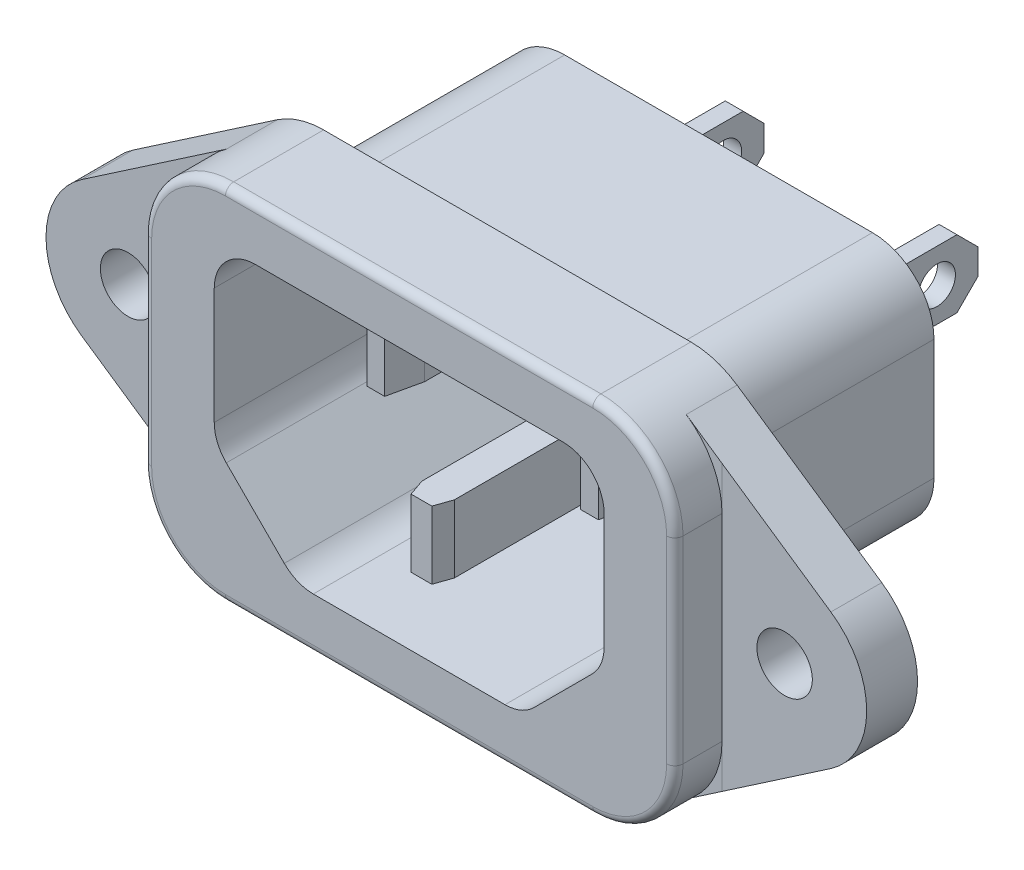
ISO-10303-21;
HEADER;
FILE_DESCRIPTION(('STEP AP214'),'2;1');
FILE_NAME('part.step','',(''),(''),'','','');
FILE_SCHEMA(('AUTOMOTIVE_DESIGN { 1 0 10303 214 1 1 1 1 }'));
ENDSEC;
DATA;
#1=APPLICATION_CONTEXT('core data for automotive mechanical design processes');
#2=APPLICATION_PROTOCOL_DEFINITION('international standard','automotive_design',2000,#1);
#3=PRODUCT_CONTEXT('',#1,'mechanical');
#4=PRODUCT('Part','Part','',(#3));
#5=PRODUCT_RELATED_PRODUCT_CATEGORY('part','',(#4));
#6=PRODUCT_DEFINITION_FORMATION('','',#4);
#7=PRODUCT_DEFINITION_CONTEXT('part definition',#1,'design');
#8=PRODUCT_DEFINITION('design','',#6,#7);
#9=PRODUCT_DEFINITION_SHAPE('','',#8);
#10=(LENGTH_UNIT() NAMED_UNIT(*) SI_UNIT(.MILLI.,.METRE.));
#11=(NAMED_UNIT(*) PLANE_ANGLE_UNIT() SI_UNIT($,.RADIAN.));
#12=(NAMED_UNIT(*) SI_UNIT($,.STERADIAN.) SOLID_ANGLE_UNIT());
#13=UNCERTAINTY_MEASURE_WITH_UNIT(LENGTH_MEASURE(1.E-05),#10,'distance_accuracy_value','');
#14=(GEOMETRIC_REPRESENTATION_CONTEXT(3) GLOBAL_UNCERTAINTY_ASSIGNED_CONTEXT((#13)) GLOBAL_UNIT_ASSIGNED_CONTEXT((#10,
#11,#12)) REPRESENTATION_CONTEXT('',''));
#15=CARTESIAN_POINT('',(0.,0.,0.));
#16=DIRECTION('',(0.,0.,1.));
#17=DIRECTION('',(1.,0.,0.));
#18=AXIS2_PLACEMENT_3D('',#15,#16,#17);
#19=CARTESIAN_POINT('',(-9.525,5.7785,-13.081));
#20=DIRECTION('',(0.,0.,-1.));
#21=DIRECTION('',(-1.,0.,0.));
#22=AXIS2_PLACEMENT_3D('',#19,#20,#21);
#23=PLANE('',#22);
#24=DIRECTION('',(0.,1.,0.));
#25=VECTOR('',#24,1.);
#26=CARTESIAN_POINT('',(-4.5974,-0.698499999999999,-13.081));
#27=LINE('',#26,#25);
#28=CARTESIAN_POINT('',(-4.5974,-0.698499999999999,-13.081));
#29=VERTEX_POINT('',#28);
#30=CARTESIAN_POINT('',(-4.5974,5.5245,-13.081));
#31=VERTEX_POINT('',#30);
#32=EDGE_CURVE('E1444',#29,#31,#27,.T.);
#33=ORIENTED_EDGE('',*,*,#32,.T.);
#34=DIRECTION('',(1.,0.,0.));
#35=VECTOR('',#34,1.);
#36=CARTESIAN_POINT('',(-8.636,5.5245,-13.081));
#37=LINE('',#36,#35);
#38=CARTESIAN_POINT('',(-8.636,5.5245,-13.081));
#39=VERTEX_POINT('',#38);
#40=EDGE_CURVE('E1450',#39,#31,#37,.T.);
#41=ORIENTED_EDGE('',*,*,#40,.F.);
#42=DIRECTION('',(0.,-1.,0.));
#43=VECTOR('',#42,1.);
#44=CARTESIAN_POINT('',(-8.636,5.5245,-13.081));
#45=LINE('',#44,#43);
#46=CARTESIAN_POINT('',(-8.636,-0.698499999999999,-13.081));
#47=VERTEX_POINT('',#46);
#48=EDGE_CURVE('E52',#39,#47,#45,.T.);
#49=ORIENTED_EDGE('',*,*,#48,.T.);
#50=DIRECTION('',(-1.,0.,0.));
#51=VECTOR('',#50,1.);
#52=CARTESIAN_POINT('',(-4.5974,-0.698499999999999,-13.081));
#53=LINE('',#52,#51);
#54=EDGE_CURVE('E1913',#29,#47,#53,.T.);
#55=ORIENTED_EDGE('',*,*,#54,.F.);
#56=EDGE_LOOP('',(#33,#41,#49,#55));
#57=FACE_BOUND('',#56,.T.);
#58=DIRECTION('',(1.,0.,0.));
#59=VECTOR('',#58,1.);
#60=CARTESIAN_POINT('',(4.5974,-0.698499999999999,-13.081));
#61=LINE('',#60,#59);
#62=CARTESIAN_POINT('',(4.5974,-0.698499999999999,-13.081));
#63=VERTEX_POINT('',#62);
#64=CARTESIAN_POINT('',(8.636,-0.698499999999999,-13.081));
#65=VERTEX_POINT('',#64);
#66=EDGE_CURVE('E1931',#63,#65,#61,.T.);
#67=ORIENTED_EDGE('',*,*,#66,.T.);
#68=DIRECTION('',(0.,-1.,0.));
#69=VECTOR('',#68,1.);
#70=CARTESIAN_POINT('',(8.636,5.5245,-13.081));
#71=LINE('',#70,#69);
#72=CARTESIAN_POINT('',(8.636,5.5245,-13.081));
#73=VERTEX_POINT('',#72);
#74=EDGE_CURVE('E3525',#73,#65,#71,.T.);
#75=ORIENTED_EDGE('',*,*,#74,.F.);
#76=DIRECTION('',(-1.,0.,0.));
#77=VECTOR('',#76,1.);
#78=CARTESIAN_POINT('',(8.636,5.5245,-13.081));
#79=LINE('',#78,#77);
#80=CARTESIAN_POINT('',(4.5974,5.5245,-13.081));
#81=VERTEX_POINT('',#80);
#82=EDGE_CURVE('E3521',#73,#81,#79,.T.);
#83=ORIENTED_EDGE('',*,*,#82,.T.);
#84=DIRECTION('',(0.,1.,0.));
#85=VECTOR('',#84,1.);
#86=CARTESIAN_POINT('',(4.5974,-0.698499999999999,-13.081));
#87=LINE('',#86,#85);
#88=EDGE_CURVE('E1812',#63,#81,#87,.T.);
#89=ORIENTED_EDGE('',*,*,#88,.F.);
#90=EDGE_LOOP('',(#67,#75,#83,#89));
#91=FACE_BOUND('',#90,.T.);
#92=CARTESIAN_POINT('',(-9.525,5.7785,-13.081));
#93=DIRECTION('',(0.,0.,-1.));
#94=DIRECTION('',(-1.,0.,0.));
#95=AXIS2_PLACEMENT_3D('',#92,#93,#94);
#96=CIRCLE('',#95,3.81);
#97=CARTESIAN_POINT('',(-13.335,5.77849999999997,-13.081));
#98=VERTEX_POINT('',#97);
#99=CARTESIAN_POINT('',(-9.52499999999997,9.5885,-13.081));
#100=VERTEX_POINT('',#99);
#101=EDGE_CURVE('E1374',#98,#100,#96,.T.);
#102=ORIENTED_EDGE('',*,*,#101,.T.);
#103=DIRECTION('',(1.,0.,0.));
#104=VECTOR('',#103,1.);
#105=CARTESIAN_POINT('',(-9.52499999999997,9.5885,-13.081));
#106=LINE('',#105,#104);
#107=CARTESIAN_POINT('',(9.52499999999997,9.5885,-13.081));
#108=VERTEX_POINT('',#107);
#109=EDGE_CURVE('E3334',#100,#108,#106,.T.);
#110=ORIENTED_EDGE('',*,*,#109,.T.);
#111=CARTESIAN_POINT('',(9.525,5.7785,-13.081));
#112=DIRECTION('',(0.,0.,1.));
#113=DIRECTION('',(1.,0.,0.));
#114=AXIS2_PLACEMENT_3D('',#111,#112,#113);
#115=CIRCLE('',#114,3.81);
#116=CARTESIAN_POINT('',(13.335,5.77849999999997,-13.081));
#117=VERTEX_POINT('',#116);
#118=EDGE_CURVE('E3512',#117,#108,#115,.T.);
#119=ORIENTED_EDGE('',*,*,#118,.F.);
#120=DIRECTION('',(0.,1.,0.));
#121=VECTOR('',#120,1.);
#122=CARTESIAN_POINT('',(13.335,-1.66034632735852,-13.081));
#123=LINE('',#122,#121);
#124=CARTESIAN_POINT('',(13.335,-1.66034632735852,-13.081));
#125=VERTEX_POINT('',#124);
#126=EDGE_CURVE('E3508',#125,#117,#123,.T.);
#127=ORIENTED_EDGE('',*,*,#126,.F.);
#128=CARTESIAN_POINT('',(9.525,-1.66034632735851,-13.081));
#129=DIRECTION('',(0.,0.,-1.));
#130=DIRECTION('',(-1.,0.,0.));
#131=AXIS2_PLACEMENT_3D('',#128,#129,#130);
#132=CIRCLE('',#131,3.81);
#133=CARTESIAN_POINT('',(12.2190768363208,-4.35442316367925,-13.081));
#134=VERTEX_POINT('',#133);
#135=EDGE_CURVE('E3505',#125,#134,#132,.T.);
#136=ORIENTED_EDGE('',*,*,#135,.T.);
#137=DIRECTION('',(-0.707106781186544,-0.707106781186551,0.));
#138=VECTOR('',#137,1.);
#139=CARTESIAN_POINT('',(12.2190768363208,-4.35442316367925,-13.081));
#140=LINE('',#139,#138);
#141=CARTESIAN_POINT('',(8.10092316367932,-8.47257683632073,-13.081));
#142=VERTEX_POINT('',#141);
#143=EDGE_CURVE('E3387',#134,#142,#140,.T.);
#144=ORIENTED_EDGE('',*,*,#143,.T.);
#145=CARTESIAN_POINT('',(5.40684632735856,-5.7785,-13.081));
#146=DIRECTION('',(0.,0.,1.));
#147=DIRECTION('',(1.,0.,0.));
#148=AXIS2_PLACEMENT_3D('',#145,#146,#147);
#149=CIRCLE('',#148,3.81000000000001);
#150=CARTESIAN_POINT('',(5.40684632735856,-9.5885,-13.081));
#151=VERTEX_POINT('',#150);
#152=EDGE_CURVE('E3500',#151,#142,#149,.T.);
#153=ORIENTED_EDGE('',*,*,#152,.F.);
#154=DIRECTION('',(-1.,0.,0.));
#155=VECTOR('',#154,1.);
#156=CARTESIAN_POINT('',(5.40684632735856,-9.5885,-13.081));
#157=LINE('',#156,#155);
#158=CARTESIAN_POINT('',(-5.40684632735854,-9.5885,-13.081));
#159=VERTEX_POINT('',#158);
#160=EDGE_CURVE('E3371',#151,#159,#157,.T.);
#161=ORIENTED_EDGE('',*,*,#160,.T.);
#162=CARTESIAN_POINT('',(-5.40684632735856,-5.7785,-13.081));
#163=DIRECTION('',(0.,0.,-1.));
#164=DIRECTION('',(-1.,0.,0.));
#165=AXIS2_PLACEMENT_3D('',#162,#163,#164);
#166=CIRCLE('',#165,3.81);
#167=CARTESIAN_POINT('',(-8.10092316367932,-8.47257683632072,-13.081));
#168=VERTEX_POINT('',#167);
#169=EDGE_CURVE('E3495',#159,#168,#166,.T.);
#170=ORIENTED_EDGE('',*,*,#169,.T.);
#171=DIRECTION('',(0.707106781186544,-0.707106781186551,0.));
#172=VECTOR('',#171,1.);
#173=CARTESIAN_POINT('',(-12.2190768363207,-4.35442316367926,-13.081));
#174=LINE('',#173,#172);
#175=CARTESIAN_POINT('',(-12.2190768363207,-4.35442316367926,-13.081));
#176=VERTEX_POINT('',#175);
#177=EDGE_CURVE('E3360',#176,#168,#174,.T.);
#178=ORIENTED_EDGE('',*,*,#177,.F.);
#179=CARTESIAN_POINT('',(-9.525,-1.66034632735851,-13.081));
#180=DIRECTION('',(0.,0.,1.));
#181=DIRECTION('',(1.,0.,0.));
#182=AXIS2_PLACEMENT_3D('',#179,#180,#181);
#183=CIRCLE('',#182,3.81);
#184=CARTESIAN_POINT('',(-13.335,-1.6603463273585,-13.081));
#185=VERTEX_POINT('',#184);
#186=EDGE_CURVE('E3353',#185,#176,#183,.T.);
#187=ORIENTED_EDGE('',*,*,#186,.F.);
#188=DIRECTION('',(0.,-1.,0.));
#189=VECTOR('',#188,1.);
#190=CARTESIAN_POINT('',(-13.335,5.77849999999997,-13.081));
#191=LINE('',#190,#189);
#192=EDGE_CURVE('E3343',#98,#185,#191,.T.);
#193=ORIENTED_EDGE('',*,*,#192,.F.);
#194=EDGE_LOOP('',(#102,#110,#119,#127,#136,#144,#153,#161,#170,#178,#187,#193));
#195=FACE_BOUND('',#194,.T.);
#196=DIRECTION('',(0.,1.,0.));
#197=VECTOR('',#196,1.);
#198=CARTESIAN_POINT('',(2.0193,-5.5245,-13.081));
#199=LINE('',#198,#197);
#200=CARTESIAN_POINT('',(2.0193,-5.5245,-13.081));
#201=VERTEX_POINT('',#200);
#202=CARTESIAN_POINT('',(2.0193,0.698499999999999,-13.081));
#203=VERTEX_POINT('',#202);
#204=EDGE_CURVE('E3450',#201,#203,#199,.T.);
#205=ORIENTED_EDGE('',*,*,#204,.T.);
#206=DIRECTION('',(1.,0.,0.));
#207=VECTOR('',#206,1.);
#208=CARTESIAN_POINT('',(-2.0193,0.698499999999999,-13.081));
#209=LINE('',#208,#207);
#210=CARTESIAN_POINT('',(-2.0193,0.698499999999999,-13.081));
#211=VERTEX_POINT('',#210);
#212=EDGE_CURVE('E1839',#211,#203,#209,.T.);
#213=ORIENTED_EDGE('',*,*,#212,.F.);
#214=DIRECTION('',(0.,-1.,0.));
#215=VECTOR('',#214,1.);
#216=CARTESIAN_POINT('',(-2.0193,0.698499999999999,-13.081));
#217=LINE('',#216,#215);
#218=CARTESIAN_POINT('',(-2.0193,-5.5245,-13.081));
#219=VERTEX_POINT('',#218);
#220=EDGE_CURVE('E1693',#211,#219,#217,.T.);
#221=ORIENTED_EDGE('',*,*,#220,.T.);
#222=DIRECTION('',(-1.,0.,0.));
#223=VECTOR('',#222,1.);
#224=CARTESIAN_POINT('',(2.0193,-5.5245,-13.081));
#225=LINE('',#224,#223);
#226=EDGE_CURVE('E3461',#201,#219,#225,.T.);
#227=ORIENTED_EDGE('',*,*,#226,.F.);
#228=EDGE_LOOP('',(#205,#213,#221,#227));
#229=FACE_BOUND('',#228,.T.);
#230=ADVANCED_FACE('F20',(#57,#91,#195,#229),#23,.T.);
#231=CARTESIAN_POINT('',(-1.0033,-0.317500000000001,1.524));
#232=DIRECTION('',(1.,0.,0.));
#233=DIRECTION('',(0.,1.,0.));
#234=AXIS2_PLACEMENT_3D('',#231,#232,#233);
#235=PLANE('',#234);
#236=DIRECTION('',(0.,-1.,0.));
#237=VECTOR('',#236,1.);
#238=CARTESIAN_POINT('',(-1.0033,-0.3175,4.2728430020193));
#239=LINE('',#238,#237);
#240=CARTESIAN_POINT('',(-1.0033,-0.317500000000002,4.2728430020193));
#241=VERTEX_POINT('',#240);
#242=CARTESIAN_POINT('',(-1.0033,-4.5085,4.27284300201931));
#243=VERTEX_POINT('',#242);
#244=EDGE_CURVE('E1679',#241,#243,#239,.T.);
#245=ORIENTED_EDGE('',*,*,#244,.F.);
#246=DIRECTION('',(0.,0.,-1.));
#247=VECTOR('',#246,1.);
#248=CARTESIAN_POINT('',(-1.0033,-0.317500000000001,1.524));
#249=LINE('',#248,#247);
#250=CARTESIAN_POINT('',(-1.0033,-0.317500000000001,-10.795));
#251=VERTEX_POINT('',#250);
#252=EDGE_CURVE('E1200',#241,#251,#249,.T.);
#253=ORIENTED_EDGE('',*,*,#252,.T.);
#254=DIRECTION('',(0.,-1.,0.));
#255=VECTOR('',#254,1.);
#256=CARTESIAN_POINT('',(-1.0033,-5.3975,-10.795));
#257=LINE('',#256,#255);
#258=CARTESIAN_POINT('',(-1.0033,-4.5085,-10.795));
#259=VERTEX_POINT('',#258);
#260=EDGE_CURVE('E1152',#251,#259,#257,.T.);
#261=ORIENTED_EDGE('',*,*,#260,.T.);
#262=DIRECTION('',(0.,0.,-1.));
#263=VECTOR('',#262,1.);
#264=CARTESIAN_POINT('',(-1.0033,-4.5085,1.524));
#265=LINE('',#264,#263);
#266=EDGE_CURVE('E1167',#243,#259,#265,.T.);
#267=ORIENTED_EDGE('',*,*,#266,.F.);
#268=EDGE_LOOP('',(#245,#253,#261,#267));
#269=FACE_BOUND('',#268,.T.);
#270=ADVANCED_FACE('F2321',(#269),#235,.F.);
#271=CARTESIAN_POINT('',(1.0033,-4.5085,1.524));
#272=DIRECTION('',(0.,-1.,0.));
#273=DIRECTION('',(0.,0.,-1.));
#274=AXIS2_PLACEMENT_3D('',#271,#272,#273);
#275=PLANE('',#274);
#276=DIRECTION('',(0.327110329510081,0.,-0.94498615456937));
#277=VECTOR('',#276,1.);
#278=CARTESIAN_POINT('',(0.381,-4.5085,6.0706));
#279=LINE('',#278,#277);
#280=CARTESIAN_POINT('',(0.64476901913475,-4.5085,5.3086));
#281=VERTEX_POINT('',#280);
#282=CARTESIAN_POINT('',(1.0033,-4.5085,4.27284300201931));
#283=VERTEX_POINT('',#282);
#284=EDGE_CURVE('E2135',#281,#283,#279,.T.);
#285=ORIENTED_EDGE('',*,*,#284,.F.);
#286=DIRECTION('',(-1.,0.,0.));
#287=VECTOR('',#286,1.);
#288=CARTESIAN_POINT('',(-1.0033,-4.5085,5.3086));
#289=LINE('',#288,#287);
#290=CARTESIAN_POINT('',(-0.644769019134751,-4.5085,5.3086));
#291=VERTEX_POINT('',#290);
#292=EDGE_CURVE('E1105',#281,#291,#289,.T.);
#293=ORIENTED_EDGE('',*,*,#292,.T.);
#294=DIRECTION('',(-0.327110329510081,0.,-0.94498615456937));
#295=VECTOR('',#294,1.);
#296=CARTESIAN_POINT('',(-0.381,-4.5085,6.0706));
#297=LINE('',#296,#295);
#298=EDGE_CURVE('E2122',#291,#243,#297,.T.);
#299=ORIENTED_EDGE('',*,*,#298,.T.);
#300=ORIENTED_EDGE('',*,*,#266,.T.);
#301=DIRECTION('',(-1.,0.,0.));
#302=VECTOR('',#301,1.);
#303=CARTESIAN_POINT('',(-5.93289755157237,-4.5085,-10.795));
#304=LINE('',#303,#302);
#305=CARTESIAN_POINT('',(1.0033,-4.5085,-10.795));
#306=VERTEX_POINT('',#305);
#307=EDGE_CURVE('E1147',#306,#259,#304,.T.);
#308=ORIENTED_EDGE('',*,*,#307,.F.);
#309=DIRECTION('',(0.,0.,-1.));
#310=VECTOR('',#309,1.);
#311=CARTESIAN_POINT('',(1.0033,-4.5085,1.524));
#312=LINE('',#311,#310);
#313=EDGE_CURVE('E1172',#283,#306,#312,.T.);
#314=ORIENTED_EDGE('',*,*,#313,.F.);
#315=EDGE_LOOP('',(#285,#293,#299,#300,#308,#314));
#316=FACE_BOUND('',#315,.T.);
#317=ADVANCED_FACE('F1225',(#316),#275,.T.);
#318=CARTESIAN_POINT('',(-1.0033,-0.317500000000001,1.524));
#319=DIRECTION('',(0.,1.,0.));
#320=DIRECTION('',(0.,0.,1.));
#321=AXIS2_PLACEMENT_3D('',#318,#319,#320);
#322=PLANE('',#321);
#323=DIRECTION('',(0.327110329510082,0.,-0.944986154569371));
#324=VECTOR('',#323,1.);
#325=CARTESIAN_POINT('',(0.381,-0.317500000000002,6.0706));
#326=LINE('',#325,#324);
#327=CARTESIAN_POINT('',(0.644769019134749,-0.317500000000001,5.3086));
#328=VERTEX_POINT('',#327);
#329=CARTESIAN_POINT('',(1.0033,-0.317500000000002,4.27284300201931));
#330=VERTEX_POINT('',#329);
#331=EDGE_CURVE('E2133',#328,#330,#326,.T.);
#332=ORIENTED_EDGE('',*,*,#331,.T.);
#333=DIRECTION('',(0.,0.,-1.));
#334=VECTOR('',#333,1.);
#335=CARTESIAN_POINT('',(1.0033,-0.317500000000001,1.524));
#336=LINE('',#335,#334);
#337=CARTESIAN_POINT('',(1.0033,-0.317500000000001,-10.795));
#338=VERTEX_POINT('',#337);
#339=EDGE_CURVE('E1206',#330,#338,#336,.T.);
#340=ORIENTED_EDGE('',*,*,#339,.T.);
#341=DIRECTION('',(1.,0.,0.));
#342=VECTOR('',#341,1.);
#343=CARTESIAN_POINT('',(-5.93289755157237,-0.317500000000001,-10.795));
#344=LINE('',#343,#342);
#345=EDGE_CURVE('E1081',#251,#338,#344,.T.);
#346=ORIENTED_EDGE('',*,*,#345,.F.);
#347=ORIENTED_EDGE('',*,*,#252,.F.);
#348=DIRECTION('',(-0.327110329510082,0.,-0.944986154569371));
#349=VECTOR('',#348,1.);
#350=CARTESIAN_POINT('',(-0.381,-0.317500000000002,6.0706));
#351=LINE('',#350,#349);
#352=CARTESIAN_POINT('',(-0.64476901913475,-0.317500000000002,5.3086));
#353=VERTEX_POINT('',#352);
#354=EDGE_CURVE('E1801',#353,#241,#351,.T.);
#355=ORIENTED_EDGE('',*,*,#354,.F.);
#356=DIRECTION('',(1.,0.,0.));
#357=VECTOR('',#356,1.);
#358=CARTESIAN_POINT('',(1.0033,-0.317500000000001,5.3086));
#359=LINE('',#358,#357);
#360=EDGE_CURVE('E1098',#353,#328,#359,.T.);
#361=ORIENTED_EDGE('',*,*,#360,.T.);
#362=EDGE_LOOP('',(#332,#340,#346,#347,#355,#361));
#363=FACE_BOUND('',#362,.T.);
#364=ADVANCED_FACE('F2616',(#363),#322,.T.);
#365=CARTESIAN_POINT('',(11.3665,-6.1087,5.3086));
#366=DIRECTION('',(0.,0.,-1.));
#367=DIRECTION('',(-1.,0.,0.));
#368=AXIS2_PLACEMENT_3D('',#365,#366,#367);
#369=PLANE('',#368);
#370=ORIENTED_EDGE('',*,*,#292,.F.);
#371=DIRECTION('',(0.,1.,0.));
#372=VECTOR('',#371,1.);
#373=CARTESIAN_POINT('',(0.644769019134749,-6.1087,5.3086));
#374=LINE('',#373,#372);
#375=EDGE_CURVE('E1960',#281,#328,#374,.T.);
#376=ORIENTED_EDGE('',*,*,#375,.T.);
#377=ORIENTED_EDGE('',*,*,#360,.F.);
#378=DIRECTION('',(0.,1.,0.));
#379=VECTOR('',#378,1.);
#380=CARTESIAN_POINT('',(-0.644769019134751,-6.1087,5.3086));
#381=LINE('',#380,#379);
#382=EDGE_CURVE('E2107',#291,#353,#381,.T.);
#383=ORIENTED_EDGE('',*,*,#382,.F.);
#384=EDGE_LOOP('',(#370,#376,#377,#383));
#385=FACE_BOUND('',#384,.T.);
#386=ADVANCED_FACE('F2609',(#385),#369,.F.);
#387=CARTESIAN_POINT('',(7.62,4.5085,1.524));
#388=DIRECTION('',(0.,-1.,0.));
#389=DIRECTION('',(0.,0.,-1.));
#390=AXIS2_PLACEMENT_3D('',#387,#388,#389);
#391=PLANE('',#390);
#392=DIRECTION('',(-0.216439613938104,0.,-0.976296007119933));
#393=VECTOR('',#392,1.);
#394=CARTESIAN_POINT('',(6.13620679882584,4.5085,1.85294903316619));
#395=LINE('',#394,#393);
#396=CARTESIAN_POINT('',(6.06328055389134,4.5085,1.524));
#397=VERTEX_POINT('',#396);
#398=CARTESIAN_POINT('',(5.6134,4.5085,-0.505280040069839));
#399=VERTEX_POINT('',#398);
#400=EDGE_CURVE('E1688',#397,#399,#395,.T.);
#401=ORIENTED_EDGE('',*,*,#400,.F.);
#402=DIRECTION('',(-1.,0.,0.));
#403=VECTOR('',#402,1.);
#404=CARTESIAN_POINT('',(7.62,4.5085,1.524));
#405=LINE('',#404,#403);
#406=CARTESIAN_POINT('',(7.17011944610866,4.5085,1.524));
#407=VERTEX_POINT('',#406);
#408=EDGE_CURVE('E1128',#407,#397,#405,.T.);
#409=ORIENTED_EDGE('',*,*,#408,.F.);
#410=DIRECTION('',(0.216439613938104,0.,-0.976296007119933));
#411=VECTOR('',#410,1.);
#412=CARTESIAN_POINT('',(7.19119459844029,4.5085,1.42893613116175));
#413=LINE('',#412,#411);
#414=CARTESIAN_POINT('',(7.62,4.5085,-0.505280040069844));
#415=VERTEX_POINT('',#414);
#416=EDGE_CURVE('E1689',#407,#415,#413,.T.);
#417=ORIENTED_EDGE('',*,*,#416,.T.);
#418=DIRECTION('',(0.,0.,-1.));
#419=VECTOR('',#418,1.);
#420=CARTESIAN_POINT('',(7.62,4.5085,1.524));
#421=LINE('',#420,#419);
#422=CARTESIAN_POINT('',(7.62,4.5085,-10.795));
#423=VERTEX_POINT('',#422);
#424=EDGE_CURVE('E1137',#415,#423,#421,.T.);
#425=ORIENTED_EDGE('',*,*,#424,.T.);
#426=DIRECTION('',(-1.,0.,0.));
#427=VECTOR('',#426,1.);
#428=CARTESIAN_POINT('',(-5.93289755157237,4.5085,-10.795));
#429=LINE('',#428,#427);
#430=CARTESIAN_POINT('',(5.6134,4.5085,-10.795));
#431=VERTEX_POINT('',#430);
#432=EDGE_CURVE('E2252',#423,#431,#429,.T.);
#433=ORIENTED_EDGE('',*,*,#432,.T.);
#434=DIRECTION('',(0.,0.,-1.));
#435=VECTOR('',#434,1.);
#436=CARTESIAN_POINT('',(5.6134,4.5085,1.524));
#437=LINE('',#436,#435);
#438=EDGE_CURVE('E2244',#399,#431,#437,.T.);
#439=ORIENTED_EDGE('',*,*,#438,.F.);
#440=EDGE_LOOP('',(#401,#409,#417,#425,#433,#439));
#441=FACE_BOUND('',#440,.T.);
#442=ADVANCED_FACE('F2249',(#441),#391,.F.);
#443=CARTESIAN_POINT('',(5.6134,0.317500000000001,1.524));
#444=DIRECTION('',(-1.,0.,0.));
#445=DIRECTION('',(0.,-1.,0.));
#446=AXIS2_PLACEMENT_3D('',#443,#444,#445);
#447=PLANE('',#446);
#448=DIRECTION('',(0.,0.,-1.));
#449=VECTOR('',#448,1.);
#450=CARTESIAN_POINT('',(5.6134,0.317500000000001,1.524));
#451=LINE('',#450,#449);
#452=CARTESIAN_POINT('',(5.6134,0.317500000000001,-0.505280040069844));
#453=VERTEX_POINT('',#452);
#454=CARTESIAN_POINT('',(5.6134,0.317500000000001,-10.795));
#455=VERTEX_POINT('',#454);
#456=EDGE_CURVE('E1127',#453,#455,#451,.T.);
#457=ORIENTED_EDGE('',*,*,#456,.F.);
#458=DIRECTION('',(0.,1.,0.));
#459=VECTOR('',#458,1.);
#460=CARTESIAN_POINT('',(5.6134,0.317500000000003,-0.505280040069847));
#461=LINE('',#460,#459);
#462=EDGE_CURVE('E2187',#453,#399,#461,.T.);
#463=ORIENTED_EDGE('',*,*,#462,.T.);
#464=ORIENTED_EDGE('',*,*,#438,.T.);
#465=DIRECTION('',(0.,1.,0.));
#466=VECTOR('',#465,1.);
#467=CARTESIAN_POINT('',(5.6134,-5.3975,-10.795));
#468=LINE('',#467,#466);
#469=EDGE_CURVE('E1136',#455,#431,#468,.T.);
#470=ORIENTED_EDGE('',*,*,#469,.F.);
#471=EDGE_LOOP('',(#457,#463,#464,#470));
#472=FACE_BOUND('',#471,.T.);
#473=ADVANCED_FACE('F2242',(#472),#447,.T.);
#474=CARTESIAN_POINT('',(5.6134,0.317500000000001,1.524));
#475=DIRECTION('',(0.,1.,0.));
#476=DIRECTION('',(0.,0.,1.));
#477=AXIS2_PLACEMENT_3D('',#474,#475,#476);
#478=PLANE('',#477);
#479=DIRECTION('',(-0.216439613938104,0.,-0.976296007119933));
#480=VECTOR('',#479,1.);
#481=CARTESIAN_POINT('',(6.23262134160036,0.317500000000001,2.2878469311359));
#482=LINE('',#481,#480);
#483=CARTESIAN_POINT('',(6.06328055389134,0.317500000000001,1.524));
#484=VERTEX_POINT('',#483);
#485=EDGE_CURVE('E1111',#484,#453,#482,.T.);
#486=ORIENTED_EDGE('',*,*,#485,.T.);
#487=ORIENTED_EDGE('',*,*,#456,.T.);
#488=DIRECTION('',(1.,0.,0.));
#489=VECTOR('',#488,1.);
#490=CARTESIAN_POINT('',(-5.93289755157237,0.317500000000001,-10.795));
#491=LINE('',#490,#489);
#492=CARTESIAN_POINT('',(7.62,0.317500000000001,-10.795));
#493=VERTEX_POINT('',#492);
#494=EDGE_CURVE('E1131',#455,#493,#491,.T.);
#495=ORIENTED_EDGE('',*,*,#494,.T.);
#496=DIRECTION('',(0.,0.,-1.));
#497=VECTOR('',#496,1.);
#498=CARTESIAN_POINT('',(7.62,0.317500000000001,1.524));
#499=LINE('',#498,#497);
#500=CARTESIAN_POINT('',(7.62,0.317500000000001,-0.505280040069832));
#501=VERTEX_POINT('',#500);
#502=EDGE_CURVE('E1123',#501,#493,#499,.T.);
#503=ORIENTED_EDGE('',*,*,#502,.F.);
#504=DIRECTION('',(0.216439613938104,0.,-0.976296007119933));
#505=VECTOR('',#504,1.);
#506=CARTESIAN_POINT('',(7.00077865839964,0.317500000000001,2.2878469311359));
#507=LINE('',#506,#505);
#508=CARTESIAN_POINT('',(7.17011944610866,0.317500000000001,1.524));
#509=VERTEX_POINT('',#508);
#510=EDGE_CURVE('E1104',#509,#501,#507,.T.);
#511=ORIENTED_EDGE('',*,*,#510,.F.);
#512=DIRECTION('',(1.,0.,0.));
#513=VECTOR('',#512,1.);
#514=CARTESIAN_POINT('',(5.6134,0.317500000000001,1.524));
#515=LINE('',#514,#513);
#516=EDGE_CURVE('E2210',#484,#509,#515,.T.);
#517=ORIENTED_EDGE('',*,*,#516,.F.);
#518=EDGE_LOOP('',(#486,#487,#495,#503,#511,#517));
#519=FACE_BOUND('',#518,.T.);
#520=ADVANCED_FACE('F2259',(#519),#478,.F.);
#521=CARTESIAN_POINT('',(7.62,0.317500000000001,1.524));
#522=DIRECTION('',(0.,0.,1.));
#523=DIRECTION('',(1.,0.,0.));
#524=AXIS2_PLACEMENT_3D('',#521,#522,#523);
#525=PLANE('',#524);
#526=ORIENTED_EDGE('',*,*,#408,.T.);
#527=DIRECTION('',(0.,-1.,0.));
#528=VECTOR('',#527,1.);
#529=CARTESIAN_POINT('',(6.06328055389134,0.317500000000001,1.524));
#530=LINE('',#529,#528);
#531=EDGE_CURVE('E2204',#397,#484,#530,.T.);
#532=ORIENTED_EDGE('',*,*,#531,.T.);
#533=ORIENTED_EDGE('',*,*,#516,.T.);
#534=DIRECTION('',(0.,-1.,0.));
#535=VECTOR('',#534,1.);
#536=CARTESIAN_POINT('',(7.17011944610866,0.317500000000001,1.524));
#537=LINE('',#536,#535);
#538=EDGE_CURVE('E2201',#407,#509,#537,.T.);
#539=ORIENTED_EDGE('',*,*,#538,.F.);
#540=EDGE_LOOP('',(#526,#532,#533,#539));
#541=FACE_BOUND('',#540,.T.);
#542=ADVANCED_FACE('F2584',(#541),#525,.T.);
#543=CARTESIAN_POINT('',(-7.62,4.5085,1.524));
#544=DIRECTION('',(1.,0.,0.));
#545=DIRECTION('',(0.,1.,0.));
#546=AXIS2_PLACEMENT_3D('',#543,#544,#545);
#547=PLANE('',#546);
#548=DIRECTION('',(0.,-1.,0.));
#549=VECTOR('',#548,1.);
#550=CARTESIAN_POINT('',(-7.62,4.50849999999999,-0.505280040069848));
#551=LINE('',#550,#549);
#552=CARTESIAN_POINT('',(-7.62,4.5085,-0.505280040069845));
#553=VERTEX_POINT('',#552);
#554=CARTESIAN_POINT('',(-7.62,0.317500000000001,-0.505280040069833));
#555=VERTEX_POINT('',#554);
#556=EDGE_CURVE('E2215',#553,#555,#551,.T.);
#557=ORIENTED_EDGE('',*,*,#556,.F.);
#558=DIRECTION('',(0.,0.,-1.));
#559=VECTOR('',#558,1.);
#560=CARTESIAN_POINT('',(-7.62,4.5085,1.524));
#561=LINE('',#560,#559);
#562=CARTESIAN_POINT('',(-7.62,4.5085,-10.795));
#563=VERTEX_POINT('',#562);
#564=EDGE_CURVE('E2167',#553,#563,#561,.T.);
#565=ORIENTED_EDGE('',*,*,#564,.T.);
#566=DIRECTION('',(0.,-1.,0.));
#567=VECTOR('',#566,1.);
#568=CARTESIAN_POINT('',(-7.61999999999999,-5.3975,-10.795));
#569=LINE('',#568,#567);
#570=CARTESIAN_POINT('',(-7.62,0.317500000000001,-10.795));
#571=VERTEX_POINT('',#570);
#572=EDGE_CURVE('E1195',#563,#571,#569,.T.);
#573=ORIENTED_EDGE('',*,*,#572,.T.);
#574=DIRECTION('',(0.,0.,-1.));
#575=VECTOR('',#574,1.);
#576=CARTESIAN_POINT('',(-7.62,0.317500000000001,1.524));
#577=LINE('',#576,#575);
#578=EDGE_CURVE('E2146',#555,#571,#577,.T.);
#579=ORIENTED_EDGE('',*,*,#578,.F.);
#580=EDGE_LOOP('',(#557,#565,#573,#579));
#581=FACE_BOUND('',#580,.T.);
#582=ADVANCED_FACE('F2295',(#581),#547,.F.);
#583=CARTESIAN_POINT('',(-5.6134,0.317500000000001,1.524));
#584=DIRECTION('',(0.,-1.,0.));
#585=DIRECTION('',(0.,0.,-1.));
#586=AXIS2_PLACEMENT_3D('',#583,#584,#585);
#587=PLANE('',#586);
#588=DIRECTION('',(-1.,0.,0.));
#589=VECTOR('',#588,1.);
#590=CARTESIAN_POINT('',(-5.6134,0.317500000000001,1.524));
#591=LINE('',#590,#589);
#592=CARTESIAN_POINT('',(-6.06328055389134,0.317500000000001,1.524));
#593=VERTEX_POINT('',#592);
#594=CARTESIAN_POINT('',(-7.17011944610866,0.317500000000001,1.524));
#595=VERTEX_POINT('',#594);
#596=EDGE_CURVE('E2168',#593,#595,#591,.T.);
#597=ORIENTED_EDGE('',*,*,#596,.T.);
#598=DIRECTION('',(-0.216439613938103,0.,-0.976296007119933));
#599=VECTOR('',#598,1.);
#600=CARTESIAN_POINT('',(-7.00077865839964,0.317500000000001,2.2878469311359));
#601=LINE('',#600,#599);
#602=EDGE_CURVE('E2186',#595,#555,#601,.T.);
#603=ORIENTED_EDGE('',*,*,#602,.T.);
#604=ORIENTED_EDGE('',*,*,#578,.T.);
#605=DIRECTION('',(-1.,0.,0.));
#606=VECTOR('',#605,1.);
#607=CARTESIAN_POINT('',(-5.93289755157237,0.317500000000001,-10.795));
#608=LINE('',#607,#606);
#609=CARTESIAN_POINT('',(-5.6134,0.317500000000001,-10.795));
#610=VERTEX_POINT('',#609);
#611=EDGE_CURVE('E1201',#610,#571,#608,.T.);
#612=ORIENTED_EDGE('',*,*,#611,.F.);
#613=DIRECTION('',(0.,0.,-1.));
#614=VECTOR('',#613,1.);
#615=CARTESIAN_POINT('',(-5.6134,0.317500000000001,1.524));
#616=LINE('',#615,#614);
#617=CARTESIAN_POINT('',(-5.6134,0.317500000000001,-0.505280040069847));
#618=VERTEX_POINT('',#617);
#619=EDGE_CURVE('E2150',#618,#610,#616,.T.);
#620=ORIENTED_EDGE('',*,*,#619,.F.);
#621=DIRECTION('',(0.216439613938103,0.,-0.976296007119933));
#622=VECTOR('',#621,1.);
#623=CARTESIAN_POINT('',(-6.23262134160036,0.317500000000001,2.2878469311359));
#624=LINE('',#623,#622);
#625=EDGE_CURVE('E2181',#593,#618,#624,.T.);
#626=ORIENTED_EDGE('',*,*,#625,.F.);
#627=EDGE_LOOP('',(#597,#603,#604,#612,#620,#626));
#628=FACE_BOUND('',#627,.T.);
#629=ADVANCED_FACE('F2273',(#628),#587,.T.);
#630=CARTESIAN_POINT('',(-7.62,4.5085,1.524));
#631=DIRECTION('',(0.,1.,0.));
#632=DIRECTION('',(0.,0.,1.));
#633=AXIS2_PLACEMENT_3D('',#630,#631,#632);
#634=PLANE('',#633);
#635=ORIENTED_EDGE('',*,*,#564,.F.);
#636=DIRECTION('',(0.216439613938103,0.,0.976296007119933));
#637=VECTOR('',#636,1.);
#638=CARTESIAN_POINT('',(-7.19119459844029,4.5085,1.42893613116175));
#639=LINE('',#638,#637);
#640=CARTESIAN_POINT('',(-7.17011944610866,4.5085,1.524));
#641=VERTEX_POINT('',#640);
#642=EDGE_CURVE('E1683',#553,#641,#639,.T.);
#643=ORIENTED_EDGE('',*,*,#642,.T.);
#644=DIRECTION('',(1.,0.,0.));
#645=VECTOR('',#644,1.);
#646=CARTESIAN_POINT('',(-7.62,4.5085,1.524));
#647=LINE('',#646,#645);
#648=CARTESIAN_POINT('',(-6.06328055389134,4.5085,1.524));
#649=VERTEX_POINT('',#648);
#650=EDGE_CURVE('E2162',#641,#649,#647,.T.);
#651=ORIENTED_EDGE('',*,*,#650,.T.);
#652=DIRECTION('',(-0.216439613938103,0.,0.976296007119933));
#653=VECTOR('',#652,1.);
#654=CARTESIAN_POINT('',(-6.13620679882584,4.5085,1.85294903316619));
#655=LINE('',#654,#653);
#656=CARTESIAN_POINT('',(-5.6134,4.5085,-0.505280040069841));
#657=VERTEX_POINT('',#656);
#658=EDGE_CURVE('E1684',#657,#649,#655,.T.);
#659=ORIENTED_EDGE('',*,*,#658,.F.);
#660=DIRECTION('',(0.,0.,-1.));
#661=VECTOR('',#660,1.);
#662=CARTESIAN_POINT('',(-5.6134,4.5085,1.524));
#663=LINE('',#662,#661);
#664=CARTESIAN_POINT('',(-5.6134,4.5085,-10.795));
#665=VERTEX_POINT('',#664);
#666=EDGE_CURVE('E2172',#657,#665,#663,.T.);
#667=ORIENTED_EDGE('',*,*,#666,.T.);
#668=DIRECTION('',(1.,0.,0.));
#669=VECTOR('',#668,1.);
#670=CARTESIAN_POINT('',(-5.93289755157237,4.5085,-10.795));
#671=LINE('',#670,#669);
#672=EDGE_CURVE('E1275',#563,#665,#671,.T.);
#673=ORIENTED_EDGE('',*,*,#672,.F.);
#674=EDGE_LOOP('',(#635,#643,#651,#659,#667,#673));
#675=FACE_BOUND('',#674,.T.);
#676=ADVANCED_FACE('F2287',(#675),#634,.T.);
#677=CARTESIAN_POINT('',(-7.62,0.317500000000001,1.524));
#678=DIRECTION('',(0.,0.,-1.));
#679=DIRECTION('',(-1.,0.,0.));
#680=AXIS2_PLACEMENT_3D('',#677,#678,#679);
#681=PLANE('',#680);
#682=DIRECTION('',(0.,1.,0.));
#683=VECTOR('',#682,1.);
#684=CARTESIAN_POINT('',(-7.17011944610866,0.317500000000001,1.524));
#685=LINE('',#684,#683);
#686=EDGE_CURVE('E2197',#595,#641,#685,.T.);
#687=ORIENTED_EDGE('',*,*,#686,.F.);
#688=ORIENTED_EDGE('',*,*,#596,.F.);
#689=DIRECTION('',(0.,1.,0.));
#690=VECTOR('',#689,1.);
#691=CARTESIAN_POINT('',(-6.06328055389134,0.317500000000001,1.524));
#692=LINE('',#691,#690);
#693=EDGE_CURVE('E1157',#593,#649,#692,.T.);
#694=ORIENTED_EDGE('',*,*,#693,.T.);
#695=ORIENTED_EDGE('',*,*,#650,.F.);
#696=EDGE_LOOP('',(#687,#688,#694,#695));
#697=FACE_BOUND('',#696,.T.);
#698=ADVANCED_FACE('F2279',(#697),#681,.F.);
#699=CARTESIAN_POINT('',(-5.93289755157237,-5.3975,-10.795));
#700=DIRECTION('',(0.,0.,-1.));
#701=DIRECTION('',(-1.,0.,0.));
#702=AXIS2_PLACEMENT_3D('',#699,#700,#701);
#703=PLANE('',#702);
#704=ORIENTED_EDGE('',*,*,#432,.F.);
#705=DIRECTION('',(0.,-1.,0.));
#706=VECTOR('',#705,1.);
#707=CARTESIAN_POINT('',(7.61999999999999,-5.39750000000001,-10.795));
#708=LINE('',#707,#706);
#709=EDGE_CURVE('E1236',#423,#493,#708,.T.);
#710=ORIENTED_EDGE('',*,*,#709,.T.);
#711=ORIENTED_EDGE('',*,*,#494,.F.);
#712=ORIENTED_EDGE('',*,*,#469,.T.);
#713=EDGE_LOOP('',(#704,#710,#711,#712));
#714=FACE_BOUND('',#713,.T.);
#715=ORIENTED_EDGE('',*,*,#260,.F.);
#716=ORIENTED_EDGE('',*,*,#345,.T.);
#717=DIRECTION('',(0.,1.,0.));
#718=VECTOR('',#717,1.);
#719=CARTESIAN_POINT('',(1.0033,-5.3975,-10.795));
#720=LINE('',#719,#718);
#721=EDGE_CURVE('E1086',#306,#338,#720,.T.);
#722=ORIENTED_EDGE('',*,*,#721,.F.);
#723=ORIENTED_EDGE('',*,*,#307,.T.);
#724=EDGE_LOOP('',(#715,#716,#722,#723));
#725=FACE_BOUND('',#724,.T.);
#726=CARTESIAN_POINT('',(-5.93289755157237,-5.3975,-10.795));
#727=DIRECTION('',(0.,0.,-1.));
#728=DIRECTION('',(-1.,0.,0.));
#729=AXIS2_PLACEMENT_3D('',#726,#727,#728);
#730=CIRCLE('',#729,2.54);
#731=CARTESIAN_POINT('',(-5.93289755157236,-7.9375,-10.795));
#732=VERTEX_POINT('',#731);
#733=CARTESIAN_POINT('',(-7.72894877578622,-7.19355122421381,-10.795));
#734=VERTEX_POINT('',#733);
#735=EDGE_CURVE('E1174',#732,#734,#730,.T.);
#736=ORIENTED_EDGE('',*,*,#735,.F.);
#737=DIRECTION('',(-1.,0.,0.));
#738=VECTOR('',#737,1.);
#739=CARTESIAN_POINT('',(5.93289755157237,-7.9375,-10.795));
#740=LINE('',#739,#738);
#741=CARTESIAN_POINT('',(5.93289755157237,-7.9375,-10.795));
#742=VERTEX_POINT('',#741);
#743=EDGE_CURVE('E1239',#742,#732,#740,.T.);
#744=ORIENTED_EDGE('',*,*,#743,.F.);
#745=CARTESIAN_POINT('',(5.93289755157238,-5.3975,-10.795));
#746=DIRECTION('',(0.,0.,1.));
#747=DIRECTION('',(1.,0.,0.));
#748=AXIS2_PLACEMENT_3D('',#745,#746,#747);
#749=CIRCLE('',#748,2.54);
#750=CARTESIAN_POINT('',(7.72894877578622,-7.19355122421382,-10.795));
#751=VERTEX_POINT('',#750);
#752=EDGE_CURVE('E1242',#742,#751,#749,.T.);
#753=ORIENTED_EDGE('',*,*,#752,.T.);
#754=DIRECTION('',(-0.707106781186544,-0.707106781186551,0.));
#755=VECTOR('',#754,1.);
#756=CARTESIAN_POINT('',(11.3210512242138,-3.60144877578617,-10.795));
#757=LINE('',#756,#755);
#758=CARTESIAN_POINT('',(11.3210512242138,-3.60144877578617,-10.795));
#759=VERTEX_POINT('',#758);
#760=EDGE_CURVE('E1246',#759,#751,#757,.T.);
#761=ORIENTED_EDGE('',*,*,#760,.F.);
#762=CARTESIAN_POINT('',(9.525,-1.80539755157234,-10.795));
#763=DIRECTION('',(0.,0.,-1.));
#764=DIRECTION('',(-1.,0.,0.));
#765=AXIS2_PLACEMENT_3D('',#762,#763,#764);
#766=CIRCLE('',#765,2.54);
#767=CARTESIAN_POINT('',(12.065,-1.80539755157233,-10.795));
#768=VERTEX_POINT('',#767);
#769=EDGE_CURVE('E1249',#768,#759,#766,.T.);
#770=ORIENTED_EDGE('',*,*,#769,.F.);
#771=DIRECTION('',(0.,1.,0.));
#772=VECTOR('',#771,1.);
#773=CARTESIAN_POINT('',(12.065,-1.80539755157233,-10.795));
#774=LINE('',#773,#772);
#775=CARTESIAN_POINT('',(12.065,5.39749999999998,-10.795));
#776=VERTEX_POINT('',#775);
#777=EDGE_CURVE('E1252',#768,#776,#774,.T.);
#778=ORIENTED_EDGE('',*,*,#777,.T.);
#779=CARTESIAN_POINT('',(9.525,5.3975,-10.795));
#780=DIRECTION('',(0.,0.,1.));
#781=DIRECTION('',(1.,0.,0.));
#782=AXIS2_PLACEMENT_3D('',#779,#780,#781);
#783=CIRCLE('',#782,2.54);
#784=CARTESIAN_POINT('',(9.52499999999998,7.9375,-10.795));
#785=VERTEX_POINT('',#784);
#786=EDGE_CURVE('E1256',#776,#785,#783,.T.);
#787=ORIENTED_EDGE('',*,*,#786,.T.);
#788=DIRECTION('',(1.,0.,0.));
#789=VECTOR('',#788,1.);
#790=CARTESIAN_POINT('',(-9.52499999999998,7.9375,-10.795));
#791=LINE('',#790,#789);
#792=CARTESIAN_POINT('',(-9.52499999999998,7.9375,-10.795));
#793=VERTEX_POINT('',#792);
#794=EDGE_CURVE('E1260',#793,#785,#791,.T.);
#795=ORIENTED_EDGE('',*,*,#794,.F.);
#796=CARTESIAN_POINT('',(-9.525,5.3975,-10.795));
#797=DIRECTION('',(0.,0.,-1.));
#798=DIRECTION('',(-1.,0.,0.));
#799=AXIS2_PLACEMENT_3D('',#796,#797,#798);
#800=CIRCLE('',#799,2.54);
#801=CARTESIAN_POINT('',(-12.065,5.39749999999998,-10.795));
#802=VERTEX_POINT('',#801);
#803=EDGE_CURVE('E1263',#802,#793,#800,.T.);
#804=ORIENTED_EDGE('',*,*,#803,.F.);
#805=DIRECTION('',(0.,-1.,0.));
#806=VECTOR('',#805,1.);
#807=CARTESIAN_POINT('',(-12.065,5.39749999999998,-10.795));
#808=LINE('',#807,#806);
#809=CARTESIAN_POINT('',(-12.065,-1.80539755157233,-10.795));
#810=VERTEX_POINT('',#809);
#811=EDGE_CURVE('E1266',#802,#810,#808,.T.);
#812=ORIENTED_EDGE('',*,*,#811,.T.);
#813=CARTESIAN_POINT('',(-9.525,-1.80539755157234,-10.795));
#814=DIRECTION('',(0.,0.,1.));
#815=DIRECTION('',(1.,0.,0.));
#816=AXIS2_PLACEMENT_3D('',#813,#814,#815);
#817=CIRCLE('',#816,2.54);
#818=CARTESIAN_POINT('',(-11.3210512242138,-3.60144877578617,-10.795));
#819=VERTEX_POINT('',#818);
#820=EDGE_CURVE('E1184',#810,#819,#817,.T.);
#821=ORIENTED_EDGE('',*,*,#820,.T.);
#822=DIRECTION('',(0.707106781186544,-0.707106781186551,0.));
#823=VECTOR('',#822,1.);
#824=CARTESIAN_POINT('',(-11.3210512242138,-3.60144877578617,-10.795));
#825=LINE('',#824,#823);
#826=EDGE_CURVE('E1178',#819,#734,#825,.T.);
#827=ORIENTED_EDGE('',*,*,#826,.T.);
#828=EDGE_LOOP('',(#736,#744,#753,#761,#770,#778,#787,#795,#804,#812,#821,#827));
#829=FACE_BOUND('',#828,.T.);
#830=ORIENTED_EDGE('',*,*,#572,.F.);
#831=ORIENTED_EDGE('',*,*,#672,.T.);
#832=DIRECTION('',(0.,1.,0.));
#833=VECTOR('',#832,1.);
#834=CARTESIAN_POINT('',(-5.6134,-5.3975,-10.795));
#835=LINE('',#834,#833);
#836=EDGE_CURVE('E1272',#610,#665,#835,.T.);
#837=ORIENTED_EDGE('',*,*,#836,.F.);
#838=ORIENTED_EDGE('',*,*,#611,.T.);
#839=EDGE_LOOP('',(#830,#831,#837,#838));
#840=FACE_BOUND('',#839,.T.);
#841=ADVANCED_FACE('F1230',(#714,#725,#829,#840),#703,.F.);
#842=CARTESIAN_POINT('',(11.3665,-6.1087,6.0706));
#843=DIRECTION('',(0.,0.,-1.));
#844=DIRECTION('',(-1.,0.,0.));
#845=AXIS2_PLACEMENT_3D('',#842,#843,#844);
#846=PLANE('',#845);
#847=DIRECTION('',(0.,-1.,0.));
#848=VECTOR('',#847,1.);
#849=CARTESIAN_POINT('',(-15.9385,-6.1087,6.0706));
#850=LINE('',#849,#848);
#851=CARTESIAN_POINT('',(-15.9385,6.10869999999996,6.0706));
#852=VERTEX_POINT('',#851);
#853=CARTESIAN_POINT('',(-15.9385,-6.10869999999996,6.0706));
#854=VERTEX_POINT('',#853);
#855=EDGE_CURVE('E1276',#852,#854,#850,.T.);
#856=ORIENTED_EDGE('',*,*,#855,.T.);
#857=CARTESIAN_POINT('',(-11.3665,-6.1087,6.0706));
#858=DIRECTION('',(0.,0.,-1.));
#859=DIRECTION('',(-1.,0.,0.));
#860=AXIS2_PLACEMENT_3D('',#857,#858,#859);
#861=CIRCLE('',#860,4.572);
#862=CARTESIAN_POINT('',(-11.3665,-10.6807,6.0706));
#863=VERTEX_POINT('',#862);
#864=EDGE_CURVE('E1281',#854,#863,#861,.F.);
#865=ORIENTED_EDGE('',*,*,#864,.T.);
#866=DIRECTION('',(-1.,0.,0.));
#867=VECTOR('',#866,1.);
#868=CARTESIAN_POINT('',(11.3665,-10.6807,6.0706));
#869=LINE('',#868,#867);
#870=CARTESIAN_POINT('',(11.3665,-10.6807,6.0706));
#871=VERTEX_POINT('',#870);
#872=EDGE_CURVE('E1278',#863,#871,#869,.F.);
#873=ORIENTED_EDGE('',*,*,#872,.T.);
#874=CARTESIAN_POINT('',(11.3665,-6.1087,6.0706));
#875=DIRECTION('',(0.,0.,-1.));
#876=DIRECTION('',(-1.,0.,0.));
#877=AXIS2_PLACEMENT_3D('',#874,#875,#876);
#878=CIRCLE('',#877,4.572);
#879=CARTESIAN_POINT('',(15.9385,-6.10869999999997,6.0706));
#880=VERTEX_POINT('',#879);
#881=EDGE_CURVE('E1279',#871,#880,#878,.F.);
#882=ORIENTED_EDGE('',*,*,#881,.T.);
#883=DIRECTION('',(0.,1.,0.));
#884=VECTOR('',#883,1.);
#885=CARTESIAN_POINT('',(15.9385,-6.1087,6.0706));
#886=LINE('',#885,#884);
#887=CARTESIAN_POINT('',(15.9385,6.10869999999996,6.0706));
#888=VERTEX_POINT('',#887);
#889=EDGE_CURVE('E1291',#880,#888,#886,.T.);
#890=ORIENTED_EDGE('',*,*,#889,.T.);
#891=CARTESIAN_POINT('',(11.3665,6.1087,6.0706));
#892=DIRECTION('',(0.,0.,-1.));
#893=DIRECTION('',(-1.,0.,0.));
#894=AXIS2_PLACEMENT_3D('',#891,#892,#893);
#895=CIRCLE('',#894,4.572);
#896=CARTESIAN_POINT('',(11.3665,10.6807,6.0706));
#897=VERTEX_POINT('',#896);
#898=EDGE_CURVE('E1295',#888,#897,#895,.F.);
#899=ORIENTED_EDGE('',*,*,#898,.T.);
#900=DIRECTION('',(1.,0.,0.));
#901=VECTOR('',#900,1.);
#902=CARTESIAN_POINT('',(-11.3665,10.6807,6.0706));
#903=LINE('',#902,#901);
#904=CARTESIAN_POINT('',(-11.3665,10.6807,6.0706));
#905=VERTEX_POINT('',#904);
#906=EDGE_CURVE('E1293',#897,#905,#903,.F.);
#907=ORIENTED_EDGE('',*,*,#906,.T.);
#908=CARTESIAN_POINT('',(-11.3665,6.1087,6.0706));
#909=DIRECTION('',(0.,0.,-1.));
#910=DIRECTION('',(-1.,0.,0.));
#911=AXIS2_PLACEMENT_3D('',#908,#909,#910);
#912=CIRCLE('',#911,4.572);
#913=EDGE_CURVE('E1289',#905,#852,#912,.F.);
#914=ORIENTED_EDGE('',*,*,#913,.T.);
#915=EDGE_LOOP('',(#856,#865,#873,#882,#890,#899,#907,#914));
#916=FACE_BOUND('',#915,.T.);
#917=CARTESIAN_POINT('',(-5.93289755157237,-5.3975,6.0706));
#918=DIRECTION('',(0.,0.,-1.));
#919=DIRECTION('',(-1.,0.,0.));
#920=AXIS2_PLACEMENT_3D('',#917,#918,#919);
#921=CIRCLE('',#920,2.54);
#922=CARTESIAN_POINT('',(-5.93289755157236,-7.9375,6.0706));
#923=VERTEX_POINT('',#922);
#924=CARTESIAN_POINT('',(-7.72894877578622,-7.19355122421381,6.0706));
#925=VERTEX_POINT('',#924);
#926=EDGE_CURVE('E1171',#923,#925,#921,.T.);
#927=ORIENTED_EDGE('',*,*,#926,.T.);
#928=DIRECTION('',(0.707106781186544,-0.707106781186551,0.));
#929=VECTOR('',#928,1.);
#930=CARTESIAN_POINT('',(-11.3210512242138,-3.60144877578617,6.0706));
#931=LINE('',#930,#929);
#932=CARTESIAN_POINT('',(-11.3210512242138,-3.60144877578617,6.0706));
#933=VERTEX_POINT('',#932);
#934=EDGE_CURVE('E1305',#933,#925,#931,.T.);
#935=ORIENTED_EDGE('',*,*,#934,.F.);
#936=CARTESIAN_POINT('',(-9.525,-1.80539755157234,6.0706));
#937=DIRECTION('',(0.,0.,1.));
#938=DIRECTION('',(1.,0.,0.));
#939=AXIS2_PLACEMENT_3D('',#936,#937,#938);
#940=CIRCLE('',#939,2.54);
#941=CARTESIAN_POINT('',(-12.065,-1.80539755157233,6.0706));
#942=VERTEX_POINT('',#941);
#943=EDGE_CURVE('E1309',#942,#933,#940,.T.);
#944=ORIENTED_EDGE('',*,*,#943,.F.);
#945=DIRECTION('',(0.,-1.,0.));
#946=VECTOR('',#945,1.);
#947=CARTESIAN_POINT('',(-12.065,5.39749999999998,6.0706));
#948=LINE('',#947,#946);
#949=CARTESIAN_POINT('',(-12.065,5.39749999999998,6.0706));
#950=VERTEX_POINT('',#949);
#951=EDGE_CURVE('E1313',#950,#942,#948,.T.);
#952=ORIENTED_EDGE('',*,*,#951,.F.);
#953=CARTESIAN_POINT('',(-9.525,5.3975,6.0706));
#954=DIRECTION('',(0.,0.,-1.));
#955=DIRECTION('',(-1.,0.,0.));
#956=AXIS2_PLACEMENT_3D('',#953,#954,#955);
#957=CIRCLE('',#956,2.54);
#958=CARTESIAN_POINT('',(-9.52499999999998,7.9375,6.0706));
#959=VERTEX_POINT('',#958);
#960=EDGE_CURVE('E1317',#950,#959,#957,.T.);
#961=ORIENTED_EDGE('',*,*,#960,.T.);
#962=DIRECTION('',(1.,0.,0.));
#963=VECTOR('',#962,1.);
#964=CARTESIAN_POINT('',(-9.52499999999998,7.9375,6.0706));
#965=LINE('',#964,#963);
#966=CARTESIAN_POINT('',(9.52499999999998,7.9375,6.0706));
#967=VERTEX_POINT('',#966);
#968=EDGE_CURVE('E1321',#959,#967,#965,.T.);
#969=ORIENTED_EDGE('',*,*,#968,.T.);
#970=CARTESIAN_POINT('',(9.525,5.3975,6.0706));
#971=DIRECTION('',(0.,0.,1.));
#972=DIRECTION('',(1.,0.,0.));
#973=AXIS2_PLACEMENT_3D('',#970,#971,#972);
#974=CIRCLE('',#973,2.54);
#975=CARTESIAN_POINT('',(12.065,5.39749999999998,6.0706));
#976=VERTEX_POINT('',#975);
#977=EDGE_CURVE('E1325',#976,#967,#974,.T.);
#978=ORIENTED_EDGE('',*,*,#977,.F.);
#979=DIRECTION('',(0.,1.,0.));
#980=VECTOR('',#979,1.);
#981=CARTESIAN_POINT('',(12.065,-1.80539755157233,6.0706));
#982=LINE('',#981,#980);
#983=CARTESIAN_POINT('',(12.065,-1.80539755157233,6.0706));
#984=VERTEX_POINT('',#983);
#985=EDGE_CURVE('E1329',#984,#976,#982,.T.);
#986=ORIENTED_EDGE('',*,*,#985,.F.);
#987=CARTESIAN_POINT('',(9.525,-1.80539755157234,6.0706));
#988=DIRECTION('',(0.,0.,-1.));
#989=DIRECTION('',(-1.,0.,0.));
#990=AXIS2_PLACEMENT_3D('',#987,#988,#989);
#991=CIRCLE('',#990,2.54);
#992=CARTESIAN_POINT('',(11.3210512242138,-3.60144877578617,6.0706));
#993=VERTEX_POINT('',#992);
#994=EDGE_CURVE('E1333',#984,#993,#991,.T.);
#995=ORIENTED_EDGE('',*,*,#994,.T.);
#996=DIRECTION('',(-0.707106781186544,-0.707106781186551,0.));
#997=VECTOR('',#996,1.);
#998=CARTESIAN_POINT('',(11.3210512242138,-3.60144877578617,6.0706));
#999=LINE('',#998,#997);
#1000=CARTESIAN_POINT('',(7.72894877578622,-7.19355122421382,6.0706));
#1001=VERTEX_POINT('',#1000);
#1002=EDGE_CURVE('E1337',#993,#1001,#999,.T.);
#1003=ORIENTED_EDGE('',*,*,#1002,.T.);
#1004=CARTESIAN_POINT('',(5.93289755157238,-5.3975,6.0706));
#1005=DIRECTION('',(0.,0.,1.));
#1006=DIRECTION('',(1.,0.,0.));
#1007=AXIS2_PLACEMENT_3D('',#1004,#1005,#1006);
#1008=CIRCLE('',#1007,2.54);
#1009=CARTESIAN_POINT('',(5.93289755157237,-7.9375,6.0706));
#1010=VERTEX_POINT('',#1009);
#1011=EDGE_CURVE('E1341',#1010,#1001,#1008,.T.);
#1012=ORIENTED_EDGE('',*,*,#1011,.F.);
#1013=DIRECTION('',(-1.,0.,0.));
#1014=VECTOR('',#1013,1.);
#1015=CARTESIAN_POINT('',(5.93289755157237,-7.9375,6.0706));
#1016=LINE('',#1015,#1014);
#1017=EDGE_CURVE('E1179',#1010,#923,#1016,.T.);
#1018=ORIENTED_EDGE('',*,*,#1017,.T.);
#1019=EDGE_LOOP('',(#927,#935,#944,#952,#961,#969,#978,#986,#995,#1003,#1012,#1018));
#1020=FACE_BOUND('',#1019,.T.);
#1021=ADVANCED_FACE('F1503',(#916,#1020),#846,.F.);
#1022=CARTESIAN_POINT('',(11.3665,-6.1087,0.));
#1023=DIRECTION('',(0.,0.,-1.));
#1024=DIRECTION('',(-1.,0.,0.));
#1025=AXIS2_PLACEMENT_3D('',#1022,#1023,#1024);
#1026=PLANE('',#1025);
#1027=CARTESIAN_POINT('',(-20.320024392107,0.,0.));
#1028=DIRECTION('',(0.,0.,-1.));
#1029=DIRECTION('',(-1.,0.,0.));
#1030=AXIS2_PLACEMENT_3D('',#1027,#1028,#1029);
#1031=CIRCLE('',#1030,1.71449999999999);
#1032=CARTESIAN_POINT('',(-22.034524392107,0.,0.));
#1033=VERTEX_POINT('',#1032);
#1034=EDGE_CURVE('E1032',#1033,#1033,#1031,.T.);
#1035=ORIENTED_EDGE('',*,*,#1034,.F.);
#1036=EDGE_LOOP('',(#1035));
#1037=FACE_BOUND('',#1036,.T.);
#1038=CARTESIAN_POINT('',(20.320024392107,0.,0.));
#1039=DIRECTION('',(0.,0.,-1.));
#1040=DIRECTION('',(-1.,0.,0.));
#1041=AXIS2_PLACEMENT_3D('',#1038,#1039,#1040);
#1042=CIRCLE('',#1041,1.7145);
#1043=CARTESIAN_POINT('',(18.605524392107,0.,0.));
#1044=VERTEX_POINT('',#1043);
#1045=EDGE_CURVE('E835',#1044,#1044,#1042,.T.);
#1046=ORIENTED_EDGE('',*,*,#1045,.F.);
#1047=EDGE_LOOP('',(#1046));
#1048=FACE_BOUND('',#1047,.T.);
#1049=DIRECTION('',(-0.826054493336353,-0.563590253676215,0.));
#1050=VECTOR('',#1049,1.);
#1051=CARTESIAN_POINT('',(-14.2295384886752,10.3050568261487,0.));
#1052=LINE('',#1051,#1050);
#1053=CARTESIAN_POINT('',(-14.2295384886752,10.3050568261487,0.));
#1054=VERTEX_POINT('',#1053);
#1055=CARTESIAN_POINT('',(-23.1830628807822,4.19635682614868,0.));
#1056=VERTEX_POINT('',#1055);
#1057=EDGE_CURVE('E951',#1054,#1056,#1052,.T.);
#1058=ORIENTED_EDGE('',*,*,#1057,.F.);
#1059=CARTESIAN_POINT('',(-11.3665,6.1087,0.));
#1060=DIRECTION('',(0.,0.,-1.));
#1061=DIRECTION('',(-1.,0.,0.));
#1062=AXIS2_PLACEMENT_3D('',#1059,#1060,#1061);
#1063=CIRCLE('',#1062,5.08);
#1064=CARTESIAN_POINT('',(-11.3665,11.1887,0.));
#1065=VERTEX_POINT('',#1064);
#1066=EDGE_CURVE('E939',#1054,#1065,#1063,.T.);
#1067=ORIENTED_EDGE('',*,*,#1066,.T.);
#1068=DIRECTION('',(1.,0.,0.));
#1069=VECTOR('',#1068,1.);
#1070=CARTESIAN_POINT('',(-11.3665,11.1887,0.));
#1071=LINE('',#1070,#1069);
#1072=CARTESIAN_POINT('',(11.3665,11.1887,0.));
#1073=VERTEX_POINT('',#1072);
#1074=EDGE_CURVE('E944',#1065,#1073,#1071,.T.);
#1075=ORIENTED_EDGE('',*,*,#1074,.T.);
#1076=CARTESIAN_POINT('',(11.3665,6.1087,0.));
#1077=DIRECTION('',(0.,0.,1.));
#1078=DIRECTION('',(1.,0.,0.));
#1079=AXIS2_PLACEMENT_3D('',#1076,#1077,#1078);
#1080=CIRCLE('',#1079,5.08);
#1081=CARTESIAN_POINT('',(14.2295384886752,10.3050568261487,0.));
#1082=VERTEX_POINT('',#1081);
#1083=EDGE_CURVE('E1353',#1082,#1073,#1080,.T.);
#1084=ORIENTED_EDGE('',*,*,#1083,.F.);
#1085=DIRECTION('',(0.826054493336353,-0.563590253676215,0.));
#1086=VECTOR('',#1085,1.);
#1087=CARTESIAN_POINT('',(14.2295384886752,10.3050568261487,0.));
#1088=LINE('',#1087,#1086);
#1089=CARTESIAN_POINT('',(23.1830628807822,4.19635682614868,0.));
#1090=VERTEX_POINT('',#1089);
#1091=EDGE_CURVE('E911',#1082,#1090,#1088,.T.);
#1092=ORIENTED_EDGE('',*,*,#1091,.T.);
#1093=CARTESIAN_POINT('',(20.320024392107,0.,0.));
#1094=DIRECTION('',(0.,0.,-1.));
#1095=DIRECTION('',(-1.,0.,0.));
#1096=AXIS2_PLACEMENT_3D('',#1093,#1094,#1095);
#1097=CIRCLE('',#1096,5.08);
#1098=CARTESIAN_POINT('',(23.1830628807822,-4.19635682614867,0.));
#1099=VERTEX_POINT('',#1098);
#1100=EDGE_CURVE('E831',#1090,#1099,#1097,.T.);
#1101=ORIENTED_EDGE('',*,*,#1100,.T.);
#1102=DIRECTION('',(-0.826054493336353,-0.563590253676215,0.));
#1103=VECTOR('',#1102,1.);
#1104=CARTESIAN_POINT('',(23.1830628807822,-4.19635682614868,0.));
#1105=LINE('',#1104,#1103);
#1106=CARTESIAN_POINT('',(14.2295384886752,-10.3050568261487,0.));
#1107=VERTEX_POINT('',#1106);
#1108=EDGE_CURVE('E823',#1099,#1107,#1105,.T.);
#1109=ORIENTED_EDGE('',*,*,#1108,.T.);
#1110=CARTESIAN_POINT('',(11.3665,-6.1087,0.));
#1111=DIRECTION('',(0.,0.,-1.));
#1112=DIRECTION('',(-1.,0.,0.));
#1113=AXIS2_PLACEMENT_3D('',#1110,#1111,#1112);
#1114=CIRCLE('',#1113,5.08);
#1115=CARTESIAN_POINT('',(11.3665,-11.1887,0.));
#1116=VERTEX_POINT('',#1115);
#1117=EDGE_CURVE('E861',#1107,#1116,#1114,.T.);
#1118=ORIENTED_EDGE('',*,*,#1117,.T.);
#1119=DIRECTION('',(-1.,0.,0.));
#1120=VECTOR('',#1119,1.);
#1121=CARTESIAN_POINT('',(11.3665,-11.1887,0.));
#1122=LINE('',#1121,#1120);
#1123=CARTESIAN_POINT('',(-11.3665,-11.1887,0.));
#1124=VERTEX_POINT('',#1123);
#1125=EDGE_CURVE('E930',#1116,#1124,#1122,.T.);
#1126=ORIENTED_EDGE('',*,*,#1125,.T.);
#1127=CARTESIAN_POINT('',(-11.3665,-6.1087,0.));
#1128=DIRECTION('',(0.,0.,-1.));
#1129=DIRECTION('',(-1.,0.,0.));
#1130=AXIS2_PLACEMENT_3D('',#1127,#1128,#1129);
#1131=CIRCLE('',#1130,5.08);
#1132=CARTESIAN_POINT('',(-14.2295384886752,-10.3050568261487,0.));
#1133=VERTEX_POINT('',#1132);
#1134=EDGE_CURVE('E934',#1124,#1133,#1131,.T.);
#1135=ORIENTED_EDGE('',*,*,#1134,.T.);
#1136=DIRECTION('',(0.826054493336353,-0.563590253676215,0.));
#1137=VECTOR('',#1136,1.);
#1138=CARTESIAN_POINT('',(-23.1830628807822,-4.19635682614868,0.));
#1139=LINE('',#1138,#1137);
#1140=CARTESIAN_POINT('',(-23.1830628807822,-4.19635682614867,0.));
#1141=VERTEX_POINT('',#1140);
#1142=EDGE_CURVE('E964',#1141,#1133,#1139,.T.);
#1143=ORIENTED_EDGE('',*,*,#1142,.F.);
#1144=CARTESIAN_POINT('',(-20.320024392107,0.,0.));
#1145=DIRECTION('',(0.,0.,1.));
#1146=DIRECTION('',(1.,0.,0.));
#1147=AXIS2_PLACEMENT_3D('',#1144,#1145,#1146);
#1148=CIRCLE('',#1147,5.08);
#1149=EDGE_CURVE('E956',#1056,#1141,#1148,.T.);
#1150=ORIENTED_EDGE('',*,*,#1149,.F.);
#1151=EDGE_LOOP('',(#1058,#1067,#1075,#1084,#1092,#1101,#1109,#1118,#1126,#1135,#1143,#1150));
#1152=FACE_BOUND('',#1151,.T.);
#1153=DIRECTION('',(1.,0.,0.));
#1154=VECTOR('',#1153,1.);
#1155=CARTESIAN_POINT('',(-9.52499999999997,9.5885,0.));
#1156=LINE('',#1155,#1154);
#1157=CARTESIAN_POINT('',(-9.52499999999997,9.5885,0.));
#1158=VERTEX_POINT('',#1157);
#1159=CARTESIAN_POINT('',(9.52499999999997,9.5885,0.));
#1160=VERTEX_POINT('',#1159);
#1161=EDGE_CURVE('E1362',#1158,#1160,#1156,.T.);
#1162=ORIENTED_EDGE('',*,*,#1161,.F.);
#1163=CARTESIAN_POINT('',(-9.525,5.7785,0.));
#1164=DIRECTION('',(0.,0.,-1.));
#1165=DIRECTION('',(-1.,0.,0.));
#1166=AXIS2_PLACEMENT_3D('',#1163,#1164,#1165);
#1167=CIRCLE('',#1166,3.81);
#1168=CARTESIAN_POINT('',(-13.335,5.77849999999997,0.));
#1169=VERTEX_POINT('',#1168);
#1170=EDGE_CURVE('E1366',#1169,#1158,#1167,.T.);
#1171=ORIENTED_EDGE('',*,*,#1170,.F.);
#1172=DIRECTION('',(0.,-1.,0.));
#1173=VECTOR('',#1172,1.);
#1174=CARTESIAN_POINT('',(-13.335,5.77849999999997,0.));
#1175=LINE('',#1174,#1173);
#1176=CARTESIAN_POINT('',(-13.335,-1.6603463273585,0.));
#1177=VERTEX_POINT('',#1176);
#1178=EDGE_CURVE('E1372',#1169,#1177,#1175,.T.);
#1179=ORIENTED_EDGE('',*,*,#1178,.T.);
#1180=CARTESIAN_POINT('',(-9.525,-1.66034632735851,0.));
#1181=DIRECTION('',(0.,0.,1.));
#1182=DIRECTION('',(1.,0.,0.));
#1183=AXIS2_PLACEMENT_3D('',#1180,#1181,#1182);
#1184=CIRCLE('',#1183,3.81);
#1185=CARTESIAN_POINT('',(-12.2190768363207,-4.35442316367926,0.));
#1186=VERTEX_POINT('',#1185);
#1187=EDGE_CURVE('E1375',#1177,#1186,#1184,.T.);
#1188=ORIENTED_EDGE('',*,*,#1187,.T.);
#1189=DIRECTION('',(0.707106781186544,-0.707106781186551,0.));
#1190=VECTOR('',#1189,1.);
#1191=CARTESIAN_POINT('',(-12.2190768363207,-4.35442316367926,0.));
#1192=LINE('',#1191,#1190);
#1193=CARTESIAN_POINT('',(-8.10092316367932,-8.47257683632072,0.));
#1194=VERTEX_POINT('',#1193);
#1195=EDGE_CURVE('E1378',#1186,#1194,#1192,.T.);
#1196=ORIENTED_EDGE('',*,*,#1195,.T.);
#1197=CARTESIAN_POINT('',(-5.40684632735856,-5.7785,0.));
#1198=DIRECTION('',(0.,0.,-1.));
#1199=DIRECTION('',(-1.,0.,0.));
#1200=AXIS2_PLACEMENT_3D('',#1197,#1198,#1199);
#1201=CIRCLE('',#1200,3.81);
#1202=CARTESIAN_POINT('',(-5.40684632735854,-9.5885,0.));
#1203=VERTEX_POINT('',#1202);
#1204=EDGE_CURVE('E1381',#1203,#1194,#1201,.T.);
#1205=ORIENTED_EDGE('',*,*,#1204,.F.);
#1206=DIRECTION('',(-1.,0.,0.));
#1207=VECTOR('',#1206,1.);
#1208=CARTESIAN_POINT('',(5.40684632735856,-9.5885,0.));
#1209=LINE('',#1208,#1207);
#1210=CARTESIAN_POINT('',(5.40684632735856,-9.5885,0.));
#1211=VERTEX_POINT('',#1210);
#1212=EDGE_CURVE('E1385',#1211,#1203,#1209,.T.);
#1213=ORIENTED_EDGE('',*,*,#1212,.F.);
#1214=CARTESIAN_POINT('',(5.40684632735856,-5.7785,0.));
#1215=DIRECTION('',(0.,0.,1.));
#1216=DIRECTION('',(1.,0.,0.));
#1217=AXIS2_PLACEMENT_3D('',#1214,#1215,#1216);
#1218=CIRCLE('',#1217,3.81000000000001);
#1219=CARTESIAN_POINT('',(8.10092316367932,-8.47257683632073,0.));
#1220=VERTEX_POINT('',#1219);
#1221=EDGE_CURVE('E1389',#1211,#1220,#1218,.T.);
#1222=ORIENTED_EDGE('',*,*,#1221,.T.);
#1223=DIRECTION('',(-0.707106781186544,-0.707106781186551,0.));
#1224=VECTOR('',#1223,1.);
#1225=CARTESIAN_POINT('',(12.2190768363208,-4.35442316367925,0.));
#1226=LINE('',#1225,#1224);
#1227=CARTESIAN_POINT('',(12.2190768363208,-4.35442316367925,0.));
#1228=VERTEX_POINT('',#1227);
#1229=EDGE_CURVE('E1392',#1228,#1220,#1226,.T.);
#1230=ORIENTED_EDGE('',*,*,#1229,.F.);
#1231=CARTESIAN_POINT('',(9.525,-1.66034632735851,0.));
#1232=DIRECTION('',(0.,0.,-1.));
#1233=DIRECTION('',(-1.,0.,0.));
#1234=AXIS2_PLACEMENT_3D('',#1231,#1232,#1233);
#1235=CIRCLE('',#1234,3.81);
#1236=CARTESIAN_POINT('',(13.335,-1.66034632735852,0.));
#1237=VERTEX_POINT('',#1236);
#1238=EDGE_CURVE('E1396',#1237,#1228,#1235,.T.);
#1239=ORIENTED_EDGE('',*,*,#1238,.F.);
#1240=DIRECTION('',(0.,1.,0.));
#1241=VECTOR('',#1240,1.);
#1242=CARTESIAN_POINT('',(13.335,-1.66034632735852,0.));
#1243=LINE('',#1242,#1241);
#1244=CARTESIAN_POINT('',(13.335,5.77849999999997,0.));
#1245=VERTEX_POINT('',#1244);
#1246=EDGE_CURVE('E1400',#1237,#1245,#1243,.T.);
#1247=ORIENTED_EDGE('',*,*,#1246,.T.);
#1248=CARTESIAN_POINT('',(9.525,5.7785,0.));
#1249=DIRECTION('',(0.,0.,1.));
#1250=DIRECTION('',(1.,0.,0.));
#1251=AXIS2_PLACEMENT_3D('',#1248,#1249,#1250);
#1252=CIRCLE('',#1251,3.81);
#1253=EDGE_CURVE('E1365',#1245,#1160,#1252,.T.);
#1254=ORIENTED_EDGE('',*,*,#1253,.T.);
#1255=EDGE_LOOP('',(#1162,#1171,#1179,#1188,#1196,#1205,#1213,#1222,#1230,#1239,#1247,#1254));
#1256=FACE_BOUND('',#1255,.T.);
#1257=ADVANCED_FACE('F2419',(#1037,#1048,#1152,#1256),#1026,.T.);
#1258=CARTESIAN_POINT('',(-11.3665,6.1087,6.0706));
#1259=DIRECTION('',(0.,0.,-1.));
#1260=DIRECTION('',(-1.,0.,0.));
#1261=AXIS2_PLACEMENT_3D('',#1258,#1259,#1260);
#1262=CYLINDRICAL_SURFACE('',#1261,5.08);
#1263=DIRECTION('',(0.,0.,-1.));
#1264=VECTOR('',#1263,1.);
#1265=CARTESIAN_POINT('',(-16.4465,6.10869999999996,6.0706));
#1266=LINE('',#1265,#1264);
#1267=CARTESIAN_POINT('',(-16.4465,6.10869999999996,5.5626));
#1268=VERTEX_POINT('',#1267);
#1269=CARTESIAN_POINT('',(-16.4465,6.10869999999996,3.1496));
#1270=VERTEX_POINT('',#1269);
#1271=EDGE_CURVE('E997',#1268,#1270,#1266,.T.);
#1272=ORIENTED_EDGE('',*,*,#1271,.F.);
#1273=CARTESIAN_POINT('',(-11.3665,6.1087,5.5626));
#1274=DIRECTION('',(0.,0.,-1.));
#1275=DIRECTION('',(-1.,0.,0.));
#1276=AXIS2_PLACEMENT_3D('',#1273,#1274,#1275);
#1277=CIRCLE('',#1276,5.08);
#1278=CARTESIAN_POINT('',(-11.3665,11.1887,5.5626));
#1279=VERTEX_POINT('',#1278);
#1280=EDGE_CURVE('E1046',#1268,#1279,#1277,.T.);
#1281=ORIENTED_EDGE('',*,*,#1280,.T.);
#1282=DIRECTION('',(0.,0.,-1.));
#1283=VECTOR('',#1282,1.);
#1284=CARTESIAN_POINT('',(-11.3665,11.1887,6.0706));
#1285=LINE('',#1284,#1283);
#1286=EDGE_CURVE('E1001',#1279,#1065,#1285,.T.);
#1287=ORIENTED_EDGE('',*,*,#1286,.T.);
#1288=ORIENTED_EDGE('',*,*,#1066,.F.);
#1289=DIRECTION('',(0.,0.,-1.));
#1290=VECTOR('',#1289,1.);
#1291=CARTESIAN_POINT('',(-14.2295384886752,10.3050568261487,3.1496));
#1292=LINE('',#1291,#1290);
#1293=CARTESIAN_POINT('',(-14.2295384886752,10.3050568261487,3.1496));
#1294=VERTEX_POINT('',#1293);
#1295=EDGE_CURVE('E983',#1294,#1054,#1292,.T.);
#1296=ORIENTED_EDGE('',*,*,#1295,.F.);
#1297=CARTESIAN_POINT('',(-11.3665,6.1087,3.1496));
#1298=DIRECTION('',(0.,0.,1.));
#1299=DIRECTION('',(1.,0.,0.));
#1300=AXIS2_PLACEMENT_3D('',#1297,#1298,#1299);
#1301=CIRCLE('',#1300,5.08);
#1302=EDGE_CURVE('E976',#1270,#1294,#1301,.F.);
#1303=ORIENTED_EDGE('',*,*,#1302,.F.);
#1304=EDGE_LOOP('',(#1272,#1281,#1287,#1288,#1296,#1303));
#1305=FACE_BOUND('',#1304,.T.);
#1306=ADVANCED_FACE('F2422',(#1305),#1262,.T.);
#1307=CARTESIAN_POINT('',(11.3665,-6.1087,6.0706));
#1308=DIRECTION('',(0.,0.,-1.));
#1309=DIRECTION('',(-1.,0.,0.));
#1310=AXIS2_PLACEMENT_3D('',#1307,#1308,#1309);
#1311=CYLINDRICAL_SURFACE('',#1310,5.08);
#1312=DIRECTION('',(0.,0.,-1.));
#1313=VECTOR('',#1312,1.);
#1314=CARTESIAN_POINT('',(16.4465,-6.10869999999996,6.0706));
#1315=LINE('',#1314,#1313);
#1316=CARTESIAN_POINT('',(16.4465,-6.10869999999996,5.5626));
#1317=VERTEX_POINT('',#1316);
#1318=CARTESIAN_POINT('',(16.4465,-6.10869999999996,3.1496));
#1319=VERTEX_POINT('',#1318);
#1320=EDGE_CURVE('E1408',#1317,#1319,#1315,.T.);
#1321=ORIENTED_EDGE('',*,*,#1320,.F.);
#1322=CARTESIAN_POINT('',(11.3665,-6.1087,5.5626));
#1323=DIRECTION('',(0.,0.,-1.));
#1324=DIRECTION('',(-1.,0.,0.));
#1325=AXIS2_PLACEMENT_3D('',#1322,#1323,#1324);
#1326=CIRCLE('',#1325,5.08);
#1327=CARTESIAN_POINT('',(11.3665,-11.1887,5.5626));
#1328=VERTEX_POINT('',#1327);
#1329=EDGE_CURVE('E1052',#1317,#1328,#1326,.T.);
#1330=ORIENTED_EDGE('',*,*,#1329,.T.);
#1331=DIRECTION('',(0.,0.,-1.));
#1332=VECTOR('',#1331,1.);
#1333=CARTESIAN_POINT('',(11.3665,-11.1887,6.0706));
#1334=LINE('',#1333,#1332);
#1335=EDGE_CURVE('E1355',#1328,#1116,#1334,.T.);
#1336=ORIENTED_EDGE('',*,*,#1335,.T.);
#1337=ORIENTED_EDGE('',*,*,#1117,.F.);
#1338=DIRECTION('',(0.,0.,-1.));
#1339=VECTOR('',#1338,1.);
#1340=CARTESIAN_POINT('',(14.2295384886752,-10.3050568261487,3.1496));
#1341=LINE('',#1340,#1339);
#1342=CARTESIAN_POINT('',(14.2295475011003,-10.3050581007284,3.1496));
#1343=VERTEX_POINT('',#1342);
#1344=EDGE_CURVE('E860',#1343,#1107,#1341,.T.);
#1345=ORIENTED_EDGE('',*,*,#1344,.F.);
#1346=CARTESIAN_POINT('',(11.3665,-6.1087,3.1496));
#1347=DIRECTION('',(0.,0.,-1.));
#1348=DIRECTION('',(-1.,0.,0.));
#1349=AXIS2_PLACEMENT_3D('',#1346,#1347,#1348);
#1350=CIRCLE('',#1349,5.08);
#1351=EDGE_CURVE('E859',#1343,#1319,#1350,.F.);
#1352=ORIENTED_EDGE('',*,*,#1351,.T.);
#1353=EDGE_LOOP('',(#1321,#1330,#1336,#1337,#1345,#1352));
#1354=FACE_BOUND('',#1353,.T.);
#1355=ADVANCED_FACE('F2428',(#1354),#1311,.T.);
#1356=CARTESIAN_POINT('',(16.4465,-6.10869999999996,6.0706));
#1357=DIRECTION('',(-1.,0.,0.));
#1358=DIRECTION('',(0.,0.,1.));
#1359=AXIS2_PLACEMENT_3D('',#1356,#1357,#1358);
#1360=PLANE('',#1359);
#1361=DIRECTION('',(0.,0.,-1.));
#1362=VECTOR('',#1361,1.);
#1363=CARTESIAN_POINT('',(16.4465,6.10869999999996,6.0706));
#1364=LINE('',#1363,#1362);
#1365=CARTESIAN_POINT('',(16.4465,6.10869999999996,5.5626));
#1366=VERTEX_POINT('',#1365);
#1367=CARTESIAN_POINT('',(16.4465,6.1087,3.1496));
#1368=VERTEX_POINT('',#1367);
#1369=EDGE_CURVE('E1412',#1366,#1368,#1364,.T.);
#1370=ORIENTED_EDGE('',*,*,#1369,.F.);
#1371=DIRECTION('',(0.,1.,0.));
#1372=VECTOR('',#1371,1.);
#1373=CARTESIAN_POINT('',(16.4465,-6.10869999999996,5.5626));
#1374=LINE('',#1373,#1372);
#1375=EDGE_CURVE('E1051',#1366,#1317,#1374,.F.);
#1376=ORIENTED_EDGE('',*,*,#1375,.T.);
#1377=ORIENTED_EDGE('',*,*,#1320,.T.);
#1378=DIRECTION('',(0.,-1.,0.));
#1379=VECTOR('',#1378,1.);
#1380=CARTESIAN_POINT('',(16.4465,-6.10869999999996,3.1496));
#1381=LINE('',#1380,#1379);
#1382=EDGE_CURVE('E855',#1368,#1319,#1381,.T.);
#1383=ORIENTED_EDGE('',*,*,#1382,.F.);
#1384=EDGE_LOOP('',(#1370,#1376,#1377,#1383));
#1385=FACE_BOUND('',#1384,.T.);
#1386=ADVANCED_FACE('F2424',(#1385),#1360,.F.);
#1387=CARTESIAN_POINT('',(11.3665,6.1087,6.0706));
#1388=DIRECTION('',(0.,0.,-1.));
#1389=DIRECTION('',(-1.,0.,0.));
#1390=AXIS2_PLACEMENT_3D('',#1387,#1388,#1389);
#1391=CYLINDRICAL_SURFACE('',#1390,5.08);
#1392=DIRECTION('',(0.,0.,-1.));
#1393=VECTOR('',#1392,1.);
#1394=CARTESIAN_POINT('',(11.3665,11.1887,6.0706));
#1395=LINE('',#1394,#1393);
#1396=CARTESIAN_POINT('',(11.3665,11.1887,5.5626));
#1397=VERTEX_POINT('',#1396);
#1398=EDGE_CURVE('E1406',#1397,#1073,#1395,.T.);
#1399=ORIENTED_EDGE('',*,*,#1398,.F.);
#1400=CARTESIAN_POINT('',(11.3665,6.1087,5.5626));
#1401=DIRECTION('',(0.,0.,-1.));
#1402=DIRECTION('',(-1.,0.,0.));
#1403=AXIS2_PLACEMENT_3D('',#1400,#1401,#1402);
#1404=CIRCLE('',#1403,5.08);
#1405=EDGE_CURVE('E1061',#1397,#1366,#1404,.T.);
#1406=ORIENTED_EDGE('',*,*,#1405,.T.);
#1407=ORIENTED_EDGE('',*,*,#1369,.T.);
#1408=CARTESIAN_POINT('',(11.3665,6.1087,3.1496));
#1409=DIRECTION('',(0.,0.,-1.));
#1410=DIRECTION('',(-1.,0.,0.));
#1411=AXIS2_PLACEMENT_3D('',#1408,#1409,#1410);
#1412=CIRCLE('',#1411,5.08);
#1413=CARTESIAN_POINT('',(14.2295475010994,10.3050581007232,3.1496));
#1414=VERTEX_POINT('',#1413);
#1415=EDGE_CURVE('E1411',#1414,#1368,#1412,.T.);
#1416=ORIENTED_EDGE('',*,*,#1415,.F.);
#1417=DIRECTION('',(0.,0.,-1.));
#1418=VECTOR('',#1417,1.);
#1419=CARTESIAN_POINT('',(14.2295384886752,10.3050568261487,3.1496));
#1420=LINE('',#1419,#1418);
#1421=EDGE_CURVE('E853',#1414,#1082,#1420,.T.);
#1422=ORIENTED_EDGE('',*,*,#1421,.T.);
#1423=ORIENTED_EDGE('',*,*,#1083,.T.);
#1424=EDGE_LOOP('',(#1399,#1406,#1407,#1416,#1422,#1423));
#1425=FACE_BOUND('',#1424,.T.);
#1426=ADVANCED_FACE('F2427',(#1425),#1391,.T.);
#1427=CARTESIAN_POINT('',(-11.3665,11.1887,6.0706));
#1428=DIRECTION('',(0.,1.,0.));
#1429=DIRECTION('',(0.,0.,1.));
#1430=AXIS2_PLACEMENT_3D('',#1427,#1428,#1429);
#1431=PLANE('',#1430);
#1432=ORIENTED_EDGE('',*,*,#1286,.F.);
#1433=DIRECTION('',(1.,0.,0.));
#1434=VECTOR('',#1433,1.);
#1435=CARTESIAN_POINT('',(11.3665,11.1887,5.5626));
#1436=LINE('',#1435,#1434);
#1437=EDGE_CURVE('E1057',#1279,#1397,#1436,.T.);
#1438=ORIENTED_EDGE('',*,*,#1437,.T.);
#1439=ORIENTED_EDGE('',*,*,#1398,.T.);
#1440=ORIENTED_EDGE('',*,*,#1074,.F.);
#1441=EDGE_LOOP('',(#1432,#1438,#1439,#1440));
#1442=FACE_BOUND('',#1441,.T.);
#1443=ADVANCED_FACE('F2432',(#1442),#1431,.T.);
#1444=CARTESIAN_POINT('',(-16.4465,6.10869999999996,6.0706));
#1445=DIRECTION('',(1.,0.,0.));
#1446=DIRECTION('',(0.,0.,-1.));
#1447=AXIS2_PLACEMENT_3D('',#1444,#1445,#1446);
#1448=PLANE('',#1447);
#1449=DIRECTION('',(0.,0.,-1.));
#1450=VECTOR('',#1449,1.);
#1451=CARTESIAN_POINT('',(-16.4465,-6.10869999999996,6.0706));
#1452=LINE('',#1451,#1450);
#1453=CARTESIAN_POINT('',(-16.4465,-6.10869999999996,5.5626));
#1454=VERTEX_POINT('',#1453);
#1455=CARTESIAN_POINT('',(-16.4465,-6.10869999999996,3.1496));
#1456=VERTEX_POINT('',#1455);
#1457=EDGE_CURVE('E1002',#1454,#1456,#1452,.T.);
#1458=ORIENTED_EDGE('',*,*,#1457,.F.);
#1459=DIRECTION('',(0.,-1.,0.));
#1460=VECTOR('',#1459,1.);
#1461=CARTESIAN_POINT('',(-16.4465,6.10869999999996,5.5626));
#1462=LINE('',#1461,#1460);
#1463=EDGE_CURVE('E1415',#1454,#1268,#1462,.F.);
#1464=ORIENTED_EDGE('',*,*,#1463,.T.);
#1465=ORIENTED_EDGE('',*,*,#1271,.T.);
#1466=DIRECTION('',(0.,-1.,0.));
#1467=VECTOR('',#1466,1.);
#1468=CARTESIAN_POINT('',(-16.4465,6.10869999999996,3.1496));
#1469=LINE('',#1468,#1467);
#1470=EDGE_CURVE('E978',#1270,#1456,#1469,.T.);
#1471=ORIENTED_EDGE('',*,*,#1470,.T.);
#1472=EDGE_LOOP('',(#1458,#1464,#1465,#1471));
#1473=FACE_BOUND('',#1472,.T.);
#1474=ADVANCED_FACE('F2436',(#1473),#1448,.F.);
#1475=CARTESIAN_POINT('',(-11.3665,-6.1087,6.0706));
#1476=DIRECTION('',(0.,0.,-1.));
#1477=DIRECTION('',(-1.,0.,0.));
#1478=AXIS2_PLACEMENT_3D('',#1475,#1476,#1477);
#1479=CYLINDRICAL_SURFACE('',#1478,5.08);
#1480=DIRECTION('',(0.,0.,-1.));
#1481=VECTOR('',#1480,1.);
#1482=CARTESIAN_POINT('',(-11.3665,-11.1887,6.0706));
#1483=LINE('',#1482,#1481);
#1484=CARTESIAN_POINT('',(-11.3665,-11.1887,5.5626));
#1485=VERTEX_POINT('',#1484);
#1486=EDGE_CURVE('E1008',#1485,#1124,#1483,.T.);
#1487=ORIENTED_EDGE('',*,*,#1486,.F.);
#1488=CARTESIAN_POINT('',(-11.3665,-6.1087,5.5626));
#1489=DIRECTION('',(0.,0.,-1.));
#1490=DIRECTION('',(-1.,0.,0.));
#1491=AXIS2_PLACEMENT_3D('',#1488,#1489,#1490);
#1492=CIRCLE('',#1491,5.08);
#1493=EDGE_CURVE('E1297',#1485,#1454,#1492,.T.);
#1494=ORIENTED_EDGE('',*,*,#1493,.T.);
#1495=ORIENTED_EDGE('',*,*,#1457,.T.);
#1496=CARTESIAN_POINT('',(-11.3665,-6.1087,3.1496));
#1497=DIRECTION('',(0.,0.,1.));
#1498=DIRECTION('',(1.,0.,0.));
#1499=AXIS2_PLACEMENT_3D('',#1496,#1497,#1498);
#1500=CIRCLE('',#1499,5.08);
#1501=CARTESIAN_POINT('',(-14.2295384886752,-10.3050568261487,3.1496));
#1502=VERTEX_POINT('',#1501);
#1503=EDGE_CURVE('E1425',#1502,#1456,#1500,.F.);
#1504=ORIENTED_EDGE('',*,*,#1503,.F.);
#1505=DIRECTION('',(0.,0.,-1.));
#1506=VECTOR('',#1505,1.);
#1507=CARTESIAN_POINT('',(-14.2295384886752,-10.3050568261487,3.1496));
#1508=LINE('',#1507,#1506);
#1509=EDGE_CURVE('E1017',#1502,#1133,#1508,.T.);
#1510=ORIENTED_EDGE('',*,*,#1509,.T.);
#1511=ORIENTED_EDGE('',*,*,#1134,.F.);
#1512=EDGE_LOOP('',(#1487,#1494,#1495,#1504,#1510,#1511));
#1513=FACE_BOUND('',#1512,.T.);
#1514=ADVANCED_FACE('F2443',(#1513),#1479,.T.);
#1515=CARTESIAN_POINT('',(11.3665,-11.1887,6.0706));
#1516=DIRECTION('',(0.,-1.,0.));
#1517=DIRECTION('',(1.,0.,0.));
#1518=AXIS2_PLACEMENT_3D('',#1515,#1516,#1517);
#1519=PLANE('',#1518);
#1520=ORIENTED_EDGE('',*,*,#1335,.F.);
#1521=DIRECTION('',(-1.,0.,0.));
#1522=VECTOR('',#1521,1.);
#1523=CARTESIAN_POINT('',(-11.3665,-11.1887,5.5626));
#1524=LINE('',#1523,#1522);
#1525=EDGE_CURVE('E1284',#1328,#1485,#1524,.T.);
#1526=ORIENTED_EDGE('',*,*,#1525,.T.);
#1527=ORIENTED_EDGE('',*,*,#1486,.T.);
#1528=ORIENTED_EDGE('',*,*,#1125,.F.);
#1529=EDGE_LOOP('',(#1520,#1526,#1527,#1528));
#1530=FACE_BOUND('',#1529,.T.);
#1531=ADVANCED_FACE('F2411',(#1530),#1519,.T.);
#1532=CARTESIAN_POINT('',(23.1830628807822,-4.19635682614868,3.1496));
#1533=DIRECTION('',(0.563590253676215,-0.826054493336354,0.));
#1534=DIRECTION('',(0.826054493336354,0.563590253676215,0.));
#1535=AXIS2_PLACEMENT_3D('',#1532,#1533,#1534);
#1536=PLANE('',#1535);
#1537=DIRECTION('',(0.,0.,-1.));
#1538=VECTOR('',#1537,1.);
#1539=CARTESIAN_POINT('',(14.2295528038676,-10.305047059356,3.1496));
#1540=LINE('',#1539,#1538);
#1541=CARTESIAN_POINT('',(14.2295528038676,-10.305047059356,3.149346));
#1542=VERTEX_POINT('',#1541);
#1543=EDGE_CURVE('E882',#1343,#1542,#1540,.T.);
#1544=ORIENTED_EDGE('',*,*,#1543,.F.);
#1545=ORIENTED_EDGE('',*,*,#1344,.T.);
#1546=ORIENTED_EDGE('',*,*,#1108,.F.);
#1547=DIRECTION('',(0.,0.,-1.));
#1548=VECTOR('',#1547,1.);
#1549=CARTESIAN_POINT('',(23.1830628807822,-4.19635682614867,3.1496));
#1550=LINE('',#1549,#1548);
#1551=CARTESIAN_POINT('',(23.1830628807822,-4.19635682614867,3.1496));
#1552=VERTEX_POINT('',#1551);
#1553=EDGE_CURVE('E852',#1552,#1099,#1550,.T.);
#1554=ORIENTED_EDGE('',*,*,#1553,.F.);
#1555=DIRECTION('',(-0.826054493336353,-0.563590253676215,0.));
#1556=VECTOR('',#1555,1.);
#1557=CARTESIAN_POINT('',(23.1830628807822,-4.19635682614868,3.1496));
#1558=LINE('',#1557,#1556);
#1559=CARTESIAN_POINT('',(16.44904,-8.79076275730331,3.1496));
#1560=VERTEX_POINT('',#1559);
#1561=EDGE_CURVE('E827',#1552,#1560,#1558,.T.);
#1562=ORIENTED_EDGE('',*,*,#1561,.T.);
#1563=DIRECTION('',(0.,0.,1.));
#1564=VECTOR('',#1563,1.);
#1565=CARTESIAN_POINT('',(16.44904,-8.79076275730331,3.1496));
#1566=LINE('',#1565,#1564);
#1567=CARTESIAN_POINT('',(16.44904,-8.79076275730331,3.149346));
#1568=VERTEX_POINT('',#1567);
#1569=EDGE_CURVE('E41',#1568,#1560,#1566,.T.);
#1570=ORIENTED_EDGE('',*,*,#1569,.F.);
#1571=DIRECTION('',(-0.826054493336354,-0.563590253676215,0.));
#1572=VECTOR('',#1571,1.);
#1573=CARTESIAN_POINT('',(23.1830628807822,-4.19635682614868,3.149346));
#1574=LINE('',#1573,#1572);
#1575=EDGE_CURVE('E1440',#1568,#1542,#1574,.T.);
#1576=ORIENTED_EDGE('',*,*,#1575,.T.);
#1577=EDGE_LOOP('',(#1544,#1545,#1546,#1554,#1562,#1570,#1576));
#1578=FACE_BOUND('',#1577,.T.);
#1579=ADVANCED_FACE('F2407',(#1578),#1536,.T.);
#1580=CARTESIAN_POINT('',(20.320024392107,0.,3.1496));
#1581=DIRECTION('',(0.,0.,-1.));
#1582=DIRECTION('',(-1.,0.,0.));
#1583=AXIS2_PLACEMENT_3D('',#1580,#1581,#1582);
#1584=CYLINDRICAL_SURFACE('',#1583,5.08);
#1585=ORIENTED_EDGE('',*,*,#1100,.F.);
#1586=DIRECTION('',(0.,0.,-1.));
#1587=VECTOR('',#1586,1.);
#1588=CARTESIAN_POINT('',(23.1830628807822,4.19635682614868,3.1496));
#1589=LINE('',#1588,#1587);
#1590=CARTESIAN_POINT('',(23.1830628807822,4.19635682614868,3.1496));
#1591=VERTEX_POINT('',#1590);
#1592=EDGE_CURVE('E847',#1591,#1090,#1589,.T.);
#1593=ORIENTED_EDGE('',*,*,#1592,.F.);
#1594=CARTESIAN_POINT('',(20.320024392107,0.,3.1496));
#1595=DIRECTION('',(0.,0.,-1.));
#1596=DIRECTION('',(-1.,0.,0.));
#1597=AXIS2_PLACEMENT_3D('',#1594,#1595,#1596);
#1598=CIRCLE('',#1597,5.08);
#1599=EDGE_CURVE('E821',#1591,#1552,#1598,.T.);
#1600=ORIENTED_EDGE('',*,*,#1599,.T.);
#1601=ORIENTED_EDGE('',*,*,#1553,.T.);
#1602=EDGE_LOOP('',(#1585,#1593,#1600,#1601));
#1603=FACE_BOUND('',#1602,.T.);
#1604=ADVANCED_FACE('F2410',(#1603),#1584,.T.);
#1605=CARTESIAN_POINT('',(14.2295384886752,10.3050568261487,3.1496));
#1606=DIRECTION('',(0.563590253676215,0.826054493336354,0.));
#1607=DIRECTION('',(-0.826054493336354,0.563590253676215,0.));
#1608=AXIS2_PLACEMENT_3D('',#1605,#1606,#1607);
#1609=PLANE('',#1608);
#1610=DIRECTION('',(0.,0.,1.));
#1611=VECTOR('',#1610,1.);
#1612=CARTESIAN_POINT('',(14.2295528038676,10.305047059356,3.1496));
#1613=LINE('',#1612,#1611);
#1614=CARTESIAN_POINT('',(14.2295528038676,10.305047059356,3.149346));
#1615=VERTEX_POINT('',#1614);
#1616=EDGE_CURVE('E878',#1615,#1414,#1613,.T.);
#1617=ORIENTED_EDGE('',*,*,#1616,.F.);
#1618=DIRECTION('',(0.826054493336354,-0.563590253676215,0.));
#1619=VECTOR('',#1618,1.);
#1620=CARTESIAN_POINT('',(14.2295384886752,10.3050568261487,3.149346));
#1621=LINE('',#1620,#1619);
#1622=CARTESIAN_POINT('',(16.44904,8.79076275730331,3.149346));
#1623=VERTEX_POINT('',#1622);
#1624=EDGE_CURVE('E13',#1615,#1623,#1621,.T.);
#1625=ORIENTED_EDGE('',*,*,#1624,.T.);
#1626=DIRECTION('',(0.,0.,-1.));
#1627=VECTOR('',#1626,1.);
#1628=CARTESIAN_POINT('',(16.44904,8.79076275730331,3.1496));
#1629=LINE('',#1628,#1627);
#1630=CARTESIAN_POINT('',(16.44904,8.79076275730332,3.1496));
#1631=VERTEX_POINT('',#1630);
#1632=EDGE_CURVE('E800',#1631,#1623,#1629,.T.);
#1633=ORIENTED_EDGE('',*,*,#1632,.F.);
#1634=DIRECTION('',(0.826054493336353,-0.563590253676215,0.));
#1635=VECTOR('',#1634,1.);
#1636=CARTESIAN_POINT('',(14.2295384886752,10.3050568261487,3.1496));
#1637=LINE('',#1636,#1635);
#1638=EDGE_CURVE('E812',#1631,#1591,#1637,.T.);
#1639=ORIENTED_EDGE('',*,*,#1638,.T.);
#1640=ORIENTED_EDGE('',*,*,#1592,.T.);
#1641=ORIENTED_EDGE('',*,*,#1091,.F.);
#1642=ORIENTED_EDGE('',*,*,#1421,.F.);
#1643=EDGE_LOOP('',(#1617,#1625,#1633,#1639,#1640,#1641,#1642));
#1644=FACE_BOUND('',#1643,.T.);
#1645=ADVANCED_FACE('F811',(#1644),#1609,.T.);
#1646=CARTESIAN_POINT('',(20.320024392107,0.,3.1496));
#1647=DIRECTION('',(0.,0.,-1.));
#1648=DIRECTION('',(-1.,0.,0.));
#1649=AXIS2_PLACEMENT_3D('',#1646,#1647,#1648);
#1650=PLANE('',#1649);
#1651=ORIENTED_EDGE('',*,*,#1638,.F.);
#1652=DIRECTION('',(0.,-1.,0.));
#1653=VECTOR('',#1652,1.);
#1654=CARTESIAN_POINT('',(16.44904,0.,3.1496));
#1655=LINE('',#1654,#1653);
#1656=EDGE_CURVE('E30',#1631,#1560,#1655,.T.);
#1657=ORIENTED_EDGE('',*,*,#1656,.T.);
#1658=ORIENTED_EDGE('',*,*,#1561,.F.);
#1659=ORIENTED_EDGE('',*,*,#1599,.F.);
#1660=EDGE_LOOP('',(#1651,#1657,#1658,#1659));
#1661=FACE_BOUND('',#1660,.T.);
#1662=CARTESIAN_POINT('',(20.320024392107,0.,3.1496));
#1663=DIRECTION('',(0.,0.,-1.));
#1664=DIRECTION('',(-1.,0.,0.));
#1665=AXIS2_PLACEMENT_3D('',#1662,#1663,#1664);
#1666=CIRCLE('',#1665,1.7145);
#1667=CARTESIAN_POINT('',(18.605524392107,0.,3.1496));
#1668=VERTEX_POINT('',#1667);
#1669=EDGE_CURVE('E916',#1668,#1668,#1666,.T.);
#1670=ORIENTED_EDGE('',*,*,#1669,.T.);
#1671=EDGE_LOOP('',(#1670));
#1672=FACE_BOUND('',#1671,.T.);
#1673=ADVANCED_FACE('F818',(#1661,#1672),#1650,.F.);
#1674=CARTESIAN_POINT('',(20.320024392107,0.,3.1496));
#1675=DIRECTION('',(0.,0.,-1.));
#1676=DIRECTION('',(-1.,0.,0.));
#1677=AXIS2_PLACEMENT_3D('',#1674,#1675,#1676);
#1678=CYLINDRICAL_SURFACE('',#1677,1.7145);
#1679=ORIENTED_EDGE('',*,*,#1669,.F.);
#1680=EDGE_LOOP('',(#1679));
#1681=FACE_BOUND('',#1680,.T.);
#1682=ORIENTED_EDGE('',*,*,#1045,.T.);
#1683=EDGE_LOOP('',(#1682));
#1684=FACE_BOUND('',#1683,.T.);
#1685=ADVANCED_FACE('F2400',(#1681,#1684),#1678,.F.);
#1686=CARTESIAN_POINT('',(-14.2295384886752,10.3050568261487,3.1496));
#1687=DIRECTION('',(0.563590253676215,-0.826054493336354,0.));
#1688=DIRECTION('',(0.826054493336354,0.563590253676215,0.));
#1689=AXIS2_PLACEMENT_3D('',#1686,#1687,#1688);
#1690=PLANE('',#1689);
#1691=ORIENTED_EDGE('',*,*,#1057,.T.);
#1692=DIRECTION('',(0.,0.,-1.));
#1693=VECTOR('',#1692,1.);
#1694=CARTESIAN_POINT('',(-23.1830628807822,4.19635682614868,3.1496));
#1695=LINE('',#1694,#1693);
#1696=CARTESIAN_POINT('',(-23.1830628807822,4.19635682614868,3.1496));
#1697=VERTEX_POINT('',#1696);
#1698=EDGE_CURVE('E987',#1697,#1056,#1695,.T.);
#1699=ORIENTED_EDGE('',*,*,#1698,.F.);
#1700=DIRECTION('',(-0.826054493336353,-0.563590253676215,0.));
#1701=VECTOR('',#1700,1.);
#1702=CARTESIAN_POINT('',(-14.2295384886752,10.3050568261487,3.1496));
#1703=LINE('',#1702,#1701);
#1704=EDGE_CURVE('E1028',#1294,#1697,#1703,.T.);
#1705=ORIENTED_EDGE('',*,*,#1704,.F.);
#1706=ORIENTED_EDGE('',*,*,#1295,.T.);
#1707=EDGE_LOOP('',(#1691,#1699,#1705,#1706));
#1708=FACE_BOUND('',#1707,.T.);
#1709=ADVANCED_FACE('F2396',(#1708),#1690,.F.);
#1710=CARTESIAN_POINT('',(-20.320024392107,0.,3.1496));
#1711=DIRECTION('',(0.,0.,-1.));
#1712=DIRECTION('',(-1.,0.,0.));
#1713=AXIS2_PLACEMENT_3D('',#1710,#1711,#1712);
#1714=CYLINDRICAL_SURFACE('',#1713,5.08);
#1715=ORIENTED_EDGE('',*,*,#1149,.T.);
#1716=DIRECTION('',(0.,0.,-1.));
#1717=VECTOR('',#1716,1.);
#1718=CARTESIAN_POINT('',(-23.1830628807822,-4.19635682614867,3.1496));
#1719=LINE('',#1718,#1717);
#1720=CARTESIAN_POINT('',(-23.1830628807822,-4.19635682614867,3.1496));
#1721=VERTEX_POINT('',#1720);
#1722=EDGE_CURVE('E1021',#1721,#1141,#1719,.T.);
#1723=ORIENTED_EDGE('',*,*,#1722,.F.);
#1724=CARTESIAN_POINT('',(-20.320024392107,0.,3.1496));
#1725=DIRECTION('',(0.,0.,1.));
#1726=DIRECTION('',(1.,0.,0.));
#1727=AXIS2_PLACEMENT_3D('',#1724,#1725,#1726);
#1728=CIRCLE('',#1727,5.08);
#1729=EDGE_CURVE('E1025',#1697,#1721,#1728,.T.);
#1730=ORIENTED_EDGE('',*,*,#1729,.F.);
#1731=ORIENTED_EDGE('',*,*,#1698,.T.);
#1732=EDGE_LOOP('',(#1715,#1723,#1730,#1731));
#1733=FACE_BOUND('',#1732,.T.);
#1734=ADVANCED_FACE('F2392',(#1733),#1714,.T.);
#1735=CARTESIAN_POINT('',(-23.1830628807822,-4.19635682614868,3.1496));
#1736=DIRECTION('',(0.563590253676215,0.826054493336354,0.));
#1737=DIRECTION('',(-0.826054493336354,0.563590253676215,0.));
#1738=AXIS2_PLACEMENT_3D('',#1735,#1736,#1737);
#1739=PLANE('',#1738);
#1740=ORIENTED_EDGE('',*,*,#1142,.T.);
#1741=ORIENTED_EDGE('',*,*,#1509,.F.);
#1742=DIRECTION('',(0.826054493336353,-0.563590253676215,0.));
#1743=VECTOR('',#1742,1.);
#1744=CARTESIAN_POINT('',(-23.1830628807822,-4.19635682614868,3.1496));
#1745=LINE('',#1744,#1743);
#1746=EDGE_CURVE('E958',#1721,#1502,#1745,.T.);
#1747=ORIENTED_EDGE('',*,*,#1746,.F.);
#1748=ORIENTED_EDGE('',*,*,#1722,.T.);
#1749=EDGE_LOOP('',(#1740,#1741,#1747,#1748));
#1750=FACE_BOUND('',#1749,.T.);
#1751=ADVANCED_FACE('F2388',(#1750),#1739,.F.);
#1752=CARTESIAN_POINT('',(-20.320024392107,0.,3.1496));
#1753=DIRECTION('',(0.,0.,1.));
#1754=DIRECTION('',(1.,0.,0.));
#1755=AXIS2_PLACEMENT_3D('',#1752,#1753,#1754);
#1756=PLANE('',#1755);
#1757=CARTESIAN_POINT('',(-20.320024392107,0.,3.1496));
#1758=DIRECTION('',(0.,0.,-1.));
#1759=DIRECTION('',(-1.,0.,0.));
#1760=AXIS2_PLACEMENT_3D('',#1757,#1758,#1759);
#1761=CIRCLE('',#1760,1.71449999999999);
#1762=CARTESIAN_POINT('',(-22.034524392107,0.,3.1496));
#1763=VERTEX_POINT('',#1762);
#1764=EDGE_CURVE('E957',#1763,#1763,#1761,.T.);
#1765=ORIENTED_EDGE('',*,*,#1764,.T.);
#1766=EDGE_LOOP('',(#1765));
#1767=FACE_BOUND('',#1766,.T.);
#1768=ORIENTED_EDGE('',*,*,#1470,.F.);
#1769=ORIENTED_EDGE('',*,*,#1302,.T.);
#1770=ORIENTED_EDGE('',*,*,#1704,.T.);
#1771=ORIENTED_EDGE('',*,*,#1729,.T.);
#1772=ORIENTED_EDGE('',*,*,#1746,.T.);
#1773=ORIENTED_EDGE('',*,*,#1503,.T.);
#1774=EDGE_LOOP('',(#1768,#1769,#1770,#1771,#1772,#1773));
#1775=FACE_BOUND('',#1774,.T.);
#1776=ADVANCED_FACE('F2384',(#1767,#1775),#1756,.T.);
#1777=CARTESIAN_POINT('',(-20.320024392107,0.,3.1496));
#1778=DIRECTION('',(0.,0.,-1.));
#1779=DIRECTION('',(-1.,0.,0.));
#1780=AXIS2_PLACEMENT_3D('',#1777,#1778,#1779);
#1781=CYLINDRICAL_SURFACE('',#1780,1.71449999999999);
#1782=ORIENTED_EDGE('',*,*,#1764,.F.);
#1783=EDGE_LOOP('',(#1782));
#1784=FACE_BOUND('',#1783,.T.);
#1785=ORIENTED_EDGE('',*,*,#1034,.T.);
#1786=EDGE_LOOP('',(#1785));
#1787=FACE_BOUND('',#1786,.T.);
#1788=ADVANCED_FACE('F2381',(#1784,#1787),#1781,.F.);
#1789=CARTESIAN_POINT('',(11.3665,6.1087,5.5626));
#1790=DIRECTION('',(0.,0.,-1.));
#1791=DIRECTION('',(-1.,0.,0.));
#1792=AXIS2_PLACEMENT_3D('',#1789,#1790,#1791);
#1793=TOROIDAL_SURFACE('',#1792,4.572,0.508);
#1794=CARTESIAN_POINT('',(11.3665,10.6807,5.5626));
#1795=DIRECTION('',(-1.,0.,0.));
#1796=DIRECTION('',(0.,0.,1.));
#1797=AXIS2_PLACEMENT_3D('',#1794,#1795,#1796);
#1798=CIRCLE('',#1797,0.508);
#1799=EDGE_CURVE('E1070',#897,#1397,#1798,.T.);
#1800=ORIENTED_EDGE('',*,*,#1799,.F.);
#1801=ORIENTED_EDGE('',*,*,#898,.F.);
#1802=CARTESIAN_POINT('',(15.9385,6.10869999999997,5.5626));
#1803=DIRECTION('',(0.,-1.,0.));
#1804=DIRECTION('',(0.,0.,-1.));
#1805=AXIS2_PLACEMENT_3D('',#1802,#1803,#1804);
#1806=CIRCLE('',#1805,0.508);
#1807=EDGE_CURVE('E1037',#1366,#888,#1806,.T.);
#1808=ORIENTED_EDGE('',*,*,#1807,.F.);
#1809=ORIENTED_EDGE('',*,*,#1405,.F.);
#1810=EDGE_LOOP('',(#1800,#1801,#1808,#1809));
#1811=FACE_BOUND('',#1810,.T.);
#1812=ADVANCED_FACE('F22',(#1811),#1793,.T.);
#1813=CARTESIAN_POINT('',(15.9385,-6.1087,5.5626));
#1814=DIRECTION('',(0.,1.,0.));
#1815=DIRECTION('',(0.,0.,1.));
#1816=AXIS2_PLACEMENT_3D('',#1813,#1814,#1815);
#1817=CYLINDRICAL_SURFACE('',#1816,0.508);
#1818=ORIENTED_EDGE('',*,*,#1807,.T.);
#1819=ORIENTED_EDGE('',*,*,#889,.F.);
#1820=CARTESIAN_POINT('',(15.9385,-6.10869999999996,5.5626));
#1821=DIRECTION('',(0.,-1.,0.));
#1822=DIRECTION('',(0.,0.,-1.));
#1823=AXIS2_PLACEMENT_3D('',#1820,#1821,#1822);
#1824=CIRCLE('',#1823,0.508);
#1825=EDGE_CURVE('E1075',#1317,#880,#1824,.T.);
#1826=ORIENTED_EDGE('',*,*,#1825,.F.);
#1827=ORIENTED_EDGE('',*,*,#1375,.F.);
#1828=EDGE_LOOP('',(#1818,#1819,#1826,#1827));
#1829=FACE_BOUND('',#1828,.T.);
#1830=ADVANCED_FACE('F1499',(#1829),#1817,.T.);
#1831=CARTESIAN_POINT('',(-11.3665,10.6807,5.5626));
#1832=DIRECTION('',(-1.,0.,0.));
#1833=DIRECTION('',(0.,0.,1.));
#1834=AXIS2_PLACEMENT_3D('',#1831,#1832,#1833);
#1835=CYLINDRICAL_SURFACE('',#1834,0.508);
#1836=ORIENTED_EDGE('',*,*,#1799,.T.);
#1837=ORIENTED_EDGE('',*,*,#1437,.F.);
#1838=CARTESIAN_POINT('',(-11.3665,10.6807,5.5626));
#1839=DIRECTION('',(-1.,0.,0.));
#1840=DIRECTION('',(0.,-1.,0.));
#1841=AXIS2_PLACEMENT_3D('',#1838,#1839,#1840);
#1842=CIRCLE('',#1841,0.508);
#1843=EDGE_CURVE('E1478',#905,#1279,#1842,.T.);
#1844=ORIENTED_EDGE('',*,*,#1843,.F.);
#1845=ORIENTED_EDGE('',*,*,#906,.F.);
#1846=EDGE_LOOP('',(#1836,#1837,#1844,#1845));
#1847=FACE_BOUND('',#1846,.T.);
#1848=ADVANCED_FACE('F1511',(#1847),#1835,.T.);
#1849=CARTESIAN_POINT('',(11.3665,-6.1087,5.5626));
#1850=DIRECTION('',(0.,0.,-1.));
#1851=DIRECTION('',(-1.,0.,0.));
#1852=AXIS2_PLACEMENT_3D('',#1849,#1850,#1851);
#1853=TOROIDAL_SURFACE('',#1852,4.572,0.508);
#1854=ORIENTED_EDGE('',*,*,#1825,.T.);
#1855=ORIENTED_EDGE('',*,*,#881,.F.);
#1856=CARTESIAN_POINT('',(11.3665,-10.6807,5.5626));
#1857=DIRECTION('',(-1.,0.,0.));
#1858=DIRECTION('',(0.,0.,1.));
#1859=AXIS2_PLACEMENT_3D('',#1856,#1857,#1858);
#1860=CIRCLE('',#1859,0.508);
#1861=EDGE_CURVE('E1473',#1328,#871,#1860,.T.);
#1862=ORIENTED_EDGE('',*,*,#1861,.F.);
#1863=ORIENTED_EDGE('',*,*,#1329,.F.);
#1864=EDGE_LOOP('',(#1854,#1855,#1862,#1863));
#1865=FACE_BOUND('',#1864,.T.);
#1866=ADVANCED_FACE('F1494',(#1865),#1853,.T.);
#1867=CARTESIAN_POINT('',(-11.3665,6.1087,5.5626));
#1868=DIRECTION('',(0.,0.,-1.));
#1869=DIRECTION('',(-1.,0.,0.));
#1870=AXIS2_PLACEMENT_3D('',#1867,#1868,#1869);
#1871=TOROIDAL_SURFACE('',#1870,4.572,0.508);
#1872=ORIENTED_EDGE('',*,*,#1843,.T.);
#1873=ORIENTED_EDGE('',*,*,#1280,.F.);
#1874=CARTESIAN_POINT('',(-15.9385,6.10869999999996,5.5626));
#1875=DIRECTION('',(0.,-1.,0.));
#1876=DIRECTION('',(0.,0.,-1.));
#1877=AXIS2_PLACEMENT_3D('',#1874,#1875,#1876);
#1878=CIRCLE('',#1877,0.508);
#1879=EDGE_CURVE('E1479',#852,#1268,#1878,.T.);
#1880=ORIENTED_EDGE('',*,*,#1879,.F.);
#1881=ORIENTED_EDGE('',*,*,#913,.F.);
#1882=EDGE_LOOP('',(#1872,#1873,#1880,#1881));
#1883=FACE_BOUND('',#1882,.T.);
#1884=ADVANCED_FACE('F1516',(#1883),#1871,.T.);
#1885=CARTESIAN_POINT('',(11.3665,-10.6807,5.5626));
#1886=DIRECTION('',(1.,0.,0.));
#1887=DIRECTION('',(0.,1.,0.));
#1888=AXIS2_PLACEMENT_3D('',#1885,#1886,#1887);
#1889=CYLINDRICAL_SURFACE('',#1888,0.508);
#1890=ORIENTED_EDGE('',*,*,#1861,.T.);
#1891=ORIENTED_EDGE('',*,*,#872,.F.);
#1892=CARTESIAN_POINT('',(-11.3665,-10.6807,5.5626));
#1893=DIRECTION('',(-1.,0.,0.));
#1894=DIRECTION('',(0.,0.,1.));
#1895=AXIS2_PLACEMENT_3D('',#1892,#1893,#1894);
#1896=CIRCLE('',#1895,0.508);
#1897=EDGE_CURVE('E1520',#1485,#863,#1896,.T.);
#1898=ORIENTED_EDGE('',*,*,#1897,.F.);
#1899=ORIENTED_EDGE('',*,*,#1525,.F.);
#1900=EDGE_LOOP('',(#1890,#1891,#1898,#1899));
#1901=FACE_BOUND('',#1900,.T.);
#1902=ADVANCED_FACE('F2458',(#1901),#1889,.T.);
#1903=CARTESIAN_POINT('',(-15.9385,-6.1087,5.5626));
#1904=DIRECTION('',(0.,-1.,0.));
#1905=DIRECTION('',(0.,0.,-1.));
#1906=AXIS2_PLACEMENT_3D('',#1903,#1904,#1905);
#1907=CYLINDRICAL_SURFACE('',#1906,0.508);
#1908=ORIENTED_EDGE('',*,*,#1879,.T.);
#1909=ORIENTED_EDGE('',*,*,#1463,.F.);
#1910=CARTESIAN_POINT('',(-15.9385,-6.10869999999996,5.5626));
#1911=DIRECTION('',(0.,-1.,0.));
#1912=DIRECTION('',(1.,0.,0.));
#1913=AXIS2_PLACEMENT_3D('',#1910,#1911,#1912);
#1914=CIRCLE('',#1913,0.508);
#1915=EDGE_CURVE('E1523',#854,#1454,#1914,.T.);
#1916=ORIENTED_EDGE('',*,*,#1915,.F.);
#1917=ORIENTED_EDGE('',*,*,#855,.F.);
#1918=EDGE_LOOP('',(#1908,#1909,#1916,#1917));
#1919=FACE_BOUND('',#1918,.T.);
#1920=ADVANCED_FACE('F1522',(#1919),#1907,.T.);
#1921=CARTESIAN_POINT('',(-11.3665,-6.1087,5.5626));
#1922=DIRECTION('',(0.,0.,-1.));
#1923=DIRECTION('',(-1.,0.,0.));
#1924=AXIS2_PLACEMENT_3D('',#1921,#1922,#1923);
#1925=TOROIDAL_SURFACE('',#1924,4.572,0.508);
#1926=ORIENTED_EDGE('',*,*,#1897,.T.);
#1927=ORIENTED_EDGE('',*,*,#864,.F.);
#1928=ORIENTED_EDGE('',*,*,#1915,.T.);
#1929=ORIENTED_EDGE('',*,*,#1493,.F.);
#1930=EDGE_LOOP('',(#1926,#1927,#1928,#1929));
#1931=FACE_BOUND('',#1930,.T.);
#1932=ADVANCED_FACE('F2379',(#1931),#1925,.T.);
#1933=CARTESIAN_POINT('',(-9.525,5.7785,-13.081));
#1934=DIRECTION('',(0.,0.,1.));
#1935=DIRECTION('',(1.,0.,0.));
#1936=AXIS2_PLACEMENT_3D('',#1933,#1934,#1935);
#1937=CYLINDRICAL_SURFACE('',#1936,3.81);
#1938=ORIENTED_EDGE('',*,*,#1170,.T.);
#1939=DIRECTION('',(0.,0.,1.));
#1940=VECTOR('',#1939,1.);
#1941=CARTESIAN_POINT('',(-9.52499999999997,9.5885,-13.081));
#1942=LINE('',#1941,#1940);
#1943=EDGE_CURVE('E1527',#100,#1158,#1942,.T.);
#1944=ORIENTED_EDGE('',*,*,#1943,.F.);
#1945=ORIENTED_EDGE('',*,*,#101,.F.);
#1946=DIRECTION('',(0.,0.,1.));
#1947=VECTOR('',#1946,1.);
#1948=CARTESIAN_POINT('',(-13.335,5.77849999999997,-13.081));
#1949=LINE('',#1948,#1947);
#1950=EDGE_CURVE('E3337',#98,#1169,#1949,.T.);
#1951=ORIENTED_EDGE('',*,*,#1950,.T.);
#1952=EDGE_LOOP('',(#1938,#1944,#1945,#1951));
#1953=FACE_BOUND('',#1952,.T.);
#1954=ADVANCED_FACE('F2375',(#1953),#1937,.T.);
#1955=CARTESIAN_POINT('',(-9.52499999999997,9.5885,-13.081));
#1956=DIRECTION('',(0.,-1.,0.));
#1957=DIRECTION('',(0.,0.,-1.));
#1958=AXIS2_PLACEMENT_3D('',#1955,#1956,#1957);
#1959=PLANE('',#1958);
#1960=ORIENTED_EDGE('',*,*,#1161,.T.);
#1961=DIRECTION('',(0.,0.,1.));
#1962=VECTOR('',#1961,1.);
#1963=CARTESIAN_POINT('',(9.52499999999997,9.5885,-13.081));
#1964=LINE('',#1963,#1962);
#1965=EDGE_CURVE('E1531',#108,#1160,#1964,.T.);
#1966=ORIENTED_EDGE('',*,*,#1965,.F.);
#1967=ORIENTED_EDGE('',*,*,#109,.F.);
#1968=ORIENTED_EDGE('',*,*,#1943,.T.);
#1969=EDGE_LOOP('',(#1960,#1966,#1967,#1968));
#1970=FACE_BOUND('',#1969,.T.);
#1971=ADVANCED_FACE('F2371',(#1970),#1959,.F.);
#1972=CARTESIAN_POINT('',(9.525,5.7785,-13.081));
#1973=DIRECTION('',(0.,0.,1.));
#1974=DIRECTION('',(1.,0.,0.));
#1975=AXIS2_PLACEMENT_3D('',#1972,#1973,#1974);
#1976=CYLINDRICAL_SURFACE('',#1975,3.81);
#1977=ORIENTED_EDGE('',*,*,#1253,.F.);
#1978=DIRECTION('',(0.,0.,1.));
#1979=VECTOR('',#1978,1.);
#1980=CARTESIAN_POINT('',(13.335,5.77849999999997,-13.081));
#1981=LINE('',#1980,#1979);
#1982=EDGE_CURVE('E3392',#117,#1245,#1981,.T.);
#1983=ORIENTED_EDGE('',*,*,#1982,.F.);
#1984=ORIENTED_EDGE('',*,*,#118,.T.);
#1985=ORIENTED_EDGE('',*,*,#1965,.T.);
#1986=EDGE_LOOP('',(#1977,#1983,#1984,#1985));
#1987=FACE_BOUND('',#1986,.T.);
#1988=ADVANCED_FACE('F2367',(#1987),#1976,.T.);
#1989=CARTESIAN_POINT('',(13.335,-1.66034632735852,-13.081));
#1990=DIRECTION('',(1.,0.,0.));
#1991=DIRECTION('',(0.,1.,0.));
#1992=AXIS2_PLACEMENT_3D('',#1989,#1990,#1991);
#1993=PLANE('',#1992);
#1994=ORIENTED_EDGE('',*,*,#1246,.F.);
#1995=DIRECTION('',(0.,0.,1.));
#1996=VECTOR('',#1995,1.);
#1997=CARTESIAN_POINT('',(13.335,-1.66034632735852,-13.081));
#1998=LINE('',#1997,#1996);
#1999=EDGE_CURVE('E3385',#125,#1237,#1998,.T.);
#2000=ORIENTED_EDGE('',*,*,#1999,.F.);
#2001=ORIENTED_EDGE('',*,*,#126,.T.);
#2002=ORIENTED_EDGE('',*,*,#1982,.T.);
#2003=EDGE_LOOP('',(#1994,#2000,#2001,#2002));
#2004=FACE_BOUND('',#2003,.T.);
#2005=ADVANCED_FACE('F2363',(#2004),#1993,.T.);
#2006=CARTESIAN_POINT('',(9.525,-1.66034632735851,-13.081));
#2007=DIRECTION('',(0.,0.,1.));
#2008=DIRECTION('',(1.,0.,0.));
#2009=AXIS2_PLACEMENT_3D('',#2006,#2007,#2008);
#2010=CYLINDRICAL_SURFACE('',#2009,3.81);
#2011=ORIENTED_EDGE('',*,*,#1238,.T.);
#2012=DIRECTION('',(0.,0.,1.));
#2013=VECTOR('',#2012,1.);
#2014=CARTESIAN_POINT('',(12.2190768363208,-4.35442316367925,-13.081));
#2015=LINE('',#2014,#2013);
#2016=EDGE_CURVE('E3383',#134,#1228,#2015,.T.);
#2017=ORIENTED_EDGE('',*,*,#2016,.F.);
#2018=ORIENTED_EDGE('',*,*,#135,.F.);
#2019=ORIENTED_EDGE('',*,*,#1999,.T.);
#2020=EDGE_LOOP('',(#2011,#2017,#2018,#2019));
#2021=FACE_BOUND('',#2020,.T.);
#2022=ADVANCED_FACE('F2359',(#2021),#2010,.T.);
#2023=CARTESIAN_POINT('',(12.2190768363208,-4.35442316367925,-13.081));
#2024=DIRECTION('',(-0.707106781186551,0.707106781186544,0.));
#2025=DIRECTION('',(-0.707106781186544,-0.707106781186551,0.));
#2026=AXIS2_PLACEMENT_3D('',#2023,#2024,#2025);
#2027=PLANE('',#2026);
#2028=ORIENTED_EDGE('',*,*,#1229,.T.);
#2029=DIRECTION('',(0.,0.,1.));
#2030=VECTOR('',#2029,1.);
#2031=CARTESIAN_POINT('',(8.10092316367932,-8.47257683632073,-13.081));
#2032=LINE('',#2031,#2030);
#2033=EDGE_CURVE('E3375',#142,#1220,#2032,.T.);
#2034=ORIENTED_EDGE('',*,*,#2033,.F.);
#2035=ORIENTED_EDGE('',*,*,#143,.F.);
#2036=ORIENTED_EDGE('',*,*,#2016,.T.);
#2037=EDGE_LOOP('',(#2028,#2034,#2035,#2036));
#2038=FACE_BOUND('',#2037,.T.);
#2039=ADVANCED_FACE('F2355',(#2038),#2027,.F.);
#2040=CARTESIAN_POINT('',(5.40684632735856,-5.7785,-13.081));
#2041=DIRECTION('',(0.,0.,1.));
#2042=DIRECTION('',(1.,0.,0.));
#2043=AXIS2_PLACEMENT_3D('',#2040,#2041,#2042);
#2044=CYLINDRICAL_SURFACE('',#2043,3.81000000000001);
#2045=ORIENTED_EDGE('',*,*,#1221,.F.);
#2046=DIRECTION('',(0.,0.,1.));
#2047=VECTOR('',#2046,1.);
#2048=CARTESIAN_POINT('',(5.40684632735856,-9.5885,-13.081));
#2049=LINE('',#2048,#2047);
#2050=EDGE_CURVE('E3369',#151,#1211,#2049,.T.);
#2051=ORIENTED_EDGE('',*,*,#2050,.F.);
#2052=ORIENTED_EDGE('',*,*,#152,.T.);
#2053=ORIENTED_EDGE('',*,*,#2033,.T.);
#2054=EDGE_LOOP('',(#2045,#2051,#2052,#2053));
#2055=FACE_BOUND('',#2054,.T.);
#2056=ADVANCED_FACE('F2351',(#2055),#2044,.T.);
#2057=CARTESIAN_POINT('',(5.40684632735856,-9.5885,-13.081));
#2058=DIRECTION('',(0.,1.,0.));
#2059=DIRECTION('',(-1.,0.,0.));
#2060=AXIS2_PLACEMENT_3D('',#2057,#2058,#2059);
#2061=PLANE('',#2060);
#2062=ORIENTED_EDGE('',*,*,#1212,.T.);
#2063=DIRECTION('',(0.,0.,1.));
#2064=VECTOR('',#2063,1.);
#2065=CARTESIAN_POINT('',(-5.40684632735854,-9.5885,-13.081));
#2066=LINE('',#2065,#2064);
#2067=EDGE_CURVE('E3363',#159,#1203,#2066,.T.);
#2068=ORIENTED_EDGE('',*,*,#2067,.F.);
#2069=ORIENTED_EDGE('',*,*,#160,.F.);
#2070=ORIENTED_EDGE('',*,*,#2050,.T.);
#2071=EDGE_LOOP('',(#2062,#2068,#2069,#2070));
#2072=FACE_BOUND('',#2071,.T.);
#2073=ADVANCED_FACE('F2347',(#2072),#2061,.F.);
#2074=CARTESIAN_POINT('',(-5.40684632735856,-5.7785,-13.081));
#2075=DIRECTION('',(0.,0.,1.));
#2076=DIRECTION('',(1.,0.,0.));
#2077=AXIS2_PLACEMENT_3D('',#2074,#2075,#2076);
#2078=CYLINDRICAL_SURFACE('',#2077,3.81);
#2079=ORIENTED_EDGE('',*,*,#1204,.T.);
#2080=DIRECTION('',(0.,0.,1.));
#2081=VECTOR('',#2080,1.);
#2082=CARTESIAN_POINT('',(-8.10092316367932,-8.47257683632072,-13.081));
#2083=LINE('',#2082,#2081);
#2084=EDGE_CURVE('E3357',#168,#1194,#2083,.T.);
#2085=ORIENTED_EDGE('',*,*,#2084,.F.);
#2086=ORIENTED_EDGE('',*,*,#169,.F.);
#2087=ORIENTED_EDGE('',*,*,#2067,.T.);
#2088=EDGE_LOOP('',(#2079,#2085,#2086,#2087));
#2089=FACE_BOUND('',#2088,.T.);
#2090=ADVANCED_FACE('F2343',(#2089),#2078,.T.);
#2091=CARTESIAN_POINT('',(-12.2190768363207,-4.35442316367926,-13.081));
#2092=DIRECTION('',(-0.707106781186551,-0.707106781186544,0.));
#2093=DIRECTION('',(0.707106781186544,-0.707106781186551,0.));
#2094=AXIS2_PLACEMENT_3D('',#2091,#2092,#2093);
#2095=PLANE('',#2094);
#2096=ORIENTED_EDGE('',*,*,#1195,.F.);
#2097=DIRECTION('',(0.,0.,1.));
#2098=VECTOR('',#2097,1.);
#2099=CARTESIAN_POINT('',(-12.2190768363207,-4.35442316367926,-13.081));
#2100=LINE('',#2099,#2098);
#2101=EDGE_CURVE('E3351',#176,#1186,#2100,.T.);
#2102=ORIENTED_EDGE('',*,*,#2101,.F.);
#2103=ORIENTED_EDGE('',*,*,#177,.T.);
#2104=ORIENTED_EDGE('',*,*,#2084,.T.);
#2105=EDGE_LOOP('',(#2096,#2102,#2103,#2104));
#2106=FACE_BOUND('',#2105,.T.);
#2107=ADVANCED_FACE('F2339',(#2106),#2095,.T.);
#2108=CARTESIAN_POINT('',(-9.525,-1.66034632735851,-13.081));
#2109=DIRECTION('',(0.,0.,1.));
#2110=DIRECTION('',(1.,0.,0.));
#2111=AXIS2_PLACEMENT_3D('',#2108,#2109,#2110);
#2112=CYLINDRICAL_SURFACE('',#2111,3.81);
#2113=ORIENTED_EDGE('',*,*,#1187,.F.);
#2114=DIRECTION('',(0.,0.,1.));
#2115=VECTOR('',#2114,1.);
#2116=CARTESIAN_POINT('',(-13.335,-1.6603463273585,-13.081));
#2117=LINE('',#2116,#2115);
#2118=EDGE_CURVE('E3342',#185,#1177,#2117,.T.);
#2119=ORIENTED_EDGE('',*,*,#2118,.F.);
#2120=ORIENTED_EDGE('',*,*,#186,.T.);
#2121=ORIENTED_EDGE('',*,*,#2101,.T.);
#2122=EDGE_LOOP('',(#2113,#2119,#2120,#2121));
#2123=FACE_BOUND('',#2122,.T.);
#2124=ADVANCED_FACE('F2335',(#2123),#2112,.T.);
#2125=CARTESIAN_POINT('',(-13.335,5.77849999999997,-13.081));
#2126=DIRECTION('',(-1.,0.,0.));
#2127=DIRECTION('',(0.,-1.,0.));
#2128=AXIS2_PLACEMENT_3D('',#2125,#2126,#2127);
#2129=PLANE('',#2128);
#2130=ORIENTED_EDGE('',*,*,#1178,.F.);
#2131=ORIENTED_EDGE('',*,*,#1950,.F.);
#2132=ORIENTED_EDGE('',*,*,#192,.T.);
#2133=ORIENTED_EDGE('',*,*,#2118,.T.);
#2134=EDGE_LOOP('',(#2130,#2131,#2132,#2133));
#2135=FACE_BOUND('',#2134,.T.);
#2136=ADVANCED_FACE('F2332',(#2135),#2129,.T.);
#2137=CARTESIAN_POINT('',(-5.93289755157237,-5.3975,-10.795));
#2138=DIRECTION('',(0.,0.,1.));
#2139=DIRECTION('',(1.,0.,0.));
#2140=AXIS2_PLACEMENT_3D('',#2137,#2138,#2139);
#2141=CYLINDRICAL_SURFACE('',#2140,2.54);
#2142=ORIENTED_EDGE('',*,*,#926,.F.);
#2143=DIRECTION('',(0.,0.,1.));
#2144=VECTOR('',#2143,1.);
#2145=CARTESIAN_POINT('',(-5.93289755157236,-7.9375,-10.795));
#2146=LINE('',#2145,#2144);
#2147=EDGE_CURVE('E1241',#732,#923,#2146,.T.);
#2148=ORIENTED_EDGE('',*,*,#2147,.F.);
#2149=ORIENTED_EDGE('',*,*,#735,.T.);
#2150=DIRECTION('',(0.,0.,1.));
#2151=VECTOR('',#2150,1.);
#2152=CARTESIAN_POINT('',(-7.72894877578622,-7.19355122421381,-10.795));
#2153=LINE('',#2152,#2151);
#2154=EDGE_CURVE('E1370',#734,#925,#2153,.T.);
#2155=ORIENTED_EDGE('',*,*,#2154,.T.);
#2156=EDGE_LOOP('',(#2142,#2148,#2149,#2155));
#2157=FACE_BOUND('',#2156,.T.);
#2158=ADVANCED_FACE('F1657',(#2157),#2141,.F.);
#2159=CARTESIAN_POINT('',(-11.3210512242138,-3.60144877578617,-10.795));
#2160=DIRECTION('',(-0.707106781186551,-0.707106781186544,0.));
#2161=DIRECTION('',(0.707106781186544,-0.707106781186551,0.));
#2162=AXIS2_PLACEMENT_3D('',#2159,#2160,#2161);
#2163=PLANE('',#2162);
#2164=ORIENTED_EDGE('',*,*,#934,.T.);
#2165=ORIENTED_EDGE('',*,*,#2154,.F.);
#2166=ORIENTED_EDGE('',*,*,#826,.F.);
#2167=DIRECTION('',(0.,0.,1.));
#2168=VECTOR('',#2167,1.);
#2169=CARTESIAN_POINT('',(-11.3210512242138,-3.60144877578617,-10.795));
#2170=LINE('',#2169,#2168);
#2171=EDGE_CURVE('E1556',#819,#933,#2170,.T.);
#2172=ORIENTED_EDGE('',*,*,#2171,.T.);
#2173=EDGE_LOOP('',(#2164,#2165,#2166,#2172));
#2174=FACE_BOUND('',#2173,.T.);
#2175=ADVANCED_FACE('F1654',(#2174),#2163,.F.);
#2176=CARTESIAN_POINT('',(-9.525,-1.80539755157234,-10.795));
#2177=DIRECTION('',(0.,0.,1.));
#2178=DIRECTION('',(1.,0.,0.));
#2179=AXIS2_PLACEMENT_3D('',#2176,#2177,#2178);
#2180=CYLINDRICAL_SURFACE('',#2179,2.54);
#2181=ORIENTED_EDGE('',*,*,#943,.T.);
#2182=ORIENTED_EDGE('',*,*,#2171,.F.);
#2183=ORIENTED_EDGE('',*,*,#820,.F.);
#2184=DIRECTION('',(0.,0.,1.));
#2185=VECTOR('',#2184,1.);
#2186=CARTESIAN_POINT('',(-12.065,-1.80539755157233,-10.795));
#2187=LINE('',#2186,#2185);
#2188=EDGE_CURVE('E1552',#810,#942,#2187,.T.);
#2189=ORIENTED_EDGE('',*,*,#2188,.T.);
#2190=EDGE_LOOP('',(#2181,#2182,#2183,#2189));
#2191=FACE_BOUND('',#2190,.T.);
#2192=ADVANCED_FACE('F1649',(#2191),#2180,.F.);
#2193=CARTESIAN_POINT('',(-12.065,5.39749999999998,-10.795));
#2194=DIRECTION('',(-1.,0.,0.));
#2195=DIRECTION('',(0.,0.,1.));
#2196=AXIS2_PLACEMENT_3D('',#2193,#2194,#2195);
#2197=PLANE('',#2196);
#2198=ORIENTED_EDGE('',*,*,#951,.T.);
#2199=ORIENTED_EDGE('',*,*,#2188,.F.);
#2200=ORIENTED_EDGE('',*,*,#811,.F.);
#2201=DIRECTION('',(0.,0.,1.));
#2202=VECTOR('',#2201,1.);
#2203=CARTESIAN_POINT('',(-12.065,5.39749999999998,-10.795));
#2204=LINE('',#2203,#2202);
#2205=EDGE_CURVE('E1557',#802,#950,#2204,.T.);
#2206=ORIENTED_EDGE('',*,*,#2205,.T.);
#2207=EDGE_LOOP('',(#2198,#2199,#2200,#2206));
#2208=FACE_BOUND('',#2207,.T.);
#2209=ADVANCED_FACE('F1646',(#2208),#2197,.F.);
#2210=CARTESIAN_POINT('',(-9.525,5.3975,-10.795));
#2211=DIRECTION('',(0.,0.,1.));
#2212=DIRECTION('',(1.,0.,0.));
#2213=AXIS2_PLACEMENT_3D('',#2210,#2211,#2212);
#2214=CYLINDRICAL_SURFACE('',#2213,2.54);
#2215=ORIENTED_EDGE('',*,*,#960,.F.);
#2216=ORIENTED_EDGE('',*,*,#2205,.F.);
#2217=ORIENTED_EDGE('',*,*,#803,.T.);
#2218=DIRECTION('',(0.,0.,1.));
#2219=VECTOR('',#2218,1.);
#2220=CARTESIAN_POINT('',(-9.52499999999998,7.9375,-10.795));
#2221=LINE('',#2220,#2219);
#2222=EDGE_CURVE('E1620',#793,#959,#2221,.T.);
#2223=ORIENTED_EDGE('',*,*,#2222,.T.);
#2224=EDGE_LOOP('',(#2215,#2216,#2217,#2223));
#2225=FACE_BOUND('',#2224,.T.);
#2226=ADVANCED_FACE('F1640',(#2225),#2214,.F.);
#2227=CARTESIAN_POINT('',(-9.52499999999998,7.9375,-10.795));
#2228=DIRECTION('',(0.,-1.,0.));
#2229=DIRECTION('',(0.,0.,-1.));
#2230=AXIS2_PLACEMENT_3D('',#2227,#2228,#2229);
#2231=PLANE('',#2230);
#2232=ORIENTED_EDGE('',*,*,#968,.F.);
#2233=ORIENTED_EDGE('',*,*,#2222,.F.);
#2234=ORIENTED_EDGE('',*,*,#794,.T.);
#2235=DIRECTION('',(0.,0.,1.));
#2236=VECTOR('',#2235,1.);
#2237=CARTESIAN_POINT('',(9.52499999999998,7.9375,-10.795));
#2238=LINE('',#2237,#2236);
#2239=EDGE_CURVE('E1610',#785,#967,#2238,.T.);
#2240=ORIENTED_EDGE('',*,*,#2239,.T.);
#2241=EDGE_LOOP('',(#2232,#2233,#2234,#2240));
#2242=FACE_BOUND('',#2241,.T.);
#2243=ADVANCED_FACE('F1631',(#2242),#2231,.T.);
#2244=CARTESIAN_POINT('',(9.525,5.3975,-10.795));
#2245=DIRECTION('',(0.,0.,1.));
#2246=DIRECTION('',(1.,0.,0.));
#2247=AXIS2_PLACEMENT_3D('',#2244,#2245,#2246);
#2248=CYLINDRICAL_SURFACE('',#2247,2.54);
#2249=ORIENTED_EDGE('',*,*,#977,.T.);
#2250=ORIENTED_EDGE('',*,*,#2239,.F.);
#2251=ORIENTED_EDGE('',*,*,#786,.F.);
#2252=DIRECTION('',(0.,0.,1.));
#2253=VECTOR('',#2252,1.);
#2254=CARTESIAN_POINT('',(12.065,5.39749999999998,-10.795));
#2255=LINE('',#2254,#2253);
#2256=EDGE_CURVE('E1606',#776,#976,#2255,.T.);
#2257=ORIENTED_EDGE('',*,*,#2256,.T.);
#2258=EDGE_LOOP('',(#2249,#2250,#2251,#2257));
#2259=FACE_BOUND('',#2258,.T.);
#2260=ADVANCED_FACE('F1636',(#2259),#2248,.F.);
#2261=CARTESIAN_POINT('',(12.065,-1.80539755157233,-10.795));
#2262=DIRECTION('',(1.,0.,0.));
#2263=DIRECTION('',(0.,0.,-1.));
#2264=AXIS2_PLACEMENT_3D('',#2261,#2262,#2263);
#2265=PLANE('',#2264);
#2266=ORIENTED_EDGE('',*,*,#985,.T.);
#2267=ORIENTED_EDGE('',*,*,#2256,.F.);
#2268=ORIENTED_EDGE('',*,*,#777,.F.);
#2269=DIRECTION('',(0.,0.,1.));
#2270=VECTOR('',#2269,1.);
#2271=CARTESIAN_POINT('',(12.065,-1.80539755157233,-10.795));
#2272=LINE('',#2271,#2270);
#2273=EDGE_CURVE('E1602',#768,#984,#2272,.T.);
#2274=ORIENTED_EDGE('',*,*,#2273,.T.);
#2275=EDGE_LOOP('',(#2266,#2267,#2268,#2274));
#2276=FACE_BOUND('',#2275,.T.);
#2277=ADVANCED_FACE('F2733',(#2276),#2265,.F.);
#2278=CARTESIAN_POINT('',(9.525,-1.80539755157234,-10.795));
#2279=DIRECTION('',(0.,0.,1.));
#2280=DIRECTION('',(1.,0.,0.));
#2281=AXIS2_PLACEMENT_3D('',#2278,#2279,#2280);
#2282=CYLINDRICAL_SURFACE('',#2281,2.54);
#2283=ORIENTED_EDGE('',*,*,#994,.F.);
#2284=ORIENTED_EDGE('',*,*,#2273,.F.);
#2285=ORIENTED_EDGE('',*,*,#769,.T.);
#2286=DIRECTION('',(0.,0.,1.));
#2287=VECTOR('',#2286,1.);
#2288=CARTESIAN_POINT('',(11.3210512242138,-3.60144877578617,-10.795));
#2289=LINE('',#2288,#2287);
#2290=EDGE_CURVE('E1589',#759,#993,#2289,.T.);
#2291=ORIENTED_EDGE('',*,*,#2290,.T.);
#2292=EDGE_LOOP('',(#2283,#2284,#2285,#2291));
#2293=FACE_BOUND('',#2292,.T.);
#2294=ADVANCED_FACE('F2740',(#2293),#2282,.F.);
#2295=CARTESIAN_POINT('',(11.3210512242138,-3.60144877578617,-10.795));
#2296=DIRECTION('',(-0.707106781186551,0.707106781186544,0.));
#2297=DIRECTION('',(-0.707106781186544,-0.707106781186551,0.));
#2298=AXIS2_PLACEMENT_3D('',#2295,#2296,#2297);
#2299=PLANE('',#2298);
#2300=ORIENTED_EDGE('',*,*,#1002,.F.);
#2301=ORIENTED_EDGE('',*,*,#2290,.F.);
#2302=ORIENTED_EDGE('',*,*,#760,.T.);
#2303=DIRECTION('',(0.,0.,1.));
#2304=VECTOR('',#2303,1.);
#2305=CARTESIAN_POINT('',(7.72894877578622,-7.19355122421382,-10.795));
#2306=LINE('',#2305,#2304);
#2307=EDGE_CURVE('E1585',#751,#1001,#2306,.T.);
#2308=ORIENTED_EDGE('',*,*,#2307,.T.);
#2309=EDGE_LOOP('',(#2300,#2301,#2302,#2308));
#2310=FACE_BOUND('',#2309,.T.);
#2311=ADVANCED_FACE('F1673',(#2310),#2299,.T.);
#2312=CARTESIAN_POINT('',(5.93289755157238,-5.3975,-10.795));
#2313=DIRECTION('',(0.,0.,1.));
#2314=DIRECTION('',(1.,0.,0.));
#2315=AXIS2_PLACEMENT_3D('',#2312,#2313,#2314);
#2316=CYLINDRICAL_SURFACE('',#2315,2.54);
#2317=ORIENTED_EDGE('',*,*,#1011,.T.);
#2318=ORIENTED_EDGE('',*,*,#2307,.F.);
#2319=ORIENTED_EDGE('',*,*,#752,.F.);
#2320=DIRECTION('',(0.,0.,1.));
#2321=VECTOR('',#2320,1.);
#2322=CARTESIAN_POINT('',(5.93289755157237,-7.9375,-10.795));
#2323=LINE('',#2322,#2321);
#2324=EDGE_CURVE('E1581',#742,#1010,#2323,.T.);
#2325=ORIENTED_EDGE('',*,*,#2324,.T.);
#2326=EDGE_LOOP('',(#2317,#2318,#2319,#2325));
#2327=FACE_BOUND('',#2326,.T.);
#2328=ADVANCED_FACE('F1666',(#2327),#2316,.F.);
#2329=CARTESIAN_POINT('',(5.93289755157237,-7.9375,-10.795));
#2330=DIRECTION('',(0.,1.,0.));
#2331=DIRECTION('',(0.,0.,1.));
#2332=AXIS2_PLACEMENT_3D('',#2329,#2330,#2331);
#2333=PLANE('',#2332);
#2334=ORIENTED_EDGE('',*,*,#1017,.F.);
#2335=ORIENTED_EDGE('',*,*,#2324,.F.);
#2336=ORIENTED_EDGE('',*,*,#743,.T.);
#2337=ORIENTED_EDGE('',*,*,#2147,.T.);
#2338=EDGE_LOOP('',(#2334,#2335,#2336,#2337));
#2339=FACE_BOUND('',#2338,.T.);
#2340=ADVANCED_FACE('F1661',(#2339),#2333,.T.);
#2341=CARTESIAN_POINT('',(1.0033,-4.5085,1.524));
#2342=DIRECTION('',(-1.,0.,0.));
#2343=DIRECTION('',(0.,0.,1.));
#2344=AXIS2_PLACEMENT_3D('',#2341,#2342,#2343);
#2345=PLANE('',#2344);
#2346=ORIENTED_EDGE('',*,*,#339,.F.);
#2347=DIRECTION('',(0.,-1.,0.));
#2348=VECTOR('',#2347,1.);
#2349=CARTESIAN_POINT('',(1.0033,-4.5085,4.27284300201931));
#2350=LINE('',#2349,#2348);
#2351=EDGE_CURVE('E1222',#330,#283,#2350,.T.);
#2352=ORIENTED_EDGE('',*,*,#2351,.T.);
#2353=ORIENTED_EDGE('',*,*,#313,.T.);
#2354=ORIENTED_EDGE('',*,*,#721,.T.);
#2355=EDGE_LOOP('',(#2346,#2352,#2353,#2354));
#2356=FACE_BOUND('',#2355,.T.);
#2357=ADVANCED_FACE('F1220',(#2356),#2345,.F.);
#2358=CARTESIAN_POINT('',(-5.6134,0.317500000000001,1.524));
#2359=DIRECTION('',(-1.,0.,0.));
#2360=DIRECTION('',(0.,-1.,0.));
#2361=AXIS2_PLACEMENT_3D('',#2358,#2359,#2360);
#2362=PLANE('',#2361);
#2363=ORIENTED_EDGE('',*,*,#666,.F.);
#2364=DIRECTION('',(0.,-1.,0.));
#2365=VECTOR('',#2364,1.);
#2366=CARTESIAN_POINT('',(-5.6134,0.317500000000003,-0.505280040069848));
#2367=LINE('',#2366,#2365);
#2368=EDGE_CURVE('E1680',#657,#618,#2367,.T.);
#2369=ORIENTED_EDGE('',*,*,#2368,.T.);
#2370=ORIENTED_EDGE('',*,*,#619,.T.);
#2371=ORIENTED_EDGE('',*,*,#836,.T.);
#2372=EDGE_LOOP('',(#2363,#2369,#2370,#2371));
#2373=FACE_BOUND('',#2372,.T.);
#2374=ADVANCED_FACE('F2303',(#2373),#2362,.F.);
#2375=CARTESIAN_POINT('',(7.62,4.5085,1.524));
#2376=DIRECTION('',(1.,0.,0.));
#2377=DIRECTION('',(0.,1.,0.));
#2378=AXIS2_PLACEMENT_3D('',#2375,#2376,#2377);
#2379=PLANE('',#2378);
#2380=DIRECTION('',(0.,1.,0.));
#2381=VECTOR('',#2380,1.);
#2382=CARTESIAN_POINT('',(7.62,4.50849999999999,-0.505280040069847));
#2383=LINE('',#2382,#2381);
#2384=EDGE_CURVE('E1686',#501,#415,#2383,.T.);
#2385=ORIENTED_EDGE('',*,*,#2384,.F.);
#2386=ORIENTED_EDGE('',*,*,#502,.T.);
#2387=ORIENTED_EDGE('',*,*,#709,.F.);
#2388=ORIENTED_EDGE('',*,*,#424,.F.);
#2389=EDGE_LOOP('',(#2385,#2386,#2387,#2388));
#2390=FACE_BOUND('',#2389,.T.);
#2391=ADVANCED_FACE('F2309',(#2390),#2379,.T.);
#2392=CARTESIAN_POINT('',(-6.23262134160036,13.3568148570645,2.2878469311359));
#2393=DIRECTION('',(-0.976296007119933,0.,-0.216439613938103));
#2394=DIRECTION('',(-0.216439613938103,0.,0.976296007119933));
#2395=AXIS2_PLACEMENT_3D('',#2392,#2393,#2394);
#2396=PLANE('',#2395);
#2397=ORIENTED_EDGE('',*,*,#658,.T.);
#2398=ORIENTED_EDGE('',*,*,#693,.F.);
#2399=ORIENTED_EDGE('',*,*,#625,.T.);
#2400=ORIENTED_EDGE('',*,*,#2368,.F.);
#2401=EDGE_LOOP('',(#2397,#2398,#2399,#2400));
#2402=FACE_BOUND('',#2401,.T.);
#2403=ADVANCED_FACE('F2306',(#2402),#2396,.F.);
#2404=CARTESIAN_POINT('',(-7.00077865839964,13.3568148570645,2.2878469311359));
#2405=DIRECTION('',(-0.976296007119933,0.,0.216439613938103));
#2406=DIRECTION('',(0.216439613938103,0.,0.976296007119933));
#2407=AXIS2_PLACEMENT_3D('',#2404,#2405,#2406);
#2408=PLANE('',#2407);
#2409=ORIENTED_EDGE('',*,*,#556,.T.);
#2410=ORIENTED_EDGE('',*,*,#602,.F.);
#2411=ORIENTED_EDGE('',*,*,#686,.T.);
#2412=ORIENTED_EDGE('',*,*,#642,.F.);
#2413=EDGE_LOOP('',(#2409,#2410,#2411,#2412));
#2414=FACE_BOUND('',#2413,.T.);
#2415=ADVANCED_FACE('F2283',(#2414),#2408,.T.);
#2416=CARTESIAN_POINT('',(7.00077865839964,13.3568148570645,2.2878469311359));
#2417=DIRECTION('',(-0.976296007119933,0.,-0.216439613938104));
#2418=DIRECTION('',(-0.216439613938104,0.,0.976296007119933));
#2419=AXIS2_PLACEMENT_3D('',#2416,#2417,#2418);
#2420=PLANE('',#2419);
#2421=ORIENTED_EDGE('',*,*,#2384,.T.);
#2422=ORIENTED_EDGE('',*,*,#416,.F.);
#2423=ORIENTED_EDGE('',*,*,#538,.T.);
#2424=ORIENTED_EDGE('',*,*,#510,.T.);
#2425=EDGE_LOOP('',(#2421,#2422,#2423,#2424));
#2426=FACE_BOUND('',#2425,.T.);
#2427=ADVANCED_FACE('F2315',(#2426),#2420,.F.);
#2428=CARTESIAN_POINT('',(6.23262134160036,13.3568148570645,2.2878469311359));
#2429=DIRECTION('',(-0.976296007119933,0.,0.216439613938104));
#2430=DIRECTION('',(0.216439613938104,0.,0.976296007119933));
#2431=AXIS2_PLACEMENT_3D('',#2428,#2429,#2430);
#2432=PLANE('',#2431);
#2433=ORIENTED_EDGE('',*,*,#485,.F.);
#2434=ORIENTED_EDGE('',*,*,#531,.F.);
#2435=ORIENTED_EDGE('',*,*,#400,.T.);
#2436=ORIENTED_EDGE('',*,*,#462,.F.);
#2437=EDGE_LOOP('',(#2433,#2434,#2435,#2436));
#2438=FACE_BOUND('',#2437,.T.);
#2439=ADVANCED_FACE('F2801',(#2438),#2432,.T.);
#2440=CARTESIAN_POINT('',(-0.381,5.58545282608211,6.0706));
#2441=DIRECTION('',(-0.94498615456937,0.,0.327110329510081));
#2442=DIRECTION('',(0.327110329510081,0.,0.94498615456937));
#2443=AXIS2_PLACEMENT_3D('',#2440,#2441,#2442);
#2444=PLANE('',#2443);
#2445=ORIENTED_EDGE('',*,*,#244,.T.);
#2446=ORIENTED_EDGE('',*,*,#298,.F.);
#2447=ORIENTED_EDGE('',*,*,#382,.T.);
#2448=ORIENTED_EDGE('',*,*,#354,.T.);
#2449=EDGE_LOOP('',(#2445,#2446,#2447,#2448));
#2450=FACE_BOUND('',#2449,.T.);
#2451=ADVANCED_FACE('F2810',(#2450),#2444,.T.);
#2452=CARTESIAN_POINT('',(0.381,5.58545282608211,6.0706));
#2453=DIRECTION('',(-0.94498615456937,0.,-0.327110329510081));
#2454=DIRECTION('',(-0.327110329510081,0.,0.94498615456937));
#2455=AXIS2_PLACEMENT_3D('',#2452,#2453,#2454);
#2456=PLANE('',#2455);
#2457=ORIENTED_EDGE('',*,*,#331,.F.);
#2458=ORIENTED_EDGE('',*,*,#375,.F.);
#2459=ORIENTED_EDGE('',*,*,#284,.T.);
#2460=ORIENTED_EDGE('',*,*,#2351,.F.);
#2461=EDGE_LOOP('',(#2457,#2458,#2459,#2460));
#2462=FACE_BOUND('',#2461,.T.);
#2463=ADVANCED_FACE('F2818',(#2462),#2456,.F.);
#2464=CARTESIAN_POINT('',(2.0193,0.698499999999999,-14.605));
#2465=DIRECTION('',(0.,0.,1.));
#2466=DIRECTION('',(1.,0.,0.));
#2467=AXIS2_PLACEMENT_3D('',#2464,#2465,#2466);
#2468=PLANE('',#2467);
#2469=DIRECTION('',(1.,0.,0.));
#2470=VECTOR('',#2469,1.);
#2471=CARTESIAN_POINT('',(-2.0193,0.698499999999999,-14.605));
#2472=LINE('',#2471,#2470);
#2473=CARTESIAN_POINT('',(-2.0193,0.698499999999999,-14.605));
#2474=VERTEX_POINT('',#2473);
#2475=CARTESIAN_POINT('',(2.0193,0.698499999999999,-14.605));
#2476=VERTEX_POINT('',#2475);
#2477=EDGE_CURVE('E1690',#2474,#2476,#2472,.T.);
#2478=ORIENTED_EDGE('',*,*,#2477,.T.);
#2479=DIRECTION('',(0.,1.,0.));
#2480=VECTOR('',#2479,1.);
#2481=CARTESIAN_POINT('',(2.0193,-5.5245,-14.605));
#2482=LINE('',#2481,#2480);
#2483=CARTESIAN_POINT('',(2.0193,-5.5245,-14.605));
#2484=VERTEX_POINT('',#2483);
#2485=EDGE_CURVE('E1692',#2484,#2476,#2482,.T.);
#2486=ORIENTED_EDGE('',*,*,#2485,.F.);
#2487=DIRECTION('',(-1.,0.,0.));
#2488=VECTOR('',#2487,1.);
#2489=CARTESIAN_POINT('',(2.0193,-5.5245,-14.605));
#2490=LINE('',#2489,#2488);
#2491=CARTESIAN_POINT('',(-2.0193,-5.5245,-14.605));
#2492=VERTEX_POINT('',#2491);
#2493=EDGE_CURVE('E1697',#2484,#2492,#2490,.T.);
#2494=ORIENTED_EDGE('',*,*,#2493,.T.);
#2495=DIRECTION('',(0.,-1.,0.));
#2496=VECTOR('',#2495,1.);
#2497=CARTESIAN_POINT('',(-2.0193,0.698499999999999,-14.605));
#2498=LINE('',#2497,#2496);
#2499=EDGE_CURVE('E1700',#2474,#2492,#2498,.T.);
#2500=ORIENTED_EDGE('',*,*,#2499,.F.);
#2501=EDGE_LOOP('',(#2478,#2486,#2494,#2500));
#2502=FACE_BOUND('',#2501,.T.);
#2503=DIRECTION('',(0.,-1.,0.));
#2504=VECTOR('',#2503,1.);
#2505=CARTESIAN_POINT('',(0.64476901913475,-4.5085,-14.605));
#2506=LINE('',#2505,#2504);
#2507=CARTESIAN_POINT('',(0.644769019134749,-0.317500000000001,-14.605));
#2508=VERTEX_POINT('',#2507);
#2509=CARTESIAN_POINT('',(0.64476901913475,-4.5085,-14.605));
#2510=VERTEX_POINT('',#2509);
#2511=EDGE_CURVE('E1706',#2508,#2510,#2506,.T.);
#2512=ORIENTED_EDGE('',*,*,#2511,.F.);
#2513=DIRECTION('',(-1.,0.,0.));
#2514=VECTOR('',#2513,1.);
#2515=CARTESIAN_POINT('',(-0.64476901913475,-0.317500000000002,-14.605));
#2516=LINE('',#2515,#2514);
#2517=CARTESIAN_POINT('',(-0.64476901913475,-0.317500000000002,-14.605));
#2518=VERTEX_POINT('',#2517);
#2519=EDGE_CURVE('E1712',#2508,#2518,#2516,.T.);
#2520=ORIENTED_EDGE('',*,*,#2519,.T.);
#2521=DIRECTION('',(0.,-1.,0.));
#2522=VECTOR('',#2521,1.);
#2523=CARTESIAN_POINT('',(-0.644769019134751,-4.5085,-14.605));
#2524=LINE('',#2523,#2522);
#2525=CARTESIAN_POINT('',(-0.644769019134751,-4.5085,-14.605));
#2526=VERTEX_POINT('',#2525);
#2527=EDGE_CURVE('E1709',#2518,#2526,#2524,.T.);
#2528=ORIENTED_EDGE('',*,*,#2527,.T.);
#2529=DIRECTION('',(1.,0.,0.));
#2530=VECTOR('',#2529,1.);
#2531=CARTESIAN_POINT('',(0.64476901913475,-4.5085,-14.605));
#2532=LINE('',#2531,#2530);
#2533=EDGE_CURVE('E1720',#2526,#2510,#2532,.T.);
#2534=ORIENTED_EDGE('',*,*,#2533,.T.);
#2535=EDGE_LOOP('',(#2512,#2520,#2528,#2534));
#2536=FACE_BOUND('',#2535,.T.);
#2537=ADVANCED_FACE('F2827',(#2502,#2536),#2468,.F.);
#2538=CARTESIAN_POINT('',(-2.0193,0.698499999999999,-14.605));
#2539=DIRECTION('',(0.,-1.,0.));
#2540=DIRECTION('',(0.,0.,-1.));
#2541=AXIS2_PLACEMENT_3D('',#2538,#2539,#2540);
#2542=PLANE('',#2541);
#2543=ORIENTED_EDGE('',*,*,#212,.T.);
#2544=DIRECTION('',(0.,0.,1.));
#2545=VECTOR('',#2544,1.);
#2546=CARTESIAN_POINT('',(2.0193,0.698499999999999,-14.605));
#2547=LINE('',#2546,#2545);
#2548=EDGE_CURVE('E1710',#2476,#203,#2547,.T.);
#2549=ORIENTED_EDGE('',*,*,#2548,.F.);
#2550=ORIENTED_EDGE('',*,*,#2477,.F.);
#2551=DIRECTION('',(0.,0.,1.));
#2552=VECTOR('',#2551,1.);
#2553=CARTESIAN_POINT('',(-2.0193,0.698499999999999,-14.605));
#2554=LINE('',#2553,#2552);
#2555=EDGE_CURVE('E1704',#2474,#211,#2554,.T.);
#2556=ORIENTED_EDGE('',*,*,#2555,.T.);
#2557=EDGE_LOOP('',(#2543,#2549,#2550,#2556));
#2558=FACE_BOUND('',#2557,.T.);
#2559=ADVANCED_FACE('F2836',(#2558),#2542,.F.);
#2560=CARTESIAN_POINT('',(2.0193,-5.5245,-14.605));
#2561=DIRECTION('',(1.,0.,0.));
#2562=DIRECTION('',(0.,1.,0.));
#2563=AXIS2_PLACEMENT_3D('',#2560,#2561,#2562);
#2564=PLANE('',#2563);
#2565=ORIENTED_EDGE('',*,*,#204,.F.);
#2566=DIRECTION('',(0.,0.,1.));
#2567=VECTOR('',#2566,1.);
#2568=CARTESIAN_POINT('',(2.0193,-5.5245,-14.605));
#2569=LINE('',#2568,#2567);
#2570=EDGE_CURVE('E1728',#2484,#201,#2569,.T.);
#2571=ORIENTED_EDGE('',*,*,#2570,.F.);
#2572=ORIENTED_EDGE('',*,*,#2485,.T.);
#2573=ORIENTED_EDGE('',*,*,#2548,.T.);
#2574=EDGE_LOOP('',(#2565,#2571,#2572,#2573));
#2575=FACE_BOUND('',#2574,.T.);
#2576=ADVANCED_FACE('F2845',(#2575),#2564,.T.);
#2577=CARTESIAN_POINT('',(2.0193,-5.5245,-14.605));
#2578=DIRECTION('',(0.,1.,0.));
#2579=DIRECTION('',(0.,0.,1.));
#2580=AXIS2_PLACEMENT_3D('',#2577,#2578,#2579);
#2581=PLANE('',#2580);
#2582=ORIENTED_EDGE('',*,*,#226,.T.);
#2583=DIRECTION('',(0.,0.,1.));
#2584=VECTOR('',#2583,1.);
#2585=CARTESIAN_POINT('',(-2.0193,-5.5245,-14.605));
#2586=LINE('',#2585,#2584);
#2587=EDGE_CURVE('E1732',#2492,#219,#2586,.T.);
#2588=ORIENTED_EDGE('',*,*,#2587,.F.);
#2589=ORIENTED_EDGE('',*,*,#2493,.F.);
#2590=ORIENTED_EDGE('',*,*,#2570,.T.);
#2591=EDGE_LOOP('',(#2582,#2588,#2589,#2590));
#2592=FACE_BOUND('',#2591,.T.);
#2593=ADVANCED_FACE('F2854',(#2592),#2581,.F.);
#2594=CARTESIAN_POINT('',(-2.0193,0.698499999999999,-14.605));
#2595=DIRECTION('',(-1.,0.,0.));
#2596=DIRECTION('',(0.,-1.,0.));
#2597=AXIS2_PLACEMENT_3D('',#2594,#2595,#2596);
#2598=PLANE('',#2597);
#2599=ORIENTED_EDGE('',*,*,#220,.F.);
#2600=ORIENTED_EDGE('',*,*,#2555,.F.);
#2601=ORIENTED_EDGE('',*,*,#2499,.T.);
#2602=ORIENTED_EDGE('',*,*,#2587,.T.);
#2603=EDGE_LOOP('',(#2599,#2600,#2601,#2602));
#2604=FACE_BOUND('',#2603,.T.);
#2605=ADVANCED_FACE('F2863',(#2604),#2598,.T.);
#2606=CARTESIAN_POINT('',(-0.644769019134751,-4.5085,-21.971));
#2607=DIRECTION('',(0.,0.,1.));
#2608=DIRECTION('',(1.,0.,0.));
#2609=AXIS2_PLACEMENT_3D('',#2606,#2607,#2608);
#2610=PLANE('',#2609);
#2611=DIRECTION('',(0.,1.,0.));
#2612=VECTOR('',#2611,1.);
#2613=CARTESIAN_POINT('',(0.64476901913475,-4.5085,-21.971));
#2614=LINE('',#2613,#2612);
#2615=CARTESIAN_POINT('',(0.64476901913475,-3.20423396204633,-21.971));
#2616=VERTEX_POINT('',#2615);
#2617=CARTESIAN_POINT('',(0.644769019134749,-1.62176603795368,-21.971));
#2618=VERTEX_POINT('',#2617);
#2619=EDGE_CURVE('E1740',#2616,#2618,#2614,.T.);
#2620=ORIENTED_EDGE('',*,*,#2619,.F.);
#2621=DIRECTION('',(-1.,0.,0.));
#2622=VECTOR('',#2621,1.);
#2623=CARTESIAN_POINT('',(-0.644769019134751,-3.20423396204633,-21.971));
#2624=LINE('',#2623,#2622);
#2625=CARTESIAN_POINT('',(-0.644769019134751,-3.20423396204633,-21.971));
#2626=VERTEX_POINT('',#2625);
#2627=EDGE_CURVE('E1724',#2616,#2626,#2624,.T.);
#2628=ORIENTED_EDGE('',*,*,#2627,.T.);
#2629=DIRECTION('',(0.,1.,0.));
#2630=VECTOR('',#2629,1.);
#2631=CARTESIAN_POINT('',(-0.644769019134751,-4.5085,-21.971));
#2632=LINE('',#2631,#2630);
#2633=CARTESIAN_POINT('',(-0.644769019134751,-1.62176603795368,-21.971));
#2634=VERTEX_POINT('',#2633);
#2635=EDGE_CURVE('E1744',#2626,#2634,#2632,.T.);
#2636=ORIENTED_EDGE('',*,*,#2635,.T.);
#2637=DIRECTION('',(-1.,0.,0.));
#2638=VECTOR('',#2637,1.);
#2639=CARTESIAN_POINT('',(-0.644769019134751,-1.62176603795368,-21.971));
#2640=LINE('',#2639,#2638);
#2641=EDGE_CURVE('E1748',#2618,#2634,#2640,.T.);
#2642=ORIENTED_EDGE('',*,*,#2641,.F.);
#2643=EDGE_LOOP('',(#2620,#2628,#2636,#2642));
#2644=FACE_BOUND('',#2643,.T.);
#2645=ADVANCED_FACE('F2872',(#2644),#2610,.F.);
#2646=CARTESIAN_POINT('',(-25.400024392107,-2.413,-19.431));
#2647=DIRECTION('',(1.,0.,0.));
#2648=DIRECTION('',(0.,0.,-1.));
#2649=AXIS2_PLACEMENT_3D('',#2646,#2647,#2648);
#2650=CYLINDRICAL_SURFACE('',#2649,1.143);
#2651=CARTESIAN_POINT('',(0.644769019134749,-2.413,-19.431));
#2652=DIRECTION('',(1.,0.,0.));
#2653=DIRECTION('',(0.,1.,0.));
#2654=AXIS2_PLACEMENT_3D('',#2651,#2652,#2653);
#2655=CIRCLE('',#2654,1.143);
#2656=CARTESIAN_POINT('',(0.644769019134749,-1.27,-19.431));
#2657=VERTEX_POINT('',#2656);
#2658=EDGE_CURVE('E1715',#2657,#2657,#2655,.F.);
#2659=ORIENTED_EDGE('',*,*,#2658,.F.);
#2660=EDGE_LOOP('',(#2659));
#2661=FACE_BOUND('',#2660,.T.);
#2662=CARTESIAN_POINT('',(-0.644769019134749,-2.413,-19.431));
#2663=DIRECTION('',(1.,0.,0.));
#2664=DIRECTION('',(0.,1.,0.));
#2665=AXIS2_PLACEMENT_3D('',#2662,#2663,#2664);
#2666=CIRCLE('',#2665,1.143);
#2667=CARTESIAN_POINT('',(-0.644769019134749,-1.27,-19.431));
#2668=VERTEX_POINT('',#2667);
#2669=EDGE_CURVE('E1759',#2668,#2668,#2666,.F.);
#2670=ORIENTED_EDGE('',*,*,#2669,.T.);
#2671=EDGE_LOOP('',(#2670));
#2672=FACE_BOUND('',#2671,.T.);
#2673=ADVANCED_FACE('F2881',(#2661,#2672),#2650,.F.);
#2674=CARTESIAN_POINT('',(-25.400024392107,-2.413,-22.7622339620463));
#2675=DIRECTION('',(0.,0.707106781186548,-0.707106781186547));
#2676=DIRECTION('',(0.,0.707106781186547,0.707106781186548));
#2677=AXIS2_PLACEMENT_3D('',#2674,#2675,#2676);
#2678=PLANE('',#2677);
#2679=DIRECTION('',(0.,0.707106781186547,0.707106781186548));
#2680=VECTOR('',#2679,1.);
#2681=CARTESIAN_POINT('',(-0.644769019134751,-3.06513301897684,-23.4143669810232));
#2682=LINE('',#2681,#2680);
#2683=CARTESIAN_POINT('',(-0.64476901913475,-0.317500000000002,-20.6667339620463));
#2684=VERTEX_POINT('',#2683);
#2685=EDGE_CURVE('E1765',#2634,#2684,#2682,.T.);
#2686=ORIENTED_EDGE('',*,*,#2685,.T.);
#2687=DIRECTION('',(1.,0.,0.));
#2688=VECTOR('',#2687,1.);
#2689=CARTESIAN_POINT('',(-0.644769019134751,-0.317500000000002,-20.6667339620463));
#2690=LINE('',#2689,#2688);
#2691=CARTESIAN_POINT('',(0.644769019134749,-0.317500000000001,-20.6667339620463));
#2692=VERTEX_POINT('',#2691);
#2693=EDGE_CURVE('E1768',#2684,#2692,#2690,.T.);
#2694=ORIENTED_EDGE('',*,*,#2693,.T.);
#2695=DIRECTION('',(0.,0.707106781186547,0.707106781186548));
#2696=VECTOR('',#2695,1.);
#2697=CARTESIAN_POINT('',(0.64476901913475,-3.06513301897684,-23.4143669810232));
#2698=LINE('',#2697,#2696);
#2699=EDGE_CURVE('E1771',#2618,#2692,#2698,.T.);
#2700=ORIENTED_EDGE('',*,*,#2699,.F.);
#2701=ORIENTED_EDGE('',*,*,#2641,.T.);
#2702=EDGE_LOOP('',(#2686,#2694,#2700,#2701));
#2703=FACE_BOUND('',#2702,.T.);
#2704=ADVANCED_FACE('F2890',(#2703),#2678,.T.);
#2705=CARTESIAN_POINT('',(-25.400024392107,-2.413,-22.7622339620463));
#2706=DIRECTION('',(0.,0.707106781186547,0.707106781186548));
#2707=DIRECTION('',(0.,-0.707106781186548,0.707106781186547));
#2708=AXIS2_PLACEMENT_3D('',#2705,#2706,#2707);
#2709=PLANE('',#2708);
#2710=DIRECTION('',(0.,-0.707106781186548,0.707106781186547));
#2711=VECTOR('',#2710,1.);
#2712=CARTESIAN_POINT('',(-0.644769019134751,-3.85636698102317,-21.3188669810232));
#2713=LINE('',#2712,#2711);
#2714=CARTESIAN_POINT('',(-0.644769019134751,-4.5085,-20.6667339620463));
#2715=VERTEX_POINT('',#2714);
#2716=EDGE_CURVE('E1777',#2626,#2715,#2713,.T.);
#2717=ORIENTED_EDGE('',*,*,#2716,.F.);
#2718=ORIENTED_EDGE('',*,*,#2627,.F.);
#2719=DIRECTION('',(0.,-0.707106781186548,0.707106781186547));
#2720=VECTOR('',#2719,1.);
#2721=CARTESIAN_POINT('',(0.64476901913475,-3.85636698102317,-21.3188669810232));
#2722=LINE('',#2721,#2720);
#2723=CARTESIAN_POINT('',(0.64476901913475,-4.5085,-20.6667339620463));
#2724=VERTEX_POINT('',#2723);
#2725=EDGE_CURVE('E1767',#2616,#2724,#2722,.T.);
#2726=ORIENTED_EDGE('',*,*,#2725,.T.);
#2727=DIRECTION('',(1.,0.,0.));
#2728=VECTOR('',#2727,1.);
#2729=CARTESIAN_POINT('',(0.64476901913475,-4.5085,-20.6667339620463));
#2730=LINE('',#2729,#2728);
#2731=EDGE_CURVE('E1780',#2715,#2724,#2730,.T.);
#2732=ORIENTED_EDGE('',*,*,#2731,.F.);
#2733=EDGE_LOOP('',(#2717,#2718,#2726,#2732));
#2734=FACE_BOUND('',#2733,.T.);
#2735=ADVANCED_FACE('F2899',(#2734),#2709,.F.);
#2736=CARTESIAN_POINT('',(0.64476901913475,-4.5085,-21.971));
#2737=DIRECTION('',(0.,1.,0.));
#2738=DIRECTION('',(0.,0.,1.));
#2739=AXIS2_PLACEMENT_3D('',#2736,#2737,#2738);
#2740=PLANE('',#2739);
#2741=ORIENTED_EDGE('',*,*,#2533,.F.);
#2742=DIRECTION('',(0.,0.,1.));
#2743=VECTOR('',#2742,1.);
#2744=CARTESIAN_POINT('',(-0.644769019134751,-4.5085,-21.971));
#2745=LINE('',#2744,#2743);
#2746=EDGE_CURVE('E1743',#2715,#2526,#2745,.T.);
#2747=ORIENTED_EDGE('',*,*,#2746,.F.);
#2748=ORIENTED_EDGE('',*,*,#2731,.T.);
#2749=DIRECTION('',(0.,0.,1.));
#2750=VECTOR('',#2749,1.);
#2751=CARTESIAN_POINT('',(0.64476901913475,-4.5085,-21.971));
#2752=LINE('',#2751,#2750);
#2753=EDGE_CURVE('E1790',#2724,#2510,#2752,.T.);
#2754=ORIENTED_EDGE('',*,*,#2753,.T.);
#2755=EDGE_LOOP('',(#2741,#2747,#2748,#2754));
#2756=FACE_BOUND('',#2755,.T.);
#2757=ADVANCED_FACE('F2908',(#2756),#2740,.F.);
#2758=CARTESIAN_POINT('',(-0.64476901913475,-0.317500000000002,-21.971));
#2759=DIRECTION('',(0.,-1.,0.));
#2760=DIRECTION('',(1.,0.,0.));
#2761=AXIS2_PLACEMENT_3D('',#2758,#2759,#2760);
#2762=PLANE('',#2761);
#2763=ORIENTED_EDGE('',*,*,#2519,.F.);
#2764=DIRECTION('',(0.,0.,1.));
#2765=VECTOR('',#2764,1.);
#2766=CARTESIAN_POINT('',(0.644769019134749,-0.317500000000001,-21.971));
#2767=LINE('',#2766,#2765);
#2768=EDGE_CURVE('E1793',#2692,#2508,#2767,.T.);
#2769=ORIENTED_EDGE('',*,*,#2768,.F.);
#2770=ORIENTED_EDGE('',*,*,#2693,.F.);
#2771=DIRECTION('',(0.,0.,1.));
#2772=VECTOR('',#2771,1.);
#2773=CARTESIAN_POINT('',(-0.64476901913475,-0.317500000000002,-21.971));
#2774=LINE('',#2773,#2772);
#2775=EDGE_CURVE('E1797',#2684,#2518,#2774,.T.);
#2776=ORIENTED_EDGE('',*,*,#2775,.T.);
#2777=EDGE_LOOP('',(#2763,#2769,#2770,#2776));
#2778=FACE_BOUND('',#2777,.T.);
#2779=ADVANCED_FACE('F2917',(#2778),#2762,.F.);
#2780=CARTESIAN_POINT('',(0.64476901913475,-4.5085,-21.971));
#2781=DIRECTION('',(1.,0.,0.));
#2782=DIRECTION('',(0.,1.,0.));
#2783=AXIS2_PLACEMENT_3D('',#2780,#2781,#2782);
#2784=PLANE('',#2783);
#2785=ORIENTED_EDGE('',*,*,#2658,.T.);
#2786=EDGE_LOOP('',(#2785));
#2787=FACE_BOUND('',#2786,.T.);
#2788=ORIENTED_EDGE('',*,*,#2768,.T.);
#2789=ORIENTED_EDGE('',*,*,#2511,.T.);
#2790=ORIENTED_EDGE('',*,*,#2753,.F.);
#2791=ORIENTED_EDGE('',*,*,#2725,.F.);
#2792=ORIENTED_EDGE('',*,*,#2619,.T.);
#2793=ORIENTED_EDGE('',*,*,#2699,.T.);
#2794=EDGE_LOOP('',(#2788,#2789,#2790,#2791,#2792,#2793));
#2795=FACE_BOUND('',#2794,.T.);
#2796=ADVANCED_FACE('F2926',(#2787,#2795),#2784,.T.);
#2797=CARTESIAN_POINT('',(-0.644769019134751,-4.5085,-21.971));
#2798=DIRECTION('',(1.,0.,0.));
#2799=DIRECTION('',(0.,1.,0.));
#2800=AXIS2_PLACEMENT_3D('',#2797,#2798,#2799);
#2801=PLANE('',#2800);
#2802=ORIENTED_EDGE('',*,*,#2669,.F.);
#2803=EDGE_LOOP('',(#2802));
#2804=FACE_BOUND('',#2803,.T.);
#2805=ORIENTED_EDGE('',*,*,#2527,.F.);
#2806=ORIENTED_EDGE('',*,*,#2775,.F.);
#2807=ORIENTED_EDGE('',*,*,#2685,.F.);
#2808=ORIENTED_EDGE('',*,*,#2635,.F.);
#2809=ORIENTED_EDGE('',*,*,#2716,.T.);
#2810=ORIENTED_EDGE('',*,*,#2746,.T.);
#2811=EDGE_LOOP('',(#2805,#2806,#2807,#2808,#2809,#2810));
#2812=FACE_BOUND('',#2811,.T.);
#2813=ADVANCED_FACE('F2935',(#2804,#2812),#2801,.F.);
#2814=CARTESIAN_POINT('',(4.5974,-0.698499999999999,-14.605));
#2815=DIRECTION('',(0.,-1.,0.));
#2816=DIRECTION('',(0.,0.,-1.));
#2817=AXIS2_PLACEMENT_3D('',#2814,#2815,#2816);
#2818=PLANE('',#2817);
#2819=ORIENTED_EDGE('',*,*,#66,.F.);
#2820=DIRECTION('',(0.,0.,1.));
#2821=VECTOR('',#2820,1.);
#2822=CARTESIAN_POINT('',(4.5974,-0.698499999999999,-14.605));
#2823=LINE('',#2822,#2821);
#2824=CARTESIAN_POINT('',(4.5974,-0.698499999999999,-14.605));
#2825=VERTEX_POINT('',#2824);
#2826=EDGE_CURVE('E1803',#2825,#63,#2823,.T.);
#2827=ORIENTED_EDGE('',*,*,#2826,.F.);
#2828=DIRECTION('',(1.,0.,0.));
#2829=VECTOR('',#2828,1.);
#2830=CARTESIAN_POINT('',(4.5974,-0.698499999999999,-14.605));
#2831=LINE('',#2830,#2829);
#2832=CARTESIAN_POINT('',(8.636,-0.698499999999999,-14.605));
#2833=VERTEX_POINT('',#2832);
#2834=EDGE_CURVE('E1808',#2825,#2833,#2831,.T.);
#2835=ORIENTED_EDGE('',*,*,#2834,.T.);
#2836=DIRECTION('',(0.,0.,1.));
#2837=VECTOR('',#2836,1.);
#2838=CARTESIAN_POINT('',(8.636,-0.698499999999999,-14.605));
#2839=LINE('',#2838,#2837);
#2840=EDGE_CURVE('E1814',#2833,#65,#2839,.T.);
#2841=ORIENTED_EDGE('',*,*,#2840,.T.);
#2842=EDGE_LOOP('',(#2819,#2827,#2835,#2841));
#2843=FACE_BOUND('',#2842,.T.);
#2844=ADVANCED_FACE('F2944',(#2843),#2818,.T.);
#2845=CARTESIAN_POINT('',(4.5974,-0.698499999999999,-14.605));
#2846=DIRECTION('',(1.,0.,0.));
#2847=DIRECTION('',(0.,1.,0.));
#2848=AXIS2_PLACEMENT_3D('',#2845,#2846,#2847);
#2849=PLANE('',#2848);
#2850=ORIENTED_EDGE('',*,*,#88,.T.);
#2851=DIRECTION('',(0.,0.,1.));
#2852=VECTOR('',#2851,1.);
#2853=CARTESIAN_POINT('',(4.5974,5.5245,-14.605));
#2854=LINE('',#2853,#2852);
#2855=CARTESIAN_POINT('',(4.5974,5.5245,-14.605));
#2856=VERTEX_POINT('',#2855);
#2857=EDGE_CURVE('E1806',#2856,#81,#2854,.T.);
#2858=ORIENTED_EDGE('',*,*,#2857,.F.);
#2859=DIRECTION('',(0.,1.,0.));
#2860=VECTOR('',#2859,1.);
#2861=CARTESIAN_POINT('',(4.5974,-0.698499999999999,-14.605));
#2862=LINE('',#2861,#2860);
#2863=EDGE_CURVE('E1817',#2825,#2856,#2862,.T.);
#2864=ORIENTED_EDGE('',*,*,#2863,.F.);
#2865=ORIENTED_EDGE('',*,*,#2826,.T.);
#2866=EDGE_LOOP('',(#2850,#2858,#2864,#2865));
#2867=FACE_BOUND('',#2866,.T.);
#2868=ADVANCED_FACE('F2953',(#2867),#2849,.F.);
#2869=CARTESIAN_POINT('',(8.636,5.5245,-14.605));
#2870=DIRECTION('',(0.,1.,0.));
#2871=DIRECTION('',(-1.,0.,0.));
#2872=AXIS2_PLACEMENT_3D('',#2869,#2870,#2871);
#2873=PLANE('',#2872);
#2874=ORIENTED_EDGE('',*,*,#82,.F.);
#2875=DIRECTION('',(0.,0.,1.));
#2876=VECTOR('',#2875,1.);
#2877=CARTESIAN_POINT('',(8.636,5.5245,-14.605));
#2878=LINE('',#2877,#2876);
#2879=CARTESIAN_POINT('',(8.636,5.5245,-14.605));
#2880=VERTEX_POINT('',#2879);
#2881=EDGE_CURVE('E1816',#2880,#73,#2878,.T.);
#2882=ORIENTED_EDGE('',*,*,#2881,.F.);
#2883=DIRECTION('',(-1.,0.,0.));
#2884=VECTOR('',#2883,1.);
#2885=CARTESIAN_POINT('',(8.636,5.5245,-14.605));
#2886=LINE('',#2885,#2884);
#2887=EDGE_CURVE('E1822',#2880,#2856,#2886,.T.);
#2888=ORIENTED_EDGE('',*,*,#2887,.T.);
#2889=ORIENTED_EDGE('',*,*,#2857,.T.);
#2890=EDGE_LOOP('',(#2874,#2882,#2888,#2889));
#2891=FACE_BOUND('',#2890,.T.);
#2892=ADVANCED_FACE('F2962',(#2891),#2873,.T.);
#2893=CARTESIAN_POINT('',(8.636,5.5245,-14.605));
#2894=DIRECTION('',(-1.,0.,0.));
#2895=DIRECTION('',(0.,-1.,0.));
#2896=AXIS2_PLACEMENT_3D('',#2893,#2894,#2895);
#2897=PLANE('',#2896);
#2898=ORIENTED_EDGE('',*,*,#74,.T.);
#2899=ORIENTED_EDGE('',*,*,#2840,.F.);
#2900=DIRECTION('',(0.,-1.,0.));
#2901=VECTOR('',#2900,1.);
#2902=CARTESIAN_POINT('',(8.636,5.5245,-14.605));
#2903=LINE('',#2902,#2901);
#2904=EDGE_CURVE('E1811',#2880,#2833,#2903,.T.);
#2905=ORIENTED_EDGE('',*,*,#2904,.F.);
#2906=ORIENTED_EDGE('',*,*,#2881,.T.);
#2907=EDGE_LOOP('',(#2898,#2899,#2905,#2906));
#2908=FACE_BOUND('',#2907,.T.);
#2909=ADVANCED_FACE('F2971',(#2908),#2897,.F.);
#2910=CARTESIAN_POINT('',(8.636,-0.698499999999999,-14.605));
#2911=DIRECTION('',(0.,0.,-1.));
#2912=DIRECTION('',(-1.,0.,0.));
#2913=AXIS2_PLACEMENT_3D('',#2910,#2911,#2912);
#2914=PLANE('',#2913);
#2915=DIRECTION('',(0.,-1.,0.));
#2916=VECTOR('',#2915,1.);
#2917=CARTESIAN_POINT('',(7.17011944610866,4.5085,-14.605));
#2918=LINE('',#2917,#2916);
#2919=CARTESIAN_POINT('',(7.17011944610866,4.5085,-14.605));
#2920=VERTEX_POINT('',#2919);
#2921=CARTESIAN_POINT('',(7.17011944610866,0.317500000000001,-14.605));
#2922=VERTEX_POINT('',#2921);
#2923=EDGE_CURVE('E1832',#2920,#2922,#2918,.T.);
#2924=ORIENTED_EDGE('',*,*,#2923,.F.);
#2925=DIRECTION('',(-1.,0.,0.));
#2926=VECTOR('',#2925,1.);
#2927=CARTESIAN_POINT('',(7.17011944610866,4.5085,-14.605));
#2928=LINE('',#2927,#2926);
#2929=CARTESIAN_POINT('',(6.06328055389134,4.5085,-14.605));
#2930=VERTEX_POINT('',#2929);
#2931=EDGE_CURVE('E1835',#2920,#2930,#2928,.T.);
#2932=ORIENTED_EDGE('',*,*,#2931,.T.);
#2933=DIRECTION('',(0.,-1.,0.));
#2934=VECTOR('',#2933,1.);
#2935=CARTESIAN_POINT('',(6.06328055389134,4.5085,-14.605));
#2936=LINE('',#2935,#2934);
#2937=CARTESIAN_POINT('',(6.06328055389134,0.317500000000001,-14.605));
#2938=VERTEX_POINT('',#2937);
#2939=EDGE_CURVE('E1805',#2930,#2938,#2936,.T.);
#2940=ORIENTED_EDGE('',*,*,#2939,.T.);
#2941=DIRECTION('',(1.,0.,0.));
#2942=VECTOR('',#2941,1.);
#2943=CARTESIAN_POINT('',(6.06328055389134,0.317500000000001,-14.605));
#2944=LINE('',#2943,#2942);
#2945=EDGE_CURVE('E1723',#2938,#2922,#2944,.T.);
#2946=ORIENTED_EDGE('',*,*,#2945,.T.);
#2947=EDGE_LOOP('',(#2924,#2932,#2940,#2946));
#2948=FACE_BOUND('',#2947,.T.);
#2949=ORIENTED_EDGE('',*,*,#2834,.F.);
#2950=ORIENTED_EDGE('',*,*,#2863,.T.);
#2951=ORIENTED_EDGE('',*,*,#2887,.F.);
#2952=ORIENTED_EDGE('',*,*,#2904,.T.);
#2953=EDGE_LOOP('',(#2949,#2950,#2951,#2952));
#2954=FACE_BOUND('',#2953,.T.);
#2955=ADVANCED_FACE('F2980',(#2948,#2954),#2914,.T.);
#2956=CARTESIAN_POINT('',(-25.400024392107,2.413,-19.431));
#2957=DIRECTION('',(1.,0.,0.));
#2958=DIRECTION('',(0.,0.,-1.));
#2959=AXIS2_PLACEMENT_3D('',#2956,#2957,#2958);
#2960=CYLINDRICAL_SURFACE('',#2959,1.143);
#2961=CARTESIAN_POINT('',(6.06328055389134,2.413,-19.431));
#2962=DIRECTION('',(-1.,0.,0.));
#2963=DIRECTION('',(0.,0.,1.));
#2964=AXIS2_PLACEMENT_3D('',#2961,#2962,#2963);
#2965=CIRCLE('',#2964,1.143);
#2966=CARTESIAN_POINT('',(6.06328055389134,2.413,-18.288));
#2967=VERTEX_POINT('',#2966);
#2968=EDGE_CURVE('E1847',#2967,#2967,#2965,.T.);
#2969=ORIENTED_EDGE('',*,*,#2968,.T.);
#2970=EDGE_LOOP('',(#2969));
#2971=FACE_BOUND('',#2970,.T.);
#2972=CARTESIAN_POINT('',(7.17011944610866,2.413,-19.431));
#2973=DIRECTION('',(1.,0.,0.));
#2974=DIRECTION('',(0.,0.,-1.));
#2975=AXIS2_PLACEMENT_3D('',#2972,#2973,#2974);
#2976=CIRCLE('',#2975,1.143);
#2977=CARTESIAN_POINT('',(7.17011944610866,2.413,-20.574));
#2978=VERTEX_POINT('',#2977);
#2979=EDGE_CURVE('E1763',#2978,#2978,#2976,.T.);
#2980=ORIENTED_EDGE('',*,*,#2979,.T.);
#2981=EDGE_LOOP('',(#2980));
#2982=FACE_BOUND('',#2981,.T.);
#2983=ADVANCED_FACE('F2989',(#2971,#2982),#2960,.F.);
#2984=CARTESIAN_POINT('',(7.17011944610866,0.317500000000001,-21.971));
#2985=DIRECTION('',(0.,0.,1.));
#2986=DIRECTION('',(1.,0.,0.));
#2987=AXIS2_PLACEMENT_3D('',#2984,#2985,#2986);
#2988=PLANE('',#2987);
#2989=DIRECTION('',(0.,-1.,0.));
#2990=VECTOR('',#2989,1.);
#2991=CARTESIAN_POINT('',(7.17011944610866,4.5085,-21.971));
#2992=LINE('',#2991,#2990);
#2993=CARTESIAN_POINT('',(7.17011944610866,3.20423396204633,-21.971));
#2994=VERTEX_POINT('',#2993);
#2995=CARTESIAN_POINT('',(7.17011944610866,1.62176603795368,-21.971));
#2996=VERTEX_POINT('',#2995);
#2997=EDGE_CURVE('E1857',#2994,#2996,#2992,.T.);
#2998=ORIENTED_EDGE('',*,*,#2997,.T.);
#2999=DIRECTION('',(-1.,0.,0.));
#3000=VECTOR('',#2999,1.);
#3001=CARTESIAN_POINT('',(7.17011944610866,1.62176603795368,-21.971));
#3002=LINE('',#3001,#3000);
#3003=CARTESIAN_POINT('',(6.06328055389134,1.62176603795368,-21.971));
#3004=VERTEX_POINT('',#3003);
#3005=EDGE_CURVE('E1863',#2996,#3004,#3002,.T.);
#3006=ORIENTED_EDGE('',*,*,#3005,.T.);
#3007=DIRECTION('',(0.,-1.,0.));
#3008=VECTOR('',#3007,1.);
#3009=CARTESIAN_POINT('',(6.06328055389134,4.5085,-21.971));
#3010=LINE('',#3009,#3008);
#3011=CARTESIAN_POINT('',(6.06328055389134,3.20423396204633,-21.971));
#3012=VERTEX_POINT('',#3011);
#3013=EDGE_CURVE('E1860',#3012,#3004,#3010,.T.);
#3014=ORIENTED_EDGE('',*,*,#3013,.F.);
#3015=DIRECTION('',(-1.,0.,0.));
#3016=VECTOR('',#3015,1.);
#3017=CARTESIAN_POINT('',(7.17011944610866,3.20423396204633,-21.971));
#3018=LINE('',#3017,#3016);
#3019=EDGE_CURVE('E1873',#2994,#3012,#3018,.T.);
#3020=ORIENTED_EDGE('',*,*,#3019,.F.);
#3021=EDGE_LOOP('',(#2998,#3006,#3014,#3020));
#3022=FACE_BOUND('',#3021,.T.);
#3023=ADVANCED_FACE('F2998',(#3022),#2988,.F.);
#3024=CARTESIAN_POINT('',(-25.400024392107,2.413,-22.7622339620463));
#3025=DIRECTION('',(0.,0.707106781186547,-0.707106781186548));
#3026=DIRECTION('',(0.,0.707106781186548,0.707106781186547));
#3027=AXIS2_PLACEMENT_3D('',#3024,#3025,#3026);
#3028=PLANE('',#3027);
#3029=DIRECTION('',(0.,0.707106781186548,0.707106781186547));
#3030=VECTOR('',#3029,1.);
#3031=CARTESIAN_POINT('',(7.17011944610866,2.413,-22.7622339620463));
#3032=LINE('',#3031,#3030);
#3033=CARTESIAN_POINT('',(7.17011944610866,4.5085,-20.6667339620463));
#3034=VERTEX_POINT('',#3033);
#3035=EDGE_CURVE('E1878',#2994,#3034,#3032,.T.);
#3036=ORIENTED_EDGE('',*,*,#3035,.F.);
#3037=ORIENTED_EDGE('',*,*,#3019,.T.);
#3038=DIRECTION('',(0.,-0.707106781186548,-0.707106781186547));
#3039=VECTOR('',#3038,1.);
#3040=CARTESIAN_POINT('',(6.06328055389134,3.85636698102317,-21.3188669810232));
#3041=LINE('',#3040,#3039);
#3042=CARTESIAN_POINT('',(6.06328055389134,4.5085,-20.6667339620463));
#3043=VERTEX_POINT('',#3042);
#3044=EDGE_CURVE('E1875',#3043,#3012,#3041,.T.);
#3045=ORIENTED_EDGE('',*,*,#3044,.F.);
#3046=DIRECTION('',(-1.,0.,0.));
#3047=VECTOR('',#3046,1.);
#3048=CARTESIAN_POINT('',(7.17011944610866,4.5085,-20.6667339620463));
#3049=LINE('',#3048,#3047);
#3050=EDGE_CURVE('E1885',#3034,#3043,#3049,.T.);
#3051=ORIENTED_EDGE('',*,*,#3050,.F.);
#3052=EDGE_LOOP('',(#3036,#3037,#3045,#3051));
#3053=FACE_BOUND('',#3052,.T.);
#3054=ADVANCED_FACE('F3008',(#3053),#3028,.T.);
#3055=CARTESIAN_POINT('',(-25.400024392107,2.413,-22.7622339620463));
#3056=DIRECTION('',(0.,0.707106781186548,0.707106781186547));
#3057=DIRECTION('',(0.,-0.707106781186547,0.707106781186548));
#3058=AXIS2_PLACEMENT_3D('',#3055,#3056,#3057);
#3059=PLANE('',#3058);
#3060=DIRECTION('',(-1.,0.,0.));
#3061=VECTOR('',#3060,1.);
#3062=CARTESIAN_POINT('',(6.06328055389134,0.317500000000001,-20.6667339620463));
#3063=LINE('',#3062,#3061);
#3064=CARTESIAN_POINT('',(7.17011944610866,0.317500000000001,-20.6667339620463));
#3065=VERTEX_POINT('',#3064);
#3066=CARTESIAN_POINT('',(6.06328055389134,0.317500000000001,-20.6667339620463));
#3067=VERTEX_POINT('',#3066);
#3068=EDGE_CURVE('E1775',#3065,#3067,#3063,.T.);
#3069=ORIENTED_EDGE('',*,*,#3068,.T.);
#3070=DIRECTION('',(0.,0.707106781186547,-0.707106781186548));
#3071=VECTOR('',#3070,1.);
#3072=CARTESIAN_POINT('',(6.06328055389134,3.06513301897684,-23.4143669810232));
#3073=LINE('',#3072,#3071);
#3074=EDGE_CURVE('E1866',#3067,#3004,#3073,.T.);
#3075=ORIENTED_EDGE('',*,*,#3074,.T.);
#3076=ORIENTED_EDGE('',*,*,#3005,.F.);
#3077=DIRECTION('',(0.,-0.707106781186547,0.707106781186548));
#3078=VECTOR('',#3077,1.);
#3079=CARTESIAN_POINT('',(7.17011944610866,2.413,-22.7622339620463));
#3080=LINE('',#3079,#3078);
#3081=EDGE_CURVE('E1850',#2996,#3065,#3080,.T.);
#3082=ORIENTED_EDGE('',*,*,#3081,.T.);
#3083=EDGE_LOOP('',(#3069,#3075,#3076,#3082));
#3084=FACE_BOUND('',#3083,.T.);
#3085=ADVANCED_FACE('F3017',(#3084),#3059,.F.);
#3086=CARTESIAN_POINT('',(6.06328055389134,0.317500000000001,-21.971));
#3087=DIRECTION('',(0.,-1.,0.));
#3088=DIRECTION('',(0.,0.,-1.));
#3089=AXIS2_PLACEMENT_3D('',#3086,#3087,#3088);
#3090=PLANE('',#3089);
#3091=ORIENTED_EDGE('',*,*,#2945,.F.);
#3092=DIRECTION('',(0.,0.,1.));
#3093=VECTOR('',#3092,1.);
#3094=CARTESIAN_POINT('',(6.06328055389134,0.317500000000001,-21.971));
#3095=LINE('',#3094,#3093);
#3096=EDGE_CURVE('E1897',#3067,#2938,#3095,.T.);
#3097=ORIENTED_EDGE('',*,*,#3096,.F.);
#3098=ORIENTED_EDGE('',*,*,#3068,.F.);
#3099=DIRECTION('',(0.,0.,1.));
#3100=VECTOR('',#3099,1.);
#3101=CARTESIAN_POINT('',(7.17011944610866,0.317500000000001,-21.971));
#3102=LINE('',#3101,#3100);
#3103=EDGE_CURVE('E1752',#3065,#2922,#3102,.T.);
#3104=ORIENTED_EDGE('',*,*,#3103,.T.);
#3105=EDGE_LOOP('',(#3091,#3097,#3098,#3104));
#3106=FACE_BOUND('',#3105,.T.);
#3107=ADVANCED_FACE('F3027',(#3106),#3090,.T.);
#3108=CARTESIAN_POINT('',(7.17011944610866,4.5085,-21.971));
#3109=DIRECTION('',(0.,1.,0.));
#3110=DIRECTION('',(0.,0.,1.));
#3111=AXIS2_PLACEMENT_3D('',#3108,#3109,#3110);
#3112=PLANE('',#3111);
#3113=ORIENTED_EDGE('',*,*,#2931,.F.);
#3114=DIRECTION('',(0.,0.,1.));
#3115=VECTOR('',#3114,1.);
#3116=CARTESIAN_POINT('',(7.17011944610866,4.5085,-21.971));
#3117=LINE('',#3116,#3115);
#3118=EDGE_CURVE('E1871',#3034,#2920,#3117,.T.);
#3119=ORIENTED_EDGE('',*,*,#3118,.F.);
#3120=ORIENTED_EDGE('',*,*,#3050,.T.);
#3121=DIRECTION('',(0.,0.,1.));
#3122=VECTOR('',#3121,1.);
#3123=CARTESIAN_POINT('',(6.06328055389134,4.5085,-21.971));
#3124=LINE('',#3123,#3122);
#3125=EDGE_CURVE('E1900',#3043,#2930,#3124,.T.);
#3126=ORIENTED_EDGE('',*,*,#3125,.T.);
#3127=EDGE_LOOP('',(#3113,#3119,#3120,#3126));
#3128=FACE_BOUND('',#3127,.T.);
#3129=ADVANCED_FACE('F3037',(#3128),#3112,.T.);
#3130=CARTESIAN_POINT('',(6.06328055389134,4.5085,-21.971));
#3131=DIRECTION('',(-1.,0.,0.));
#3132=DIRECTION('',(0.,0.,1.));
#3133=AXIS2_PLACEMENT_3D('',#3130,#3131,#3132);
#3134=PLANE('',#3133);
#3135=ORIENTED_EDGE('',*,*,#2939,.F.);
#3136=ORIENTED_EDGE('',*,*,#3125,.F.);
#3137=ORIENTED_EDGE('',*,*,#3044,.T.);
#3138=ORIENTED_EDGE('',*,*,#3013,.T.);
#3139=ORIENTED_EDGE('',*,*,#3074,.F.);
#3140=ORIENTED_EDGE('',*,*,#3096,.T.);
#3141=EDGE_LOOP('',(#3135,#3136,#3137,#3138,#3139,#3140));
#3142=FACE_BOUND('',#3141,.T.);
#3143=ORIENTED_EDGE('',*,*,#2968,.F.);
#3144=EDGE_LOOP('',(#3143));
#3145=FACE_BOUND('',#3144,.T.);
#3146=ADVANCED_FACE('F3046',(#3142,#3145),#3134,.T.);
#3147=CARTESIAN_POINT('',(7.17011944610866,4.5085,-21.971));
#3148=DIRECTION('',(-1.,0.,0.));
#3149=DIRECTION('',(0.,0.,1.));
#3150=AXIS2_PLACEMENT_3D('',#3147,#3148,#3149);
#3151=PLANE('',#3150);
#3152=ORIENTED_EDGE('',*,*,#2979,.F.);
#3153=EDGE_LOOP('',(#3152));
#3154=FACE_BOUND('',#3153,.T.);
#3155=ORIENTED_EDGE('',*,*,#3118,.T.);
#3156=ORIENTED_EDGE('',*,*,#2923,.T.);
#3157=ORIENTED_EDGE('',*,*,#3103,.F.);
#3158=ORIENTED_EDGE('',*,*,#3081,.F.);
#3159=ORIENTED_EDGE('',*,*,#2997,.F.);
#3160=ORIENTED_EDGE('',*,*,#3035,.T.);
#3161=EDGE_LOOP('',(#3155,#3156,#3157,#3158,#3159,#3160));
#3162=FACE_BOUND('',#3161,.T.);
#3163=ADVANCED_FACE('F3055',(#3154,#3162),#3151,.F.);
#3164=CARTESIAN_POINT('',(-4.5974,-0.698499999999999,-14.605));
#3165=DIRECTION('',(0.,0.,1.));
#3166=DIRECTION('',(1.,0.,0.));
#3167=AXIS2_PLACEMENT_3D('',#3164,#3165,#3166);
#3168=PLANE('',#3167);
#3169=DIRECTION('',(0.,1.,0.));
#3170=VECTOR('',#3169,1.);
#3171=CARTESIAN_POINT('',(-4.5974,-0.698499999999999,-14.605));
#3172=LINE('',#3171,#3170);
#3173=CARTESIAN_POINT('',(-4.5974,-0.698499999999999,-14.605));
#3174=VERTEX_POINT('',#3173);
#3175=CARTESIAN_POINT('',(-4.5974,5.5245,-14.605));
#3176=VERTEX_POINT('',#3175);
#3177=EDGE_CURVE('E1455',#3174,#3176,#3172,.T.);
#3178=ORIENTED_EDGE('',*,*,#3177,.F.);
#3179=DIRECTION('',(-1.,0.,0.));
#3180=VECTOR('',#3179,1.);
#3181=CARTESIAN_POINT('',(-4.5974,-0.698499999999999,-14.605));
#3182=LINE('',#3181,#3180);
#3183=CARTESIAN_POINT('',(-8.636,-0.698499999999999,-14.605));
#3184=VERTEX_POINT('',#3183);
#3185=EDGE_CURVE('E1914',#3174,#3184,#3182,.T.);
#3186=ORIENTED_EDGE('',*,*,#3185,.T.);
#3187=DIRECTION('',(0.,-1.,0.));
#3188=VECTOR('',#3187,1.);
#3189=CARTESIAN_POINT('',(-8.636,5.5245,-14.605));
#3190=LINE('',#3189,#3188);
#3191=CARTESIAN_POINT('',(-8.636,5.5245,-14.605));
#3192=VERTEX_POINT('',#3191);
#3193=EDGE_CURVE('E1917',#3192,#3184,#3190,.T.);
#3194=ORIENTED_EDGE('',*,*,#3193,.F.);
#3195=DIRECTION('',(1.,0.,0.));
#3196=VECTOR('',#3195,1.);
#3197=CARTESIAN_POINT('',(-8.636,5.5245,-14.605));
#3198=LINE('',#3197,#3196);
#3199=EDGE_CURVE('E1912',#3192,#3176,#3198,.T.);
#3200=ORIENTED_EDGE('',*,*,#3199,.T.);
#3201=EDGE_LOOP('',(#3178,#3186,#3194,#3200));
#3202=FACE_BOUND('',#3201,.T.);
#3203=DIRECTION('',(0.,-1.,0.));
#3204=VECTOR('',#3203,1.);
#3205=CARTESIAN_POINT('',(-6.06328055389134,0.317500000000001,-14.605));
#3206=LINE('',#3205,#3204);
#3207=CARTESIAN_POINT('',(-6.06328055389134,4.5085,-14.605));
#3208=VERTEX_POINT('',#3207);
#3209=CARTESIAN_POINT('',(-6.06328055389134,0.317500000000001,-14.605));
#3210=VERTEX_POINT('',#3209);
#3211=EDGE_CURVE('E1923',#3208,#3210,#3206,.T.);
#3212=ORIENTED_EDGE('',*,*,#3211,.F.);
#3213=DIRECTION('',(-1.,0.,0.));
#3214=VECTOR('',#3213,1.);
#3215=CARTESIAN_POINT('',(-7.17011944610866,4.5085,-14.605));
#3216=LINE('',#3215,#3214);
#3217=CARTESIAN_POINT('',(-7.17011944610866,4.5085,-14.605));
#3218=VERTEX_POINT('',#3217);
#3219=EDGE_CURVE('E1926',#3208,#3218,#3216,.T.);
#3220=ORIENTED_EDGE('',*,*,#3219,.T.);
#3221=DIRECTION('',(0.,-1.,0.));
#3222=VECTOR('',#3221,1.);
#3223=CARTESIAN_POINT('',(-7.17011944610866,0.317500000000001,-14.605));
#3224=LINE('',#3223,#3222);
#3225=CARTESIAN_POINT('',(-7.17011944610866,0.317500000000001,-14.605));
#3226=VERTEX_POINT('',#3225);
#3227=EDGE_CURVE('E1927',#3218,#3226,#3224,.T.);
#3228=ORIENTED_EDGE('',*,*,#3227,.T.);
#3229=DIRECTION('',(1.,0.,0.));
#3230=VECTOR('',#3229,1.);
#3231=CARTESIAN_POINT('',(-6.06328055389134,0.317500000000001,-14.605));
#3232=LINE('',#3231,#3230);
#3233=EDGE_CURVE('E807',#3226,#3210,#3232,.T.);
#3234=ORIENTED_EDGE('',*,*,#3233,.T.);
#3235=EDGE_LOOP('',(#3212,#3220,#3228,#3234));
#3236=FACE_BOUND('',#3235,.T.);
#3237=ADVANCED_FACE('F3064',(#3202,#3236),#3168,.F.);
#3238=CARTESIAN_POINT('',(-4.5974,-0.698499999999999,-14.605));
#3239=DIRECTION('',(1.,0.,0.));
#3240=DIRECTION('',(0.,1.,0.));
#3241=AXIS2_PLACEMENT_3D('',#3238,#3239,#3240);
#3242=PLANE('',#3241);
#3243=ORIENTED_EDGE('',*,*,#32,.F.);
#3244=DIRECTION('',(0.,0.,1.));
#3245=VECTOR('',#3244,1.);
#3246=CARTESIAN_POINT('',(-4.5974,-0.698499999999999,-14.605));
#3247=LINE('',#3246,#3245);
#3248=EDGE_CURVE('E1935',#3174,#29,#3247,.T.);
#3249=ORIENTED_EDGE('',*,*,#3248,.F.);
#3250=ORIENTED_EDGE('',*,*,#3177,.T.);
#3251=DIRECTION('',(0.,0.,1.));
#3252=VECTOR('',#3251,1.);
#3253=CARTESIAN_POINT('',(-4.5974,5.5245,-14.605));
#3254=LINE('',#3253,#3252);
#3255=EDGE_CURVE('E1916',#3176,#31,#3254,.T.);
#3256=ORIENTED_EDGE('',*,*,#3255,.T.);
#3257=EDGE_LOOP('',(#3243,#3249,#3250,#3256));
#3258=FACE_BOUND('',#3257,.T.);
#3259=ADVANCED_FACE('F3073',(#3258),#3242,.T.);
#3260=CARTESIAN_POINT('',(-4.5974,-0.698499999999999,-14.605));
#3261=DIRECTION('',(0.,1.,0.));
#3262=DIRECTION('',(0.,0.,1.));
#3263=AXIS2_PLACEMENT_3D('',#3260,#3261,#3262);
#3264=PLANE('',#3263);
#3265=ORIENTED_EDGE('',*,*,#54,.T.);
#3266=DIRECTION('',(0.,0.,1.));
#3267=VECTOR('',#3266,1.);
#3268=CARTESIAN_POINT('',(-8.636,-0.698499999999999,-14.605));
#3269=LINE('',#3268,#3267);
#3270=EDGE_CURVE('E1941',#3184,#47,#3269,.T.);
#3271=ORIENTED_EDGE('',*,*,#3270,.F.);
#3272=ORIENTED_EDGE('',*,*,#3185,.F.);
#3273=ORIENTED_EDGE('',*,*,#3248,.T.);
#3274=EDGE_LOOP('',(#3265,#3271,#3272,#3273));
#3275=FACE_BOUND('',#3274,.T.);
#3276=ADVANCED_FACE('F3082',(#3275),#3264,.F.);
#3277=CARTESIAN_POINT('',(-8.636,5.5245,-14.605));
#3278=DIRECTION('',(-1.,0.,0.));
#3279=DIRECTION('',(0.,-1.,0.));
#3280=AXIS2_PLACEMENT_3D('',#3277,#3278,#3279);
#3281=PLANE('',#3280);
#3282=ORIENTED_EDGE('',*,*,#48,.F.);
#3283=DIRECTION('',(0.,0.,1.));
#3284=VECTOR('',#3283,1.);
#3285=CARTESIAN_POINT('',(-8.636,5.5245,-14.605));
#3286=LINE('',#3285,#3284);
#3287=EDGE_CURVE('E1944',#3192,#39,#3286,.T.);
#3288=ORIENTED_EDGE('',*,*,#3287,.F.);
#3289=ORIENTED_EDGE('',*,*,#3193,.T.);
#3290=ORIENTED_EDGE('',*,*,#3270,.T.);
#3291=EDGE_LOOP('',(#3282,#3288,#3289,#3290));
#3292=FACE_BOUND('',#3291,.T.);
#3293=ADVANCED_FACE('F3091',(#3292),#3281,.T.);
#3294=CARTESIAN_POINT('',(-8.636,5.5245,-14.605));
#3295=DIRECTION('',(0.,-1.,0.));
#3296=DIRECTION('',(1.,0.,0.));
#3297=AXIS2_PLACEMENT_3D('',#3294,#3295,#3296);
#3298=PLANE('',#3297);
#3299=ORIENTED_EDGE('',*,*,#40,.T.);
#3300=ORIENTED_EDGE('',*,*,#3255,.F.);
#3301=ORIENTED_EDGE('',*,*,#3199,.F.);
#3302=ORIENTED_EDGE('',*,*,#3287,.T.);
#3303=EDGE_LOOP('',(#3299,#3300,#3301,#3302));
#3304=FACE_BOUND('',#3303,.T.);
#3305=ADVANCED_FACE('F3100',(#3304),#3298,.F.);
#3306=CARTESIAN_POINT('',(-6.06328055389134,4.5085,-21.971));
#3307=DIRECTION('',(0.,0.,-1.));
#3308=DIRECTION('',(-1.,0.,0.));
#3309=AXIS2_PLACEMENT_3D('',#3306,#3307,#3308);
#3310=PLANE('',#3309);
#3311=DIRECTION('',(1.,0.,0.));
#3312=VECTOR('',#3311,1.);
#3313=CARTESIAN_POINT('',(-6.06328055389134,1.62176603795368,-21.971));
#3314=LINE('',#3313,#3312);
#3315=CARTESIAN_POINT('',(-7.17011944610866,1.62176603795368,-21.971));
#3316=VERTEX_POINT('',#3315);
#3317=CARTESIAN_POINT('',(-6.06328055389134,1.62176603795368,-21.971));
#3318=VERTEX_POINT('',#3317);
#3319=EDGE_CURVE('E1755',#3316,#3318,#3314,.T.);
#3320=ORIENTED_EDGE('',*,*,#3319,.F.);
#3321=DIRECTION('',(0.,1.,0.));
#3322=VECTOR('',#3321,1.);
#3323=CARTESIAN_POINT('',(-7.17011944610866,0.317500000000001,-21.971));
#3324=LINE('',#3323,#3322);
#3325=CARTESIAN_POINT('',(-7.17011944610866,3.20423396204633,-21.971));
#3326=VERTEX_POINT('',#3325);
#3327=EDGE_CURVE('E1953',#3316,#3326,#3324,.T.);
#3328=ORIENTED_EDGE('',*,*,#3327,.T.);
#3329=DIRECTION('',(1.,0.,0.));
#3330=VECTOR('',#3329,1.);
#3331=CARTESIAN_POINT('',(-6.06328055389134,3.20423396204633,-21.971));
#3332=LINE('',#3331,#3330);
#3333=CARTESIAN_POINT('',(-6.06328055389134,3.20423396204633,-21.971));
#3334=VERTEX_POINT('',#3333);
#3335=EDGE_CURVE('E1951',#3326,#3334,#3332,.T.);
#3336=ORIENTED_EDGE('',*,*,#3335,.T.);
#3337=DIRECTION('',(0.,1.,0.));
#3338=VECTOR('',#3337,1.);
#3339=CARTESIAN_POINT('',(-6.06328055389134,0.317500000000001,-21.971));
#3340=LINE('',#3339,#3338);
#3341=EDGE_CURVE('E1786',#3318,#3334,#3340,.T.);
#3342=ORIENTED_EDGE('',*,*,#3341,.F.);
#3343=EDGE_LOOP('',(#3320,#3328,#3336,#3342));
#3344=FACE_BOUND('',#3343,.T.);
#3345=ADVANCED_FACE('F3108',(#3344),#3310,.T.);
#3346=CARTESIAN_POINT('',(-6.06328055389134,2.413,-19.431));
#3347=DIRECTION('',(1.,0.,0.));
#3348=DIRECTION('',(0.,0.,-1.));
#3349=AXIS2_PLACEMENT_3D('',#3346,#3347,#3348);
#3350=CIRCLE('',#3349,1.143);
#3351=CARTESIAN_POINT('',(-6.06328055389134,2.413,-20.574));
#3352=VERTEX_POINT('',#3351);
#3353=EDGE_CURVE('E1851',#3352,#3352,#3350,.T.);
#3354=ORIENTED_EDGE('',*,*,#3353,.T.);
#3355=EDGE_LOOP('',(#3354));
#3356=FACE_BOUND('',#3355,.T.);
#3357=CARTESIAN_POINT('',(-7.17011944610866,2.413,-19.431));
#3358=DIRECTION('',(1.,0.,0.));
#3359=DIRECTION('',(0.,0.,-1.));
#3360=AXIS2_PLACEMENT_3D('',#3357,#3358,#3359);
#3361=CIRCLE('',#3360,1.143);
#3362=CARTESIAN_POINT('',(-7.17011944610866,2.413,-20.574));
#3363=VERTEX_POINT('',#3362);
#3364=EDGE_CURVE('E1855',#3363,#3363,#3361,.T.);
#3365=ORIENTED_EDGE('',*,*,#3364,.F.);
#3366=EDGE_LOOP('',(#3365));
#3367=FACE_BOUND('',#3366,.T.);
#3368=ADVANCED_FACE('F3001',(#3356,#3367),#2960,.F.);
#3369=DIRECTION('',(1.,0.,0.));
#3370=VECTOR('',#3369,1.);
#3371=CARTESIAN_POINT('',(-7.17011944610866,4.5085,-20.6667339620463));
#3372=LINE('',#3371,#3370);
#3373=CARTESIAN_POINT('',(-7.17011944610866,4.5085,-20.6667339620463));
#3374=VERTEX_POINT('',#3373);
#3375=CARTESIAN_POINT('',(-6.06328055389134,4.5085,-20.6667339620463));
#3376=VERTEX_POINT('',#3375);
#3377=EDGE_CURVE('E1876',#3374,#3376,#3372,.T.);
#3378=ORIENTED_EDGE('',*,*,#3377,.T.);
#3379=DIRECTION('',(0.,0.707106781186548,0.707106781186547));
#3380=VECTOR('',#3379,1.);
#3381=CARTESIAN_POINT('',(-6.06328055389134,1.76086698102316,-23.4143669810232));
#3382=LINE('',#3381,#3380);
#3383=EDGE_CURVE('E1971',#3334,#3376,#3382,.T.);
#3384=ORIENTED_EDGE('',*,*,#3383,.F.);
#3385=ORIENTED_EDGE('',*,*,#3335,.F.);
#3386=DIRECTION('',(0.,0.707106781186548,0.707106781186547));
#3387=VECTOR('',#3386,1.);
#3388=CARTESIAN_POINT('',(-7.17011944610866,1.76086698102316,-23.4143669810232));
#3389=LINE('',#3388,#3387);
#3390=EDGE_CURVE('E1881',#3326,#3374,#3389,.T.);
#3391=ORIENTED_EDGE('',*,*,#3390,.T.);
#3392=EDGE_LOOP('',(#3378,#3384,#3385,#3391));
#3393=FACE_BOUND('',#3392,.T.);
#3394=ADVANCED_FACE('F3020',(#3393),#3028,.T.);
#3395=DIRECTION('',(0.,-0.707106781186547,0.707106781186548));
#3396=VECTOR('',#3395,1.);
#3397=CARTESIAN_POINT('',(-6.06328055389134,0.969633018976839,-21.3188669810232));
#3398=LINE('',#3397,#3396);
#3399=CARTESIAN_POINT('',(-6.06328055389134,0.317500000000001,-20.6667339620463));
#3400=VERTEX_POINT('',#3399);
#3401=EDGE_CURVE('E1867',#3318,#3400,#3398,.T.);
#3402=ORIENTED_EDGE('',*,*,#3401,.T.);
#3403=DIRECTION('',(1.,0.,0.));
#3404=VECTOR('',#3403,1.);
#3405=CARTESIAN_POINT('',(-6.06328055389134,0.317500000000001,-20.6667339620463));
#3406=LINE('',#3405,#3404);
#3407=CARTESIAN_POINT('',(-7.17011944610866,0.317500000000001,-20.6667339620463));
#3408=VERTEX_POINT('',#3407);
#3409=EDGE_CURVE('E1979',#3408,#3400,#3406,.T.);
#3410=ORIENTED_EDGE('',*,*,#3409,.F.);
#3411=DIRECTION('',(0.,-0.707106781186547,0.707106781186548));
#3412=VECTOR('',#3411,1.);
#3413=CARTESIAN_POINT('',(-7.17011944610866,0.969633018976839,-21.3188669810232));
#3414=LINE('',#3413,#3412);
#3415=EDGE_CURVE('E1889',#3316,#3408,#3414,.T.);
#3416=ORIENTED_EDGE('',*,*,#3415,.F.);
#3417=ORIENTED_EDGE('',*,*,#3319,.T.);
#3418=EDGE_LOOP('',(#3402,#3410,#3416,#3417));
#3419=FACE_BOUND('',#3418,.T.);
#3420=ADVANCED_FACE('F3030',(#3419),#3059,.F.);
#3421=CARTESIAN_POINT('',(-6.06328055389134,0.317500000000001,-21.971));
#3422=DIRECTION('',(0.,1.,0.));
#3423=DIRECTION('',(0.,0.,1.));
#3424=AXIS2_PLACEMENT_3D('',#3421,#3422,#3423);
#3425=PLANE('',#3424);
#3426=ORIENTED_EDGE('',*,*,#3233,.F.);
#3427=DIRECTION('',(0.,0.,1.));
#3428=VECTOR('',#3427,1.);
#3429=CARTESIAN_POINT('',(-7.17011944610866,0.317500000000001,-21.971));
#3430=LINE('',#3429,#3428);
#3431=EDGE_CURVE('E1987',#3408,#3226,#3430,.T.);
#3432=ORIENTED_EDGE('',*,*,#3431,.F.);
#3433=ORIENTED_EDGE('',*,*,#3409,.T.);
#3434=DIRECTION('',(0.,0.,1.));
#3435=VECTOR('',#3434,1.);
#3436=CARTESIAN_POINT('',(-6.06328055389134,0.317500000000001,-21.971));
#3437=LINE('',#3436,#3435);
#3438=EDGE_CURVE('E1861',#3400,#3210,#3437,.T.);
#3439=ORIENTED_EDGE('',*,*,#3438,.T.);
#3440=EDGE_LOOP('',(#3426,#3432,#3433,#3439));
#3441=FACE_BOUND('',#3440,.T.);
#3442=ADVANCED_FACE('F3139',(#3441),#3425,.F.);
#3443=CARTESIAN_POINT('',(-7.17011944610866,4.5085,-21.971));
#3444=DIRECTION('',(0.,-1.,0.));
#3445=DIRECTION('',(0.,0.,-1.));
#3446=AXIS2_PLACEMENT_3D('',#3443,#3444,#3445);
#3447=PLANE('',#3446);
#3448=ORIENTED_EDGE('',*,*,#3219,.F.);
#3449=DIRECTION('',(0.,0.,1.));
#3450=VECTOR('',#3449,1.);
#3451=CARTESIAN_POINT('',(-6.06328055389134,4.5085,-21.971));
#3452=LINE('',#3451,#3450);
#3453=EDGE_CURVE('E1956',#3376,#3208,#3452,.T.);
#3454=ORIENTED_EDGE('',*,*,#3453,.F.);
#3455=ORIENTED_EDGE('',*,*,#3377,.F.);
#3456=DIRECTION('',(0.,0.,1.));
#3457=VECTOR('',#3456,1.);
#3458=CARTESIAN_POINT('',(-7.17011944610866,4.5085,-21.971));
#3459=LINE('',#3458,#3457);
#3460=EDGE_CURVE('E1990',#3374,#3218,#3459,.T.);
#3461=ORIENTED_EDGE('',*,*,#3460,.T.);
#3462=EDGE_LOOP('',(#3448,#3454,#3455,#3461));
#3463=FACE_BOUND('',#3462,.T.);
#3464=ADVANCED_FACE('F3147',(#3463),#3447,.F.);
#3465=CARTESIAN_POINT('',(-7.17011944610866,0.317500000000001,-21.971));
#3466=DIRECTION('',(1.,0.,0.));
#3467=DIRECTION('',(0.,0.,-1.));
#3468=AXIS2_PLACEMENT_3D('',#3465,#3466,#3467);
#3469=PLANE('',#3468);
#3470=ORIENTED_EDGE('',*,*,#3364,.T.);
#3471=EDGE_LOOP('',(#3470));
#3472=FACE_BOUND('',#3471,.T.);
#3473=ORIENTED_EDGE('',*,*,#3227,.F.);
#3474=ORIENTED_EDGE('',*,*,#3460,.F.);
#3475=ORIENTED_EDGE('',*,*,#3390,.F.);
#3476=ORIENTED_EDGE('',*,*,#3327,.F.);
#3477=ORIENTED_EDGE('',*,*,#3415,.T.);
#3478=ORIENTED_EDGE('',*,*,#3431,.T.);
#3479=EDGE_LOOP('',(#3473,#3474,#3475,#3476,#3477,#3478));
#3480=FACE_BOUND('',#3479,.T.);
#3481=ADVANCED_FACE('F3156',(#3472,#3480),#3469,.F.);
#3482=CARTESIAN_POINT('',(-6.06328055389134,0.317500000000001,-21.971));
#3483=DIRECTION('',(1.,0.,0.));
#3484=DIRECTION('',(0.,0.,-1.));
#3485=AXIS2_PLACEMENT_3D('',#3482,#3483,#3484);
#3486=PLANE('',#3485);
#3487=ORIENTED_EDGE('',*,*,#3353,.F.);
#3488=EDGE_LOOP('',(#3487));
#3489=FACE_BOUND('',#3488,.T.);
#3490=ORIENTED_EDGE('',*,*,#3453,.T.);
#3491=ORIENTED_EDGE('',*,*,#3211,.T.);
#3492=ORIENTED_EDGE('',*,*,#3438,.F.);
#3493=ORIENTED_EDGE('',*,*,#3401,.F.);
#3494=ORIENTED_EDGE('',*,*,#3341,.T.);
#3495=ORIENTED_EDGE('',*,*,#3383,.T.);
#3496=EDGE_LOOP('',(#3490,#3491,#3492,#3493,#3494,#3495));
#3497=FACE_BOUND('',#3496,.T.);
#3498=ADVANCED_FACE('F3165',(#3489,#3497),#3486,.T.);
#3499=CARTESIAN_POINT('',(14.2295528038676,-10.3050778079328,3.149346));
#3500=DIRECTION('',(-1.,0.,0.));
#3501=DIRECTION('',(0.,0.,1.));
#3502=AXIS2_PLACEMENT_3D('',#3499,#3500,#3501);
#3503=PLANE('',#3502);
#3504=ORIENTED_EDGE('',*,*,#1543,.T.);
#3505=DIRECTION('',(0.,-1.,0.));
#3506=VECTOR('',#3505,1.);
#3507=CARTESIAN_POINT('',(14.2295528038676,-10.3050778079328,3.149346));
#3508=LINE('',#3507,#3506);
#3509=EDGE_CURVE('E815',#1615,#1542,#3508,.T.);
#3510=ORIENTED_EDGE('',*,*,#3509,.F.);
#3511=ORIENTED_EDGE('',*,*,#1616,.T.);
#3512=DIRECTION('',(0.,-1.,0.));
#3513=VECTOR('',#3512,1.);
#3514=CARTESIAN_POINT('',(14.2295528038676,-10.3050778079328,3.1496));
#3515=LINE('',#3514,#3513);
#3516=EDGE_CURVE('E876',#1414,#1343,#3515,.T.);
#3517=ORIENTED_EDGE('',*,*,#3516,.T.);
#3518=EDGE_LOOP('',(#3504,#3510,#3511,#3517));
#3519=FACE_BOUND('',#3518,.T.);
#3520=ADVANCED_FACE('F3174',(#3519),#3503,.F.);
#3521=CARTESIAN_POINT('',(16.44904,-8.79079350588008,3.149346));
#3522=DIRECTION('',(1.,0.,0.));
#3523=DIRECTION('',(0.,1.,0.));
#3524=AXIS2_PLACEMENT_3D('',#3521,#3522,#3523);
#3525=PLANE('',#3524);
#3526=ORIENTED_EDGE('',*,*,#1569,.T.);
#3527=ORIENTED_EDGE('',*,*,#1656,.F.);
#3528=ORIENTED_EDGE('',*,*,#1632,.T.);
#3529=DIRECTION('',(0.,1.,0.));
#3530=VECTOR('',#3529,1.);
#3531=CARTESIAN_POINT('',(16.44904,-8.79079350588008,3.149346));
#3532=LINE('',#3531,#3530);
#3533=EDGE_CURVE('E2002',#1568,#1623,#3532,.T.);
#3534=ORIENTED_EDGE('',*,*,#3533,.F.);
#3535=EDGE_LOOP('',(#3526,#3527,#3528,#3534));
#3536=FACE_BOUND('',#3535,.T.);
#3537=ADVANCED_FACE('F799',(#3536),#3525,.F.);
#3538=CARTESIAN_POINT('',(29.3337100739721,0.,3.149346));
#3539=DIRECTION('',(0.,0.,1.));
#3540=DIRECTION('',(1.,0.,0.));
#3541=AXIS2_PLACEMENT_3D('',#3538,#3539,#3540);
#3542=PLANE('',#3541);
#3543=ORIENTED_EDGE('',*,*,#3533,.T.);
#3544=ORIENTED_EDGE('',*,*,#1624,.F.);
#3545=ORIENTED_EDGE('',*,*,#3509,.T.);
#3546=ORIENTED_EDGE('',*,*,#1575,.F.);
#3547=EDGE_LOOP('',(#3543,#3544,#3545,#3546));
#3548=FACE_BOUND('',#3547,.T.);
#3549=ADVANCED_FACE('F3191',(#3548),#3542,.T.);
#3550=CARTESIAN_POINT('',(29.3337100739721,0.,3.1496));
#3551=DIRECTION('',(0.,0.,1.));
#3552=DIRECTION('',(1.,0.,0.));
#3553=AXIS2_PLACEMENT_3D('',#3550,#3551,#3552);
#3554=PLANE('',#3553);
#3555=ORIENTED_EDGE('',*,*,#1351,.F.);
#3556=ORIENTED_EDGE('',*,*,#3516,.F.);
#3557=ORIENTED_EDGE('',*,*,#1415,.T.);
#3558=ORIENTED_EDGE('',*,*,#1382,.T.);
#3559=EDGE_LOOP('',(#3555,#3556,#3557,#3558));
#3560=FACE_BOUND('',#3559,.T.);
#3561=ADVANCED_FACE('F3199',(#3560),#3554,.F.);
#3562=CLOSED_SHELL('',(#230,#270,#317,#364,#386,#442,#473,#520,#542,#582,#629,#676,#698,#841,
#1021,#1257,#1306,#1355,#1386,#1426,#1443,#1474,#1514,#1531,#1579,#1604,#1645,#1673,#1685,#1709,
#1734,#1751,#1776,#1788,#1812,#1830,#1848,#1866,#1884,#1902,#1920,#1932,#1954,#1971,#1988,#2005,
#2022,#2039,#2056,#2073,#2090,#2107,#2124,#2136,#2158,#2175,#2192,#2209,#2226,#2243,#2260,#2277,
#2294,#2311,#2328,#2340,#2357,#2374,#2391,#2403,#2415,#2427,#2439,#2451,#2463,#2537,#2559,#2576,
#2593,#2605,#2645,#2673,#2704,#2735,#2757,#2779,#2796,#2813,#2844,#2868,#2892,#2909,#2955,#2983,
#3023,#3054,#3085,#3107,#3129,#3146,#3163,#3237,#3259,#3276,#3293,#3305,#3345,#3368,#3394,#3420,
#3442,#3464,#3481,#3498,#3520,#3537,#3549,#3561));
#3563=MANIFOLD_SOLID_BREP('B1',#3562);
#3564=ADVANCED_BREP_SHAPE_REPRESENTATION('',(#18,#3563),#14);
#3565=SHAPE_DEFINITION_REPRESENTATION(#9,#3564);
ENDSEC;
END-ISO-10303-21;
